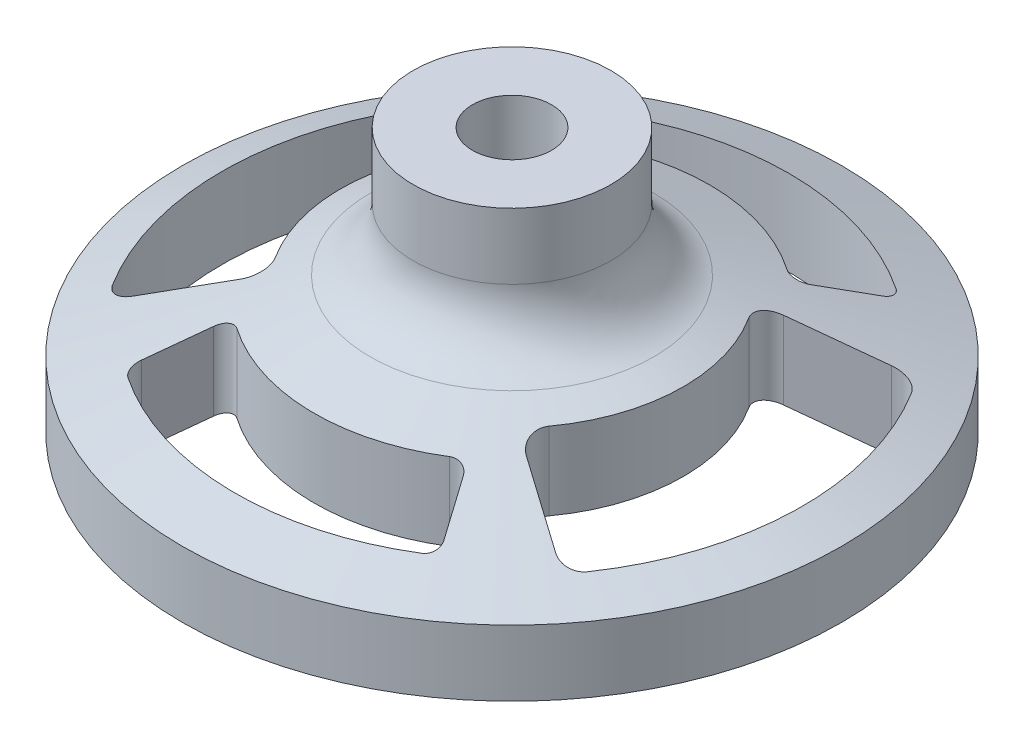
ISO-10303-21;
HEADER;
FILE_DESCRIPTION(('STEP AP214'),'2;1');
FILE_NAME('part.step','',(''),(''),'','','');
FILE_SCHEMA(('AUTOMOTIVE_DESIGN { 1 0 10303 214 1 1 1 1 }'));
ENDSEC;
DATA;
#1=APPLICATION_CONTEXT('core data for automotive mechanical design processes');
#2=APPLICATION_PROTOCOL_DEFINITION('international standard','automotive_design',2000,#1);
#3=PRODUCT_CONTEXT('',#1,'mechanical');
#4=PRODUCT('Part','Part','',(#3));
#5=PRODUCT_RELATED_PRODUCT_CATEGORY('part','',(#4));
#6=PRODUCT_DEFINITION_FORMATION('','',#4);
#7=PRODUCT_DEFINITION_CONTEXT('part definition',#1,'design');
#8=PRODUCT_DEFINITION('design','',#6,#7);
#9=PRODUCT_DEFINITION_SHAPE('','',#8);
#10=(LENGTH_UNIT() NAMED_UNIT(*) SI_UNIT(.MILLI.,.METRE.));
#11=(NAMED_UNIT(*) PLANE_ANGLE_UNIT() SI_UNIT($,.RADIAN.));
#12=(NAMED_UNIT(*) SI_UNIT($,.STERADIAN.) SOLID_ANGLE_UNIT());
#13=UNCERTAINTY_MEASURE_WITH_UNIT(LENGTH_MEASURE(1.E-05),#10,'distance_accuracy_value','');
#14=(GEOMETRIC_REPRESENTATION_CONTEXT(3) GLOBAL_UNCERTAINTY_ASSIGNED_CONTEXT((#13)) GLOBAL_UNIT_ASSIGNED_CONTEXT((#10,
#11,#12)) REPRESENTATION_CONTEXT('',''));
#15=CARTESIAN_POINT('',(0.,0.,0.));
#16=DIRECTION('',(0.,0.,1.));
#17=DIRECTION('',(1.,0.,0.));
#18=AXIS2_PLACEMENT_3D('',#15,#16,#17);
#19=CARTESIAN_POINT('',(0.,9.00000000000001,0.));
#20=DIRECTION('',(0.,-1.,0.));
#21=DIRECTION('',(0.,0.,-1.));
#22=AXIS2_PLACEMENT_3D('',#19,#20,#21);
#23=TOROIDAL_SURFACE('',#22,199.,1.00000000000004);
#24=CARTESIAN_POINT('',(-155.852714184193,8.84741494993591,-125.320579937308));
#25=CARTESIAN_POINT('',(-155.856435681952,8.87492026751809,-125.322728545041));
#26=CARTESIAN_POINT('',(-155.859149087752,8.90259403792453,-125.32429513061));
#27=CARTESIAN_POINT('',(-155.862546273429,8.95810564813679,-125.326256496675));
#28=CARTESIAN_POINT('',(-155.863230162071,8.98594347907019,-125.326651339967));
#29=CARTESIAN_POINT('',(-155.862219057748,9.06934692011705,-125.326067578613));
#30=CARTESIAN_POINT('',(-155.857474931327,9.12490389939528,-125.323328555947));
#31=CARTESIAN_POINT('',(-155.83997629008,9.23430418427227,-125.313225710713));
#32=CARTESIAN_POINT('',(-155.827218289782,9.28814673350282,-125.305859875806));
#33=CARTESIAN_POINT('',(-155.794079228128,9.39260403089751,-125.28672702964));
#34=CARTESIAN_POINT('',(-155.773699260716,9.44321924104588,-125.274960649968));
#35=CARTESIAN_POINT('',(-155.725850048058,9.5399603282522,-125.24733489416));
#36=CARTESIAN_POINT('',(-155.698359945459,9.58607243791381,-125.231463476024));
#37=CARTESIAN_POINT('',(-155.637122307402,9.67238469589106,-125.196107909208));
#38=CARTESIAN_POINT('',(-155.6033737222,9.71258385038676,-125.176623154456));
#39=CARTESIAN_POINT('',(-155.53023609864,9.78634311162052,-125.134397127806));
#40=CARTESIAN_POINT('',(-155.490795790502,9.81983543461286,-125.111626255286));
#41=CARTESIAN_POINT('',(-155.407652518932,9.87880160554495,-125.063623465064));
#42=CARTESIAN_POINT('',(-155.363949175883,9.90427473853,-125.038391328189));
#43=CARTESIAN_POINT('',(-155.270014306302,9.94816590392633,-124.98415800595));
#44=CARTESIAN_POINT('',(-155.219539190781,9.96589169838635,-124.955016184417));
#45=CARTESIAN_POINT('',(-155.11663243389,9.99074878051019,-124.895602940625));
#46=CARTESIAN_POINT('',(-155.06419947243,9.99787278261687,-124.865330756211));
#47=CARTESIAN_POINT('',(-154.961843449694,10.001218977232,-124.806235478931));
#48=CARTESIAN_POINT('',(-154.911932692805,9.9979923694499,-124.777419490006));
#49=CARTESIAN_POINT('',(-154.81338304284,9.98191682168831,-124.720521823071));
#50=CARTESIAN_POINT('',(-154.76474096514,9.96909499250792,-124.692438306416));
#51=CARTESIAN_POINT('',(-154.705103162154,9.94714685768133,-124.658006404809));
#52=CARTESIAN_POINT('',(-154.692848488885,9.94229060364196,-124.650931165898));
#53=CARTESIAN_POINT('',(-154.6345440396,9.91751195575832,-124.617269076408));
#54=CARTESIAN_POINT('',(-154.589746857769,9.89340855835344,-124.591405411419));
#55=CARTESIAN_POINT('',(-154.504199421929,9.83684145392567,-124.542014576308));
#56=CARTESIAN_POINT('',(-154.463459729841,9.80435667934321,-124.518493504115));
#57=CARTESIAN_POINT('',(-154.387315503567,9.73194107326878,-124.474531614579));
#58=CARTESIAN_POINT('',(-154.351907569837,9.69201502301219,-124.454088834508));
#59=CARTESIAN_POINT('',(-154.287476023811,9.60582647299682,-124.416889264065));
#60=CARTESIAN_POINT('',(-154.258449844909,9.5595665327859,-124.400130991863));
#61=CARTESIAN_POINT('',(-154.207844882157,9.46240147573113,-124.370914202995));
#62=CARTESIAN_POINT('',(-154.186209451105,9.41153565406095,-124.358422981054));
#63=CARTESIAN_POINT('',(-154.150751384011,9.30632288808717,-124.337951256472));
#64=CARTESIAN_POINT('',(-154.136921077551,9.25197942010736,-124.329966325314));
#65=CARTESIAN_POINT('',(-154.12149782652,9.16431411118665,-124.32106170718));
#66=CARTESIAN_POINT('',(-154.117209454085,9.13159206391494,-124.3185858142));
#67=CARTESIAN_POINT('',(-154.111495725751,9.06584622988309,-124.315286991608));
#68=CARTESIAN_POINT('',(-154.110067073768,9.03282283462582,-124.314462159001));
#69=CARTESIAN_POINT('',(-154.110074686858,8.96726849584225,-124.314466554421));
#70=CARTESIAN_POINT('',(-154.111468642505,8.93473753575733,-124.315271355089));
#71=CARTESIAN_POINT('',(-154.114258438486,8.9023696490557,-124.31688204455));
#72=B_SPLINE_CURVE_WITH_KNOTS('',3,(#24,#25,#26,#27,#28,#29,#30,#31,#32,#33,#34,#35,#36,#37,#38,
#39,#40,#41,#42,#43,#44,#45,#46,#47,#48,#49,#50,#51,#52,#53,#54,#55,#56,#57,#58,#59,#60,#61,#62,
#63,#64,#65,#66,#67,#68,#69,#70,#71),.UNSPECIFIED.,.F.,.F.,(4,2,2,2,2,2,2,2,2,2,2,2,2,2,2,2,2,2,
2,2,2,2,2,4),(0.,0.0834657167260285,0.166926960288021,0.333545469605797,0.500236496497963,
0.666903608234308,0.834065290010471,1.0012550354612,1.17005756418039,1.33887513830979,
1.52066035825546,1.70257044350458,1.87495729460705,2.04685890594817,2.0917390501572,
2.26202827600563,2.43274978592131,2.60336197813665,2.7739054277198,2.94311074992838,
3.11214949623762,3.21128741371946,3.31031099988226,3.40786126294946),.UNSPECIFIED.);
#73=CARTESIAN_POINT('',(-155.862975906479,9.00000000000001,-125.326504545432));
#74=VERTEX_POINT('',#73);
#75=CARTESIAN_POINT('',(-155.292923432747,9.93692225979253,-124.997384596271));
#76=VERTEX_POINT('',#75);
#77=EDGE_CURVE('E392',#74,#76,#72,.T.);
#78=ORIENTED_EDGE('',*,*,#77,.F.);
#79=CARTESIAN_POINT('',(0.,9.00000000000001,0.));
#80=DIRECTION('',(0.,-1.,0.));
#81=DIRECTION('',(0.,0.,-1.));
#82=AXIS2_PLACEMENT_3D('',#79,#80,#81);
#83=CIRCLE('',#82,200.);
#84=CARTESIAN_POINT('',(-113.367081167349,9.00000000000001,-164.766212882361));
#85=VERTEX_POINT('',#84);
#86=EDGE_CURVE('E1048',#74,#85,#83,.T.);
#87=ORIENTED_EDGE('',*,*,#86,.T.);
#88=CARTESIAN_POINT('',(-113.040558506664,9.93712225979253,-164.200659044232));
#89=CARTESIAN_POINT('',(-113.053785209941,9.92730125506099,-164.223568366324));
#90=CARTESIAN_POINT('',(-113.066798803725,9.91637071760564,-164.246108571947));
#91=CARTESIAN_POINT('',(-113.092320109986,9.89236100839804,-164.290312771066));
#92=CARTESIAN_POINT('',(-113.104827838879,9.87928190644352,-164.311976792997));
#93=CARTESIAN_POINT('',(-113.141438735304,9.8369671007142,-164.375388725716));
#94=CARTESIAN_POINT('',(-113.164668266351,9.80462512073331,-164.415623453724));
#95=CARTESIAN_POINT('',(-113.208079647,9.73259669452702,-164.490814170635));
#96=CARTESIAN_POINT('',(-113.228260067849,9.69290682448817,-164.525767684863));
#97=CARTESIAN_POINT('',(-113.264994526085,9.60730014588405,-164.589393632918));
#98=CARTESIAN_POINT('',(-113.281549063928,9.56138419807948,-164.618066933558));
#99=CARTESIAN_POINT('',(-113.310524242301,9.46472784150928,-164.668253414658));
#100=CARTESIAN_POINT('',(-113.322952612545,9.41399668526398,-164.689779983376));
#101=CARTESIAN_POINT('',(-113.343355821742,9.30907545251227,-164.725119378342));
#102=CARTESIAN_POINT('',(-113.351332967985,9.25488718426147,-164.738936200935));
#103=CARTESIAN_POINT('',(-113.36033644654,9.16686940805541,-164.754530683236));
#104=CARTESIAN_POINT('',(-113.362868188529,9.13362674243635,-164.758915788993));
#105=CARTESIAN_POINT('',(-113.36624126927,9.06686080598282,-164.764758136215));
#106=CARTESIAN_POINT('',(-113.367085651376,9.03333815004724,-164.766220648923));
#107=CARTESIAN_POINT('',(-113.367081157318,8.99980000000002,-164.766212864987));
#108=B_SPLINE_CURVE_WITH_KNOTS('',3,(#88,#89,#90,#91,#92,#93,#94,#95,#96,#97,#98,#99,#100,#101,
#102,#103,#104,#105,#106,#107),.UNSPECIFIED.,.F.,.F.,(4,2,2,2,2,2,2,2,2,4),(0.,
0.0846011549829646,0.169199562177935,0.338152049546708,0.507183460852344,0.676191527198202,
0.844881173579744,1.01348329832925,1.11420563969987,1.21474615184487),.UNSPECIFIED.);
#109=CARTESIAN_POINT('',(-113.040827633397,9.93692225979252,-164.201125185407));
#110=VERTEX_POINT('',#109);
#111=EDGE_CURVE('E1236',#110,#85,#108,.T.);
#112=ORIENTED_EDGE('',*,*,#111,.F.);
#113=CARTESIAN_POINT('',(0.,9.93692225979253,0.));
#114=DIRECTION('',(0.,-1.,0.));
#115=DIRECTION('',(0.,0.,-1.));
#116=AXIS2_PLACEMENT_3D('',#113,#114,#115);
#117=CIRCLE('',#116,199.349537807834);
#118=EDGE_CURVE('E1009',#76,#110,#117,.T.);
#119=ORIENTED_EDGE('',*,*,#118,.F.);
#120=EDGE_LOOP('',(#78,#87,#112,#119));
#121=FACE_BOUND('',#120,.T.);
#122=ADVANCED_FACE('F36',(#121),#23,.F.);
#123=CARTESIAN_POINT('',(0.,0.,0.));
#124=DIRECTION('',(0.,-1.,0.));
#125=DIRECTION('',(0.,0.,-1.));
#126=AXIS2_PLACEMENT_3D('',#123,#124,#125);
#127=CYLINDRICAL_SURFACE('',#126,200.);
#128=DIRECTION('',(0.,-1.,0.));
#129=VECTOR('',#128,1.);
#130=CARTESIAN_POINT('',(-155.862975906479,0.,-125.326504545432));
#131=LINE('',#130,#129);
#132=CARTESIAN_POINT('',(-155.862975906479,0.,-125.326504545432));
#133=VERTEX_POINT('',#132);
#134=EDGE_CURVE('E1432',#133,#74,#131,.F.);
#135=ORIENTED_EDGE('',*,*,#134,.F.);
#136=CARTESIAN_POINT('',(0.,0.,0.));
#137=DIRECTION('',(0.,-1.,0.));
#138=DIRECTION('',(0.,0.,-1.));
#139=AXIS2_PLACEMENT_3D('',#136,#137,#138);
#140=CIRCLE('',#139,200.);
#141=CARTESIAN_POINT('',(-113.367081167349,0.,-164.766212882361));
#142=VERTEX_POINT('',#141);
#143=EDGE_CURVE('E1044',#133,#142,#140,.T.);
#144=ORIENTED_EDGE('',*,*,#143,.T.);
#145=DIRECTION('',(0.,-1.,0.));
#146=VECTOR('',#145,1.);
#147=CARTESIAN_POINT('',(-113.367081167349,0.,-164.766212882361));
#148=LINE('',#147,#146);
#149=EDGE_CURVE('E1242',#85,#142,#148,.T.);
#150=ORIENTED_EDGE('',*,*,#149,.F.);
#151=ORIENTED_EDGE('',*,*,#86,.F.);
#152=EDGE_LOOP('',(#135,#144,#150,#151));
#153=FACE_BOUND('',#152,.T.);
#154=ADVANCED_FACE('F910',(#153),#127,.F.);
#155=CARTESIAN_POINT('',(155.852714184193,8.84741494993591,125.320579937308));
#156=CARTESIAN_POINT('',(155.856435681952,8.87492026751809,125.322728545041));
#157=CARTESIAN_POINT('',(155.859149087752,8.90259403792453,125.32429513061));
#158=CARTESIAN_POINT('',(155.862546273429,8.95810564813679,125.326256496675));
#159=CARTESIAN_POINT('',(155.863230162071,8.98594347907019,125.326651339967));
#160=CARTESIAN_POINT('',(155.862219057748,9.06934692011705,125.326067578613));
#161=CARTESIAN_POINT('',(155.857474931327,9.12490389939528,125.323328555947));
#162=CARTESIAN_POINT('',(155.83997629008,9.23430418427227,125.313225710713));
#163=CARTESIAN_POINT('',(155.827218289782,9.28814673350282,125.305859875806));
#164=CARTESIAN_POINT('',(155.794079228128,9.39260403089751,125.28672702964));
#165=CARTESIAN_POINT('',(155.773699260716,9.44321924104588,125.274960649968));
#166=CARTESIAN_POINT('',(155.725850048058,9.5399603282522,125.24733489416));
#167=CARTESIAN_POINT('',(155.698359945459,9.58607243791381,125.231463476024));
#168=CARTESIAN_POINT('',(155.637122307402,9.67238469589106,125.196107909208));
#169=CARTESIAN_POINT('',(155.6033737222,9.71258385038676,125.176623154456));
#170=CARTESIAN_POINT('',(155.53023609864,9.78634311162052,125.134397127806));
#171=CARTESIAN_POINT('',(155.490795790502,9.81983543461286,125.111626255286));
#172=CARTESIAN_POINT('',(155.407652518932,9.87880160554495,125.063623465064));
#173=CARTESIAN_POINT('',(155.363949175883,9.90427473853,125.038391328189));
#174=CARTESIAN_POINT('',(155.270014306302,9.94816590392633,124.98415800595));
#175=CARTESIAN_POINT('',(155.219539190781,9.96589169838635,124.955016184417));
#176=CARTESIAN_POINT('',(155.11663243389,9.99074878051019,124.895602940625));
#177=CARTESIAN_POINT('',(155.06419947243,9.99787278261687,124.865330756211));
#178=CARTESIAN_POINT('',(154.961843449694,10.001218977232,124.806235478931));
#179=CARTESIAN_POINT('',(154.911932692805,9.9979923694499,124.777419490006));
#180=CARTESIAN_POINT('',(154.81338304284,9.98191682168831,124.720521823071));
#181=CARTESIAN_POINT('',(154.76474096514,9.96909499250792,124.692438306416));
#182=CARTESIAN_POINT('',(154.705103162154,9.94714685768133,124.658006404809));
#183=CARTESIAN_POINT('',(154.692848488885,9.94229060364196,124.650931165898));
#184=CARTESIAN_POINT('',(154.6345440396,9.91751195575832,124.617269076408));
#185=CARTESIAN_POINT('',(154.589746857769,9.89340855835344,124.591405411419));
#186=CARTESIAN_POINT('',(154.504199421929,9.83684145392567,124.542014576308));
#187=CARTESIAN_POINT('',(154.463459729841,9.80435667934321,124.518493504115));
#188=CARTESIAN_POINT('',(154.387315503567,9.73194107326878,124.474531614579));
#189=CARTESIAN_POINT('',(154.351907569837,9.69201502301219,124.454088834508));
#190=CARTESIAN_POINT('',(154.287476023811,9.60582647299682,124.416889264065));
#191=CARTESIAN_POINT('',(154.258449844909,9.5595665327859,124.400130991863));
#192=CARTESIAN_POINT('',(154.207844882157,9.46240147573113,124.370914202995));
#193=CARTESIAN_POINT('',(154.186209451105,9.41153565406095,124.358422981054));
#194=CARTESIAN_POINT('',(154.150751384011,9.30632288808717,124.337951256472));
#195=CARTESIAN_POINT('',(154.136921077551,9.25197942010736,124.329966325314));
#196=CARTESIAN_POINT('',(154.12149782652,9.16431411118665,124.32106170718));
#197=CARTESIAN_POINT('',(154.117209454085,9.13159206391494,124.3185858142));
#198=CARTESIAN_POINT('',(154.111495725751,9.06584622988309,124.315286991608));
#199=CARTESIAN_POINT('',(154.110067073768,9.03282283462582,124.314462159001));
#200=CARTESIAN_POINT('',(154.110074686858,8.96726849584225,124.314466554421));
#201=CARTESIAN_POINT('',(154.111468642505,8.93473753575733,124.315271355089));
#202=CARTESIAN_POINT('',(154.114258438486,8.9023696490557,124.31688204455));
#203=B_SPLINE_CURVE_WITH_KNOTS('',3,(#155,#156,#157,#158,#159,#160,#161,#162,#163,#164,#165,
#166,#167,#168,#169,#170,#171,#172,#173,#174,#175,#176,#177,#178,#179,#180,#181,#182,#183,#184,
#185,#186,#187,#188,#189,#190,#191,#192,#193,#194,#195,#196,#197,#198,#199,#200,#201,#202),
.UNSPECIFIED.,.F.,.F.,(4,2,2,2,2,2,2,2,2,2,2,2,2,2,2,2,2,2,2,2,2,2,2,4),(0.,0.0834657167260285,
0.166926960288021,0.333545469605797,0.500236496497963,0.666903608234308,0.834065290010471,
1.0012550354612,1.17005756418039,1.33887513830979,1.52066035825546,1.70257044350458,
1.87495729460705,2.04685890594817,2.0917390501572,2.26202827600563,2.43274978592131,
2.60336197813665,2.7739054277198,2.94311074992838,3.11214949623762,3.21128741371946,
3.31031099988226,3.40786126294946),.UNSPECIFIED.);
#204=CARTESIAN_POINT('',(155.862975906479,9.00000000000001,125.326504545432));
#205=VERTEX_POINT('',#204);
#206=CARTESIAN_POINT('',(155.292923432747,9.93692225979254,124.997384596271));
#207=VERTEX_POINT('',#206);
#208=EDGE_CURVE('E1058',#205,#207,#203,.T.);
#209=ORIENTED_EDGE('',*,*,#208,.F.);
#210=CARTESIAN_POINT('',(113.367081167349,9.00000000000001,164.766212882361));
#211=VERTEX_POINT('',#210);
#212=EDGE_CURVE('E1043',#205,#211,#83,.T.);
#213=ORIENTED_EDGE('',*,*,#212,.T.);
#214=CARTESIAN_POINT('',(113.040558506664,9.93712225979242,164.200659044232));
#215=CARTESIAN_POINT('',(113.053785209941,9.92730125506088,164.223568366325));
#216=CARTESIAN_POINT('',(113.066798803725,9.91637071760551,164.246108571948));
#217=CARTESIAN_POINT('',(113.092320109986,9.89236100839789,164.290312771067));
#218=CARTESIAN_POINT('',(113.10482783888,9.87928190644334,164.311976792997));
#219=CARTESIAN_POINT('',(113.141438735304,9.83696710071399,164.375388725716));
#220=CARTESIAN_POINT('',(113.164668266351,9.8046251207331,164.415623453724));
#221=CARTESIAN_POINT('',(113.208079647,9.73259669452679,164.490814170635));
#222=CARTESIAN_POINT('',(113.228260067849,9.69290682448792,164.525767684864));
#223=CARTESIAN_POINT('',(113.264994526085,9.60730014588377,164.589393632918));
#224=CARTESIAN_POINT('',(113.281549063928,9.56138419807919,164.618066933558));
#225=CARTESIAN_POINT('',(113.310524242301,9.46472784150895,164.668253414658));
#226=CARTESIAN_POINT('',(113.322952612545,9.41399668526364,164.689779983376));
#227=CARTESIAN_POINT('',(113.343355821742,9.30907545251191,164.725119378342));
#228=CARTESIAN_POINT('',(113.351332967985,9.25488718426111,164.738936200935));
#229=CARTESIAN_POINT('',(113.36033644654,9.16686940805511,164.754530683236));
#230=CARTESIAN_POINT('',(113.362868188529,9.1336267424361,164.758915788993));
#231=CARTESIAN_POINT('',(113.36624126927,9.0668608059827,164.764758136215));
#232=CARTESIAN_POINT('',(113.367085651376,9.03333815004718,164.766220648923));
#233=CARTESIAN_POINT('',(113.367081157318,8.99980000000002,164.766212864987));
#234=B_SPLINE_CURVE_WITH_KNOTS('',3,(#214,#215,#216,#217,#218,#219,#220,#221,#222,#223,#224,
#225,#226,#227,#228,#229,#230,#231,#232,#233),.UNSPECIFIED.,.F.,.F.,(4,2,2,2,2,2,2,2,2,4),(0.,
0.0846011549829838,0.169199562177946,0.338152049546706,0.507183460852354,0.676191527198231,
0.844881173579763,1.01348329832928,1.11420563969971,1.21474615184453),.UNSPECIFIED.);
#235=CARTESIAN_POINT('',(113.040827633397,9.93692225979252,164.201125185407));
#236=VERTEX_POINT('',#235);
#237=EDGE_CURVE('E1057',#236,#211,#234,.T.);
#238=ORIENTED_EDGE('',*,*,#237,.F.);
#239=EDGE_CURVE('E1010',#207,#236,#117,.T.);
#240=ORIENTED_EDGE('',*,*,#239,.F.);
#241=EDGE_LOOP('',(#209,#213,#238,#240));
#242=FACE_BOUND('',#241,.T.);
#243=ADVANCED_FACE('F928',(#242),#23,.F.);
#244=DIRECTION('',(0.,-1.,0.));
#245=VECTOR('',#244,1.);
#246=CARTESIAN_POINT('',(155.862975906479,0.,125.326504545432));
#247=LINE('',#246,#245);
#248=CARTESIAN_POINT('',(155.862975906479,0.,125.326504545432));
#249=VERTEX_POINT('',#248);
#250=EDGE_CURVE('E1389',#249,#205,#247,.F.);
#251=ORIENTED_EDGE('',*,*,#250,.F.);
#252=CARTESIAN_POINT('',(113.367081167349,0.,164.766212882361));
#253=VERTEX_POINT('',#252);
#254=EDGE_CURVE('E1041',#249,#253,#140,.T.);
#255=ORIENTED_EDGE('',*,*,#254,.T.);
#256=DIRECTION('',(0.,-1.,0.));
#257=VECTOR('',#256,1.);
#258=CARTESIAN_POINT('',(113.367081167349,0.,164.766212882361));
#259=LINE('',#258,#257);
#260=EDGE_CURVE('E1063',#211,#253,#259,.T.);
#261=ORIENTED_EDGE('',*,*,#260,.F.);
#262=ORIENTED_EDGE('',*,*,#212,.F.);
#263=EDGE_LOOP('',(#251,#255,#261,#262));
#264=FACE_BOUND('',#263,.T.);
#265=ADVANCED_FACE('F930',(#264),#127,.F.);
#266=CARTESIAN_POINT('',(160.893257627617,9.93712225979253,-117.700399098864));
#267=CARTESIAN_POINT('',(160.916233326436,9.92729924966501,-117.713664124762));
#268=CARTESIAN_POINT('',(160.938840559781,9.91636555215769,-117.726716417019));
#269=CARTESIAN_POINT('',(160.983179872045,9.89234570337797,-117.75231573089));
#270=CARTESIAN_POINT('',(161.0049119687,9.87925959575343,-117.764862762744));
#271=CARTESIAN_POINT('',(161.068532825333,9.83691316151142,-117.801594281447));
#272=CARTESIAN_POINT('',(161.10890834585,9.80453807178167,-117.824905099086));
#273=CARTESIAN_POINT('',(161.184372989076,9.73240984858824,-117.868474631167));
#274=CARTESIAN_POINT('',(161.219459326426,9.69265285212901,-117.888731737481));
#275=CARTESIAN_POINT('',(161.283324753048,9.60687639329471,-117.925604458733));
#276=CARTESIAN_POINT('',(161.312104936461,9.56085801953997,-117.942220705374));
#277=CARTESIAN_POINT('',(161.362416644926,9.46405463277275,-117.9712681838));
#278=CARTESIAN_POINT('',(161.383975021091,9.41328819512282,-117.983714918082));
#279=CARTESIAN_POINT('',(161.419352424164,9.30828392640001,-118.004140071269));
#280=CARTESIAN_POINT('',(161.433175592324,9.25404797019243,-118.012120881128));
#281=CARTESIAN_POINT('',(161.448722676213,9.16612555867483,-118.021096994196));
#282=CARTESIAN_POINT('',(161.453080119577,9.1330303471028,-118.023612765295));
#283=CARTESIAN_POINT('',(161.458885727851,9.06656155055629,-118.026964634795));
#284=CARTESIAN_POINT('',(161.460339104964,9.03318857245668,-118.027803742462));
#285=CARTESIAN_POINT('',(161.460331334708,8.99980000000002,-118.027799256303));
#286=B_SPLINE_CURVE_WITH_KNOTS('',3,(#266,#267,#268,#269,#270,#271,#272,#273,#274,#275,#276,
#277,#278,#279,#280,#281,#282,#283,#284,#285),.UNSPECIFIED.,.F.,.F.,(4,2,2,2,2,2,2,2,2,4),(0.,
0.084818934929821,0.169636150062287,0.33904368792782,0.508540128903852,0.678007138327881,
0.846836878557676,1.01557614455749,1.11584821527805,1.21594015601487),.UNSPECIFIED.);
#287=CARTESIAN_POINT('',(160.893725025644,9.93692225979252,-117.70066895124));
#288=VERTEX_POINT('',#287);
#289=CARTESIAN_POINT('',(161.46033135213,9.00000000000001,-118.027799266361));
#290=VERTEX_POINT('',#289);
#291=EDGE_CURVE('E995',#288,#290,#286,.T.);
#292=ORIENTED_EDGE('',*,*,#291,.F.);
#293=CARTESIAN_POINT('',(118.665943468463,9.93692225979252,-160.183120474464));
#294=VERTEX_POINT('',#293);
#295=EDGE_CURVE('E998',#294,#288,#117,.T.);
#296=ORIENTED_EDGE('',*,*,#295,.F.);
#297=CARTESIAN_POINT('',(118.99329233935,8.99980000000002,-160.750105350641));
#298=CARTESIAN_POINT('',(118.993295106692,9.02780132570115,-160.750110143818));
#299=CARTESIAN_POINT('',(118.992705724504,9.0557894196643,-160.749089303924));
#300=CARTESIAN_POINT('',(118.990349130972,9.11156484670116,-160.745007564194));
#301=CARTESIAN_POINT('',(118.988581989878,9.13935219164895,-160.741946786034));
#302=CARTESIAN_POINT('',(118.981531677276,9.22206108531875,-160.729735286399));
#303=CARTESIAN_POINT('',(118.97449957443,9.27642769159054,-160.717555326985));
#304=CARTESIAN_POINT('',(118.955975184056,9.38201957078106,-160.685470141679));
#305=CARTESIAN_POINT('',(118.944481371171,9.43324376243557,-160.665562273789));
#306=CARTESIAN_POINT('',(118.917368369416,9.53112455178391,-160.618601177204));
#307=CARTESIAN_POINT('',(118.901749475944,9.57778147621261,-160.591548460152));
#308=CARTESIAN_POINT('',(118.86678658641,9.66535770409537,-160.530990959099));
#309=CARTESIAN_POINT('',(118.847431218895,9.70625881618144,-160.497466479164));
#310=CARTESIAN_POINT('',(118.805578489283,9.78102232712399,-160.42497542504));
#311=CARTESIAN_POINT('',(118.78308234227,9.81488743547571,-160.386010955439));
#312=CARTESIAN_POINT('',(118.744577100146,9.86336111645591,-160.319317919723));
#313=CARTESIAN_POINT('',(118.729322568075,9.88041449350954,-160.292896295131));
#314=CARTESIAN_POINT('',(118.698042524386,9.91124587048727,-160.238717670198));
#315=CARTESIAN_POINT('',(118.682018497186,9.92502989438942,-160.210963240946));
#316=CARTESIAN_POINT('',(118.665673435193,9.93712225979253,-160.182652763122));
#317=B_SPLINE_CURVE_WITH_KNOTS('',3,(#297,#298,#299,#300,#301,#302,#303,#304,#305,#306,#307,
#308,#309,#310,#311,#312,#313,#314,#315,#316),.UNSPECIFIED.,.F.,.F.,(4,2,2,2,2,2,2,2,2,4),(0.,
0.0839522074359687,0.167899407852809,0.335502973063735,0.503163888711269,0.670812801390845,
0.838980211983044,1.00708274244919,1.11176528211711,1.21625341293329),.UNSPECIFIED.);
#318=CARTESIAN_POINT('',(118.993292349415,9.00000000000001,-160.750105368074));
#319=VERTEX_POINT('',#318);
#320=EDGE_CURVE('E1268',#319,#294,#317,.T.);
#321=ORIENTED_EDGE('',*,*,#320,.F.);
#322=EDGE_CURVE('E1000',#319,#290,#83,.T.);
#323=ORIENTED_EDGE('',*,*,#322,.T.);
#324=EDGE_LOOP('',(#292,#296,#321,#323));
#325=FACE_BOUND('',#324,.T.);
#326=ADVANCED_FACE('F920',(#325),#23,.F.);
#327=DIRECTION('',(0.,-1.,0.));
#328=VECTOR('',#327,1.);
#329=CARTESIAN_POINT('',(161.46033135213,0.,-118.027799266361));
#330=LINE('',#329,#328);
#331=CARTESIAN_POINT('',(161.46033135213,0.,-118.027799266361));
#332=VERTEX_POINT('',#331);
#333=EDGE_CURVE('E1002',#290,#332,#330,.T.);
#334=ORIENTED_EDGE('',*,*,#333,.F.);
#335=ORIENTED_EDGE('',*,*,#322,.F.);
#336=DIRECTION('',(0.,-1.,0.));
#337=VECTOR('',#336,1.);
#338=CARTESIAN_POINT('',(118.993292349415,0.,-160.750105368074));
#339=LINE('',#338,#337);
#340=CARTESIAN_POINT('',(118.993292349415,0.,-160.750105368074));
#341=VERTEX_POINT('',#340);
#342=EDGE_CURVE('E1274',#341,#319,#339,.F.);
#343=ORIENTED_EDGE('',*,*,#342,.F.);
#344=EDGE_CURVE('E1045',#341,#332,#140,.T.);
#345=ORIENTED_EDGE('',*,*,#344,.T.);
#346=EDGE_LOOP('',(#334,#335,#343,#345));
#347=FACE_BOUND('',#346,.T.);
#348=ADVANCED_FACE('F911',(#347),#127,.F.);
#349=CARTESIAN_POINT('',(-160.893257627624,9.93712225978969,117.700399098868));
#350=CARTESIAN_POINT('',(-160.916233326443,9.92729924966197,117.713664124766));
#351=CARTESIAN_POINT('',(-160.938840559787,9.91636555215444,117.726716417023));
#352=CARTESIAN_POINT('',(-160.983179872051,9.8923457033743,117.752315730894));
#353=CARTESIAN_POINT('',(-161.004911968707,9.87925959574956,117.764862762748));
#354=CARTESIAN_POINT('',(-161.068532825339,9.83691316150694,117.801594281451));
#355=CARTESIAN_POINT('',(-161.108908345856,9.80453807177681,117.82490509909));
#356=CARTESIAN_POINT('',(-161.184372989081,9.7324098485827,117.86847463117));
#357=CARTESIAN_POINT('',(-161.219459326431,9.69265285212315,117.888731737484));
#358=CARTESIAN_POINT('',(-161.283324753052,9.60687639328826,117.925604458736));
#359=CARTESIAN_POINT('',(-161.312104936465,9.56085801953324,117.942220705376));
#360=CARTESIAN_POINT('',(-161.36241664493,9.46405463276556,117.971268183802));
#361=CARTESIAN_POINT('',(-161.383975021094,9.41328819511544,117.983714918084));
#362=CARTESIAN_POINT('',(-161.419352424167,9.30828392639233,118.004140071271));
#363=CARTESIAN_POINT('',(-161.433175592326,9.25404797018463,118.012120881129));
#364=CARTESIAN_POINT('',(-161.448722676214,9.16612555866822,118.021096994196));
#365=CARTESIAN_POINT('',(-161.453080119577,9.13303034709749,118.023612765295));
#366=CARTESIAN_POINT('',(-161.458885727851,9.06656155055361,118.026964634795));
#367=CARTESIAN_POINT('',(-161.460339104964,9.03318857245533,118.027803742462));
#368=CARTESIAN_POINT('',(-161.460331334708,8.99980000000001,118.027799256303));
#369=B_SPLINE_CURVE_WITH_KNOTS('',3,(#349,#350,#351,#352,#353,#354,#355,#356,#357,#358,#359,
#360,#361,#362,#363,#364,#365,#366,#367,#368),.UNSPECIFIED.,.F.,.F.,(4,2,2,2,2,2,2,2,2,4),(0.,
0.0848189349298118,0.169636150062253,0.339043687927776,0.50854012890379,0.678007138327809,
0.846836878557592,1.01557614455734,1.11584821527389,1.21594015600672),.UNSPECIFIED.);
#370=CARTESIAN_POINT('',(-160.893725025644,9.93692225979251,117.70066895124));
#371=VERTEX_POINT('',#370);
#372=CARTESIAN_POINT('',(-161.46033135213,9.00000000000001,118.027799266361));
#373=VERTEX_POINT('',#372);
#374=EDGE_CURVE('E360',#371,#373,#369,.T.);
#375=ORIENTED_EDGE('',*,*,#374,.F.);
#376=CARTESIAN_POINT('',(-118.665943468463,9.93692225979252,160.183120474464));
#377=VERTEX_POINT('',#376);
#378=EDGE_CURVE('E1012',#377,#371,#117,.T.);
#379=ORIENTED_EDGE('',*,*,#378,.F.);
#380=CARTESIAN_POINT('',(-118.99329233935,8.99980000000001,160.750105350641));
#381=CARTESIAN_POINT('',(-118.993295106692,9.02780132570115,160.750110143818));
#382=CARTESIAN_POINT('',(-118.992705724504,9.0557894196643,160.749089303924));
#383=CARTESIAN_POINT('',(-118.990349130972,9.11156484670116,160.745007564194));
#384=CARTESIAN_POINT('',(-118.988581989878,9.13935219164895,160.741946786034));
#385=CARTESIAN_POINT('',(-118.981531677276,9.22206108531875,160.729735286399));
#386=CARTESIAN_POINT('',(-118.97449957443,9.27642769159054,160.717555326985));
#387=CARTESIAN_POINT('',(-118.955975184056,9.38201957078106,160.685470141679));
#388=CARTESIAN_POINT('',(-118.944481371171,9.43324376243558,160.665562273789));
#389=CARTESIAN_POINT('',(-118.917368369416,9.53112455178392,160.618601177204));
#390=CARTESIAN_POINT('',(-118.901749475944,9.57778147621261,160.591548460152));
#391=CARTESIAN_POINT('',(-118.86678658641,9.66535770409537,160.530990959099));
#392=CARTESIAN_POINT('',(-118.847431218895,9.70625881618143,160.497466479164));
#393=CARTESIAN_POINT('',(-118.805578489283,9.78102232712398,160.42497542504));
#394=CARTESIAN_POINT('',(-118.78308234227,9.81488743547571,160.386010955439));
#395=CARTESIAN_POINT('',(-118.744577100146,9.86336111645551,160.319317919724));
#396=CARTESIAN_POINT('',(-118.729322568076,9.88041449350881,160.292896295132));
#397=CARTESIAN_POINT('',(-118.698042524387,9.91124587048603,160.2387176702));
#398=CARTESIAN_POINT('',(-118.682018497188,9.925029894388,160.210963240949));
#399=CARTESIAN_POINT('',(-118.665673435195,9.937122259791,160.182652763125));
#400=B_SPLINE_CURVE_WITH_KNOTS('',3,(#380,#381,#382,#383,#384,#385,#386,#387,#388,#389,#390,
#391,#392,#393,#394,#395,#396,#397,#398,#399),.UNSPECIFIED.,.F.,.F.,(4,2,2,2,2,2,2,2,2,4),(0.,
0.083952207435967,0.167899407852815,0.335502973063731,0.503163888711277,0.670812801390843,
0.83898021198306,1.00708274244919,1.11176528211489,1.21625341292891),.UNSPECIFIED.);
#401=CARTESIAN_POINT('',(-118.993292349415,9.00000000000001,160.750105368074));
#402=VERTEX_POINT('',#401);
#403=EDGE_CURVE('E1146',#402,#377,#400,.T.);
#404=ORIENTED_EDGE('',*,*,#403,.F.);
#405=EDGE_CURVE('E1046',#402,#373,#83,.T.);
#406=ORIENTED_EDGE('',*,*,#405,.T.);
#407=EDGE_LOOP('',(#375,#379,#404,#406));
#408=FACE_BOUND('',#407,.T.);
#409=ADVANCED_FACE('F38',(#408),#23,.F.);
#410=DIRECTION('',(0.,-1.,0.));
#411=VECTOR('',#410,1.);
#412=CARTESIAN_POINT('',(-161.46033135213,0.,118.027799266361));
#413=LINE('',#412,#411);
#414=CARTESIAN_POINT('',(-161.46033135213,0.,118.027799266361));
#415=VERTEX_POINT('',#414);
#416=EDGE_CURVE('E335',#373,#415,#413,.T.);
#417=ORIENTED_EDGE('',*,*,#416,.F.);
#418=ORIENTED_EDGE('',*,*,#405,.F.);
#419=DIRECTION('',(0.,-1.,0.));
#420=VECTOR('',#419,1.);
#421=CARTESIAN_POINT('',(-118.993292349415,0.,160.750105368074));
#422=LINE('',#421,#420);
#423=CARTESIAN_POINT('',(-118.993292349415,0.,160.750105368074));
#424=VERTEX_POINT('',#423);
#425=EDGE_CURVE('E1153',#424,#402,#422,.F.);
#426=ORIENTED_EDGE('',*,*,#425,.F.);
#427=EDGE_CURVE('E1042',#424,#415,#140,.T.);
#428=ORIENTED_EDGE('',*,*,#427,.T.);
#429=EDGE_LOOP('',(#417,#418,#426,#428));
#430=FACE_BOUND('',#429,.T.);
#431=ADVANCED_FACE('F902',(#430),#127,.F.);
#432=CARTESIAN_POINT('',(250.,0.,0.));
#433=DIRECTION('',(0.,-1.,0.));
#434=DIRECTION('',(0.,0.,-1.));
#435=AXIS2_PLACEMENT_3D('',#432,#433,#434);
#436=PLANE('',#435);
#437=DIRECTION('',(-0.866025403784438,0.,-0.500000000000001));
#438=VECTOR('',#437,1.);
#439=CARTESIAN_POINT('',(-109.542182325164,0.,-98.5831819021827));
#440=LINE('',#439,#438);
#441=CARTESIAN_POINT('',(-161.717904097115,0.,-128.706848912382));
#442=VERTEX_POINT('',#441);
#443=EDGE_CURVE('E339',#133,#442,#440,.T.);
#444=ORIENTED_EDGE('',*,*,#443,.T.);
#445=CARTESIAN_POINT('',(-169.217904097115,0.,-115.716467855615));
#446=DIRECTION('',(0.,1.,0.));
#447=DIRECTION('',(0.,0.,1.));
#448=AXIS2_PLACEMENT_3D('',#445,#446,#447);
#449=CIRCLE('',#448,15.);
#450=CARTESIAN_POINT('',(-181.599701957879,0.,-124.183526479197));
#451=VERTEX_POINT('',#450);
#452=EDGE_CURVE('E352',#442,#451,#449,.T.);
#453=ORIENTED_EDGE('',*,*,#452,.T.);
#454=CARTESIAN_POINT('',(0.,0.,0.));
#455=DIRECTION('',(0.,1.,0.));
#456=DIRECTION('',(0.,0.,-1.));
#457=AXIS2_PLACEMENT_3D('',#454,#455,#456);
#458=CIRCLE('',#457,220.);
#459=CARTESIAN_POINT('',(-186.950530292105,0.,115.971976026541));
#460=VERTEX_POINT('',#459);
#461=EDGE_CURVE('E329',#451,#460,#458,.T.);
#462=ORIENTED_EDGE('',*,*,#461,.T.);
#463=CARTESIAN_POINT('',(-174.203903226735,0.,108.064795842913));
#464=DIRECTION('',(0.,1.,0.));
#465=DIRECTION('',(0.,0.,-1.));
#466=AXIS2_PLACEMENT_3D('',#463,#464,#465);
#467=CIRCLE('',#466,15.);
#468=CARTESIAN_POINT('',(-166.703903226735,0.,121.05517689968));
#469=VERTEX_POINT('',#468);
#470=EDGE_CURVE('E324',#460,#469,#467,.T.);
#471=ORIENTED_EDGE('',*,*,#470,.T.);
#472=DIRECTION('',(0.866025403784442,0.,-0.499999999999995));
#473=VECTOR('',#472,1.);
#474=CARTESIAN_POINT('',(-166.703903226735,0.,121.05517689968));
#475=LINE('',#474,#473);
#476=EDGE_CURVE('E332',#469,#415,#475,.T.);
#477=ORIENTED_EDGE('',*,*,#476,.T.);
#478=ORIENTED_EDGE('',*,*,#427,.F.);
#479=DIRECTION('',(-0.499999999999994,0.,0.866025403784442));
#480=VECTOR('',#479,1.);
#481=CARTESIAN_POINT('',(-119.437073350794,0.,161.518756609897));
#482=LINE('',#481,#480);
#483=CARTESIAN_POINT('',(-119.437073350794,0.,161.518756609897));
#484=VERTEX_POINT('',#483);
#485=EDGE_CURVE('E1291',#424,#484,#482,.T.);
#486=ORIENTED_EDGE('',*,*,#485,.T.);
#487=CARTESIAN_POINT('',(-110.77681931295,0.,166.518756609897));
#488=DIRECTION('',(0.,1.,0.));
#489=DIRECTION('',(0.,0.,-1.));
#490=AXIS2_PLACEMENT_3D('',#487,#488,#489);
#491=CIRCLE('',#490,10.);
#492=CARTESIAN_POINT('',(-116.315660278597,0.,174.844694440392));
#493=VERTEX_POINT('',#492);
#494=EDGE_CURVE('E1171',#484,#493,#491,.T.);
#495=ORIENTED_EDGE('',*,*,#494,.T.);
#496=CARTESIAN_POINT('',(0.,0.,0.));
#497=DIRECTION('',(0.,1.,0.));
#498=DIRECTION('',(0.,0.,-1.));
#499=AXIS2_PLACEMENT_3D('',#496,#497,#498);
#500=CIRCLE('',#499,210.);
#501=CARTESIAN_POINT('',(110.226057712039,0.,178.746234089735));
#502=VERTEX_POINT('',#501);
#503=EDGE_CURVE('E1283',#493,#502,#500,.T.);
#504=ORIENTED_EDGE('',*,*,#503,.T.);
#505=CARTESIAN_POINT('',(104.97719782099,0.,170.23450865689));
#506=DIRECTION('',(0.,1.,0.));
#507=DIRECTION('',(0.,0.,1.));
#508=AXIS2_PLACEMENT_3D('',#505,#506,#507);
#509=CIRCLE('',#508,10.);
#510=CARTESIAN_POINT('',(113.637451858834,0.,165.23450865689));
#511=VERTEX_POINT('',#510);
#512=EDGE_CURVE('E1286',#502,#511,#509,.T.);
#513=ORIENTED_EDGE('',*,*,#512,.T.);
#514=DIRECTION('',(-0.499999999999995,0.,-0.866025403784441));
#515=VECTOR('',#514,1.);
#516=CARTESIAN_POINT('',(113.637451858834,0.,165.23450865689));
#517=LINE('',#516,#515);
#518=EDGE_CURVE('E1289',#511,#253,#517,.T.);
#519=ORIENTED_EDGE('',*,*,#518,.T.);
#520=ORIENTED_EDGE('',*,*,#254,.F.);
#521=DIRECTION('',(0.866025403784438,0.,0.500000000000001));
#522=VECTOR('',#521,1.);
#523=CARTESIAN_POINT('',(109.542182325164,0.,98.5831819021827));
#524=LINE('',#523,#522);
#525=CARTESIAN_POINT('',(161.717904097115,0.,128.706848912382));
#526=VERTEX_POINT('',#525);
#527=EDGE_CURVE('E1377',#249,#526,#524,.T.);
#528=ORIENTED_EDGE('',*,*,#527,.T.);
#529=CARTESIAN_POINT('',(169.217904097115,0.,115.716467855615));
#530=DIRECTION('',(0.,1.,0.));
#531=DIRECTION('',(0.,0.,-1.));
#532=AXIS2_PLACEMENT_3D('',#529,#530,#531);
#533=CIRCLE('',#532,15.);
#534=CARTESIAN_POINT('',(181.599701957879,0.,124.183526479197));
#535=VERTEX_POINT('',#534);
#536=EDGE_CURVE('E1372',#526,#535,#533,.T.);
#537=ORIENTED_EDGE('',*,*,#536,.T.);
#538=CARTESIAN_POINT('',(0.,0.,0.));
#539=DIRECTION('',(0.,1.,0.));
#540=DIRECTION('',(0.,0.,1.));
#541=AXIS2_PLACEMENT_3D('',#538,#539,#540);
#542=CIRCLE('',#541,220.);
#543=CARTESIAN_POINT('',(186.950530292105,0.,-115.971976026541));
#544=VERTEX_POINT('',#543);
#545=EDGE_CURVE('E1367',#535,#544,#542,.T.);
#546=ORIENTED_EDGE('',*,*,#545,.T.);
#547=CARTESIAN_POINT('',(174.203903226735,0.,-108.064795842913));
#548=DIRECTION('',(0.,1.,0.));
#549=DIRECTION('',(0.,0.,1.));
#550=AXIS2_PLACEMENT_3D('',#547,#548,#549);
#551=CIRCLE('',#550,15.);
#552=CARTESIAN_POINT('',(166.703903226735,0.,-121.05517689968));
#553=VERTEX_POINT('',#552);
#554=EDGE_CURVE('E1434',#544,#553,#551,.T.);
#555=ORIENTED_EDGE('',*,*,#554,.T.);
#556=DIRECTION('',(-0.866025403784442,0.,0.499999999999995));
#557=VECTOR('',#556,1.);
#558=CARTESIAN_POINT('',(166.703903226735,0.,-121.05517689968));
#559=LINE('',#558,#557);
#560=EDGE_CURVE('E1427',#553,#332,#559,.T.);
#561=ORIENTED_EDGE('',*,*,#560,.T.);
#562=ORIENTED_EDGE('',*,*,#344,.F.);
#563=DIRECTION('',(0.499999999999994,0.,-0.866025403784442));
#564=VECTOR('',#563,1.);
#565=CARTESIAN_POINT('',(119.437073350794,0.,-161.518756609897));
#566=LINE('',#565,#564);
#567=CARTESIAN_POINT('',(119.437073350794,0.,-161.518756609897));
#568=VERTEX_POINT('',#567);
#569=EDGE_CURVE('E1235',#341,#568,#566,.T.);
#570=ORIENTED_EDGE('',*,*,#569,.T.);
#571=CARTESIAN_POINT('',(110.77681931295,0.,-166.518756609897));
#572=DIRECTION('',(0.,1.,0.));
#573=DIRECTION('',(0.,0.,1.));
#574=AXIS2_PLACEMENT_3D('',#571,#572,#573);
#575=CIRCLE('',#574,10.);
#576=CARTESIAN_POINT('',(116.315660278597,0.,-174.844694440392));
#577=VERTEX_POINT('',#576);
#578=EDGE_CURVE('E1406',#568,#577,#575,.T.);
#579=ORIENTED_EDGE('',*,*,#578,.T.);
#580=CARTESIAN_POINT('',(0.,0.,0.));
#581=DIRECTION('',(0.,1.,0.));
#582=DIRECTION('',(0.,0.,1.));
#583=AXIS2_PLACEMENT_3D('',#580,#581,#582);
#584=CIRCLE('',#583,210.);
#585=CARTESIAN_POINT('',(-110.226057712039,0.,-178.746234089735));
#586=VERTEX_POINT('',#585);
#587=EDGE_CURVE('E1409',#577,#586,#584,.T.);
#588=ORIENTED_EDGE('',*,*,#587,.T.);
#589=CARTESIAN_POINT('',(-104.97719782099,0.,-170.23450865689));
#590=DIRECTION('',(0.,1.,0.));
#591=DIRECTION('',(0.,0.,-1.));
#592=AXIS2_PLACEMENT_3D('',#589,#590,#591);
#593=CIRCLE('',#592,10.);
#594=CARTESIAN_POINT('',(-113.637451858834,0.,-165.23450865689));
#595=VERTEX_POINT('',#594);
#596=EDGE_CURVE('E1412',#586,#595,#593,.T.);
#597=ORIENTED_EDGE('',*,*,#596,.T.);
#598=DIRECTION('',(0.499999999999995,0.,0.866025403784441));
#599=VECTOR('',#598,1.);
#600=CARTESIAN_POINT('',(-113.637451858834,0.,-165.23450865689));
#601=LINE('',#600,#599);
#602=EDGE_CURVE('E1225',#595,#142,#601,.T.);
#603=ORIENTED_EDGE('',*,*,#602,.T.);
#604=ORIENTED_EDGE('',*,*,#143,.F.);
#605=EDGE_LOOP('',(#444,#453,#462,#471,#477,#478,#486,#495,#504,#513,#519,#520,#528,#537,#546,
#555,#561,#562,#570,#579,#588,#597,#603,#604));
#606=FACE_BOUND('',#605,.T.);
#607=CARTESIAN_POINT('',(0.,0.,0.));
#608=DIRECTION('',(0.,-1.,0.));
#609=DIRECTION('',(0.,0.,-1.));
#610=AXIS2_PLACEMENT_3D('',#607,#608,#609);
#611=CIRCLE('',#610,250.);
#612=CARTESIAN_POINT('',(0.,0.,-250.));
#613=VERTEX_POINT('',#612);
#614=EDGE_CURVE('E1038',#613,#613,#611,.T.);
#615=ORIENTED_EDGE('',*,*,#614,.T.);
#616=EDGE_LOOP('',(#615));
#617=FACE_BOUND('',#616,.T.);
#618=ADVANCED_FACE('F342',(#606,#617),#436,.T.);
#619=CARTESIAN_POINT('',(0.,0.,0.));
#620=DIRECTION('',(0.,-1.,0.));
#621=DIRECTION('',(0.,0.,-1.));
#622=AXIS2_PLACEMENT_3D('',#619,#620,#621);
#623=CYLINDRICAL_SURFACE('',#622,250.);
#624=CARTESIAN_POINT('',(0.,50.,0.));
#625=DIRECTION('',(0.,-1.,0.));
#626=DIRECTION('',(0.,0.,-1.));
#627=AXIS2_PLACEMENT_3D('',#624,#625,#626);
#628=CIRCLE('',#627,250.);
#629=CARTESIAN_POINT('',(0.,50.,-250.));
#630=VERTEX_POINT('',#629);
#631=EDGE_CURVE('E1035',#630,#630,#628,.T.);
#632=ORIENTED_EDGE('',*,*,#631,.T.);
#633=EDGE_LOOP('',(#632));
#634=FACE_BOUND('',#633,.T.);
#635=ORIENTED_EDGE('',*,*,#614,.F.);
#636=EDGE_LOOP('',(#635));
#637=FACE_BOUND('',#636,.T.);
#638=ADVANCED_FACE('F883',(#634,#637),#623,.T.);
#639=CARTESIAN_POINT('',(0.,50.,0.));
#640=DIRECTION('',(0.,-1.,0.));
#641=DIRECTION('',(0.,0.,-1.));
#642=AXIS2_PLACEMENT_3D('',#639,#640,#641);
#643=CONICAL_SURFACE('',#642,250.,1.2137185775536);
#644=CARTESIAN_POINT('',(-186.950669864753,61.1921070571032,115.971751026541));
#645=CARTESIAN_POINT('',(-186.843997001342,61.1921057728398,116.143718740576));
#646=CARTESIAN_POINT('',(-186.733856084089,61.1935284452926,116.313505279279));
#647=CARTESIAN_POINT('',(-186.506824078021,61.1992169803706,116.648447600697));
#648=CARTESIAN_POINT('',(-186.389933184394,61.2034827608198,116.813603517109));
#649=CARTESIAN_POINT('',(-186.029493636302,61.2205336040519,117.301617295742));
#650=CARTESIAN_POINT('',(-185.776099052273,61.2375721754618,117.617148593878));
#651=CARTESIAN_POINT('',(-185.245714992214,61.282798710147,118.225551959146));
#652=CARTESIAN_POINT('',(-184.968778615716,61.3109620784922,118.518472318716));
#653=CARTESIAN_POINT('',(-184.3929228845,61.3782073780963,119.080499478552));
#654=CARTESIAN_POINT('',(-184.094003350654,61.4172893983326,119.349606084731));
#655=CARTESIAN_POINT('',(-183.476512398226,61.5060518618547,119.862242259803));
#656=CARTESIAN_POINT('',(-183.157942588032,61.555731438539,120.105773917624));
#657=CARTESIAN_POINT('',(-182.503530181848,61.6653010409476,120.565842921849));
#658=CARTESIAN_POINT('',(-182.167687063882,61.7251913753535,120.782379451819));
#659=CARTESIAN_POINT('',(-181.481172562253,61.8547348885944,121.187303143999));
#660=CARTESIAN_POINT('',(-181.130498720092,61.9243896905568,121.375685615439));
#661=CARTESIAN_POINT('',(-180.41690653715,62.0729412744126,121.723350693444));
#662=CARTESIAN_POINT('',(-180.053988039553,62.1518381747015,121.882632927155));
#663=CARTESIAN_POINT('',(-179.310225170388,62.3201752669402,122.174673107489));
#664=CARTESIAN_POINT('',(-178.9291614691,62.4098115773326,122.306759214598));
#665=CARTESIAN_POINT('',(-178.159572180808,62.5975228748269,122.539404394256));
#666=CARTESIAN_POINT('',(-177.771046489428,62.6955979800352,122.639963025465));
#667=CARTESIAN_POINT('',(-176.989083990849,62.8995403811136,122.809382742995));
#668=CARTESIAN_POINT('',(-176.595646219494,63.0054092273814,122.878237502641));
#669=CARTESIAN_POINT('',(-175.806473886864,63.2242369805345,122.98425613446));
#670=CARTESIAN_POINT('',(-175.4107392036,63.3371962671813,123.021418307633));
#671=CARTESIAN_POINT('',(-174.598579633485,63.5756253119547,123.065402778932));
#672=CARTESIAN_POINT('',(-174.182163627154,63.7014406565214,123.070522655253));
#673=CARTESIAN_POINT('',(-173.352258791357,63.9593218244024,123.046353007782));
#674=CARTESIAN_POINT('',(-172.938770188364,64.0913881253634,123.017060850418));
#675=CARTESIAN_POINT('',(-172.117344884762,64.3609330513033,122.9247123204));
#676=CARTESIAN_POINT('',(-171.709408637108,64.4984121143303,122.861653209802));
#677=CARTESIAN_POINT('',(-170.901657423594,64.7779175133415,122.702574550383));
#678=CARTESIAN_POINT('',(-170.5018412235,64.9199431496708,122.606560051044));
#679=CARTESIAN_POINT('',(-169.808812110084,65.1726464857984,122.409811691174));
#680=CARTESIAN_POINT('',(-169.513346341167,65.2825367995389,122.315919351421));
#681=CARTESIAN_POINT('',(-168.929376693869,65.5040743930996,122.110264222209));
#682=CARTESIAN_POINT('',(-168.640872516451,65.6157215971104,121.998502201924));
#683=CARTESIAN_POINT('',(-168.072333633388,65.8401847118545,121.757821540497));
#684=CARTESIAN_POINT('',(-167.792283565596,65.9529979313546,121.628936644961));
#685=CARTESIAN_POINT('',(-167.240940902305,66.1796501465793,121.354342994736));
#686=CARTESIAN_POINT('',(-166.969649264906,66.2934892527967,121.208632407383));
#687=CARTESIAN_POINT('',(-166.703203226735,66.4076510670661,121.054772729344));
#688=B_SPLINE_CURVE_WITH_KNOTS('',3,(#644,#645,#646,#647,#648,#649,#650,#651,#652,#653,#654,
#655,#656,#657,#658,#659,#660,#661,#662,#663,#664,#665,#666,#667,#668,#669,#670,#671,#672,#673,
#674,#675,#676,#677,#678,#679,#680,#681,#682,#683,#684,#685,#686,#687),.UNSPECIFIED.,.F.,.F.,(4,
2,2,2,2,2,2,2,2,2,2,2,2,2,2,2,2,2,2,2,2,4),(0.,0.607000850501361,1.21398415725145,
2.42750242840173,3.63835271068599,4.84921286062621,6.05997403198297,7.27077181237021,
8.48177110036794,9.69278590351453,10.9308473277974,12.1689260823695,13.4072517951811,
14.6456438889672,15.9493101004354,17.2530760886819,18.5569478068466,19.8606198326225,
20.8468618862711,21.833061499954,22.8173455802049,23.8017369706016),.UNSPECIFIED.);
#689=CARTESIAN_POINT('',(-186.950530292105,61.1921070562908,115.971976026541));
#690=VERTEX_POINT('',#689);
#691=CARTESIAN_POINT('',(-166.703903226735,66.4073511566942,121.05517689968));
#692=VERTEX_POINT('',#691);
#693=EDGE_CURVE('E11',#690,#692,#688,.T.);
#694=ORIENTED_EDGE('',*,*,#693,.F.);
#695=CARTESIAN_POINT('',(0.,61.1921070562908,0.));
#696=DIRECTION('',(0.,-1.,0.));
#697=DIRECTION('',(0.,0.,-1.));
#698=AXIS2_PLACEMENT_3D('',#695,#696,#697);
#699=CIRCLE('',#698,220.);
#700=CARTESIAN_POINT('',(-181.599701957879,61.1921070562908,-124.183526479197));
#701=VERTEX_POINT('',#700);
#702=EDGE_CURVE('E51',#701,#690,#699,.F.);
#703=ORIENTED_EDGE('',*,*,#702,.F.);
#704=CARTESIAN_POINT('',(-161.717204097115,66.1603370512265,-128.706444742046));
#705=CARTESIAN_POINT('',(-162.096184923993,65.9988608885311,-128.925306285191));
#706=CARTESIAN_POINT('',(-162.48505884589,65.8383175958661,-129.127704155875));
#707=CARTESIAN_POINT('',(-163.280053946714,65.5201075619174,-129.498125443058));
#708=CARTESIAN_POINT('',(-163.686177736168,65.362441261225,-129.666143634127));
#709=CARTESIAN_POINT('',(-164.513684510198,65.0507942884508,-129.966533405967));
#710=CARTESIAN_POINT('',(-164.9350910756,64.8968199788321,-130.098846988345));
#711=CARTESIAN_POINT('',(-165.575839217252,64.6696768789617,-130.269276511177));
#712=CARTESIAN_POINT('',(-165.79086452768,64.5945979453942,-130.321413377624));
#713=CARTESIAN_POINT('',(-166.22353073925,64.4458042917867,-130.416222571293));
#714=CARTESIAN_POINT('',(-166.441172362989,64.3720899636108,-130.458892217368));
#715=CARTESIAN_POINT('',(-167.097971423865,64.1530203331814,-130.572559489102));
#716=CARTESIAN_POINT('',(-167.540478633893,64.0099242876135,-130.629075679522));
#717=CARTESIAN_POINT('',(-168.430999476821,63.730875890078,-130.70247333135));
#718=CARTESIAN_POINT('',(-168.879012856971,63.5949232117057,-130.719356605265));
#719=CARTESIAN_POINT('',(-169.552345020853,63.3972051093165,-130.714418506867));
#720=CARTESIAN_POINT('',(-169.776950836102,63.3323498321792,-130.70773414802));
#721=CARTESIAN_POINT('',(-170.226187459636,63.2048245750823,-130.684231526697));
#722=CARTESIAN_POINT('',(-170.450818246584,63.1421540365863,-130.667415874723));
#723=CARTESIAN_POINT('',(-171.124187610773,62.9575804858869,-130.601675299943));
#724=CARTESIAN_POINT('',(-171.572478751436,62.8390933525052,-130.537456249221));
#725=CARTESIAN_POINT('',(-172.446091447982,62.6168267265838,-130.371454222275));
#726=CARTESIAN_POINT('',(-172.871617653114,62.5126497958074,-130.271266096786));
#727=CARTESIAN_POINT('',(-173.714489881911,62.3145250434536,-130.033327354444));
#728=CARTESIAN_POINT('',(-174.13183597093,62.2205771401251,-129.895577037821));
#729=CARTESIAN_POINT('',(-174.955041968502,62.0436758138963,-129.582941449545));
#730=CARTESIAN_POINT('',(-175.360897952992,61.9607261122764,-129.408043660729));
#731=CARTESIAN_POINT('',(-175.958098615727,61.8451679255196,-129.118660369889));
#732=CARTESIAN_POINT('',(-176.155238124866,61.8081257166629,-129.017691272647));
#733=CARTESIAN_POINT('',(-176.545330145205,61.7370581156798,-128.806845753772));
#734=CARTESIAN_POINT('',(-176.738281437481,61.70303359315,-128.696966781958));
#735=CARTESIAN_POINT('',(-177.287728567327,61.6094391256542,-128.367667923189));
#736=CARTESIAN_POINT('',(-177.638317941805,61.5538166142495,-128.137134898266));
#737=CARTESIAN_POINT('',(-178.319977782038,61.4540848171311,-127.646620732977));
#738=CARTESIAN_POINT('',(-178.65104948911,61.4099747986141,-127.386641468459));
#739=CARTESIAN_POINT('',(-179.130639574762,61.3527663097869,-126.976214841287));
#740=CARTESIAN_POINT('',(-179.287565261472,61.3351985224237,-126.836099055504));
#741=CARTESIAN_POINT('',(-179.595508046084,61.3030670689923,-126.549270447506));
#742=CARTESIAN_POINT('',(-179.746526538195,61.2885026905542,-126.402559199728));
#743=CARTESIAN_POINT('',(-180.19017240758,61.24937457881,-125.952991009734));
#744=CARTESIAN_POINT('',(-180.473612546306,61.2293493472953,-125.640509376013));
#745=CARTESIAN_POINT('',(-180.895083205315,61.207689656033,-125.134520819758));
#746=CARTESIAN_POINT('',(-181.04243661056,61.2018418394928,-124.948836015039));
#747=CARTESIAN_POINT('',(-181.328004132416,61.194052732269,-124.570928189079));
#748=CARTESIAN_POINT('',(-181.466231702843,61.1921055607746,-124.378715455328));
#749=CARTESIAN_POINT('',(-181.59985581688,61.1921070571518,-124.183301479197));
#750=B_SPLINE_CURVE_WITH_KNOTS('',3,(#704,#705,#706,#707,#708,#709,#710,#711,#712,#713,#714,
#715,#716,#717,#718,#719,#720,#721,#722,#723,#724,#725,#726,#727,#728,#729,#730,#731,#732,#733,
#734,#735,#736,#737,#738,#739,#740,#741,#742,#743,#744,#745,#746,#747,#748,#749),.UNSPECIFIED.,
.F.,.F.,(4,2,2,2,2,2,2,2,2,2,2,2,2,2,2,2,2,2,2,2,2,2,4),(0.,1.39901166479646,2.79823581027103,
4.19971935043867,4.90047952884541,5.60143791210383,7.00507000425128,8.40863790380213,
9.11006745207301,9.81131634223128,11.2135787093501,12.5600940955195,13.9065987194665,
15.2535577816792,15.927059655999,16.6007549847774,17.8688450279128,19.13685433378,
19.7699943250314,20.4029839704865,21.6680847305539,22.3791914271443,23.0892252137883),.UNSPECIFIED.);
#751=CARTESIAN_POINT('',(-161.717904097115,66.1600388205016,-128.706848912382));
#752=VERTEX_POINT('',#751);
#753=EDGE_CURVE('E1451',#752,#701,#750,.T.);
#754=ORIENTED_EDGE('',*,*,#753,.F.);
#755=CARTESIAN_POINT('',(-109.541482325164,88.2882190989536,-98.5827777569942));
#756=CARTESIAN_POINT('',(-111.717177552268,87.3713892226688,-99.8389159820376));
#757=CARTESIAN_POINT('',(-113.892588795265,86.4536613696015,-101.09489024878));
#758=CARTESIAN_POINT('',(-118.242911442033,84.6166281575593,-103.606550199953));
#759=CARTESIAN_POINT('',(-120.417822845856,83.6973227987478,-104.862235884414));
#760=CARTESIAN_POINT('',(-126.941906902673,80.9373692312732,-108.628917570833));
#761=CARTESIAN_POINT('',(-131.290432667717,79.0946821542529,-111.139540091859));
#762=CARTESIAN_POINT('',(-139.986158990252,75.4051503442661,-116.160020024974));
#763=CARTESIAN_POINT('',(-144.333359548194,73.5583056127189,-118.669877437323));
#764=CARTESIAN_POINT('',(-153.026706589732,69.8612994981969,-123.688983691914));
#765=CARTESIAN_POINT('',(-157.372853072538,68.0111381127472,-126.198232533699));
#766=CARTESIAN_POINT('',(-161.718604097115,66.1597405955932,-128.70725305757));
#767=B_SPLINE_CURVE_WITH_KNOTS('',3,(#755,#756,#757,#758,#759,#760,#761,#762,#763,#764,#765,
#766),.UNSPECIFIED.,.F.,.F.,(4,2,2,2,2,4),(0.,8.02302824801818,16.0460556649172,
32.0920984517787,48.1381357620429,64.1841850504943),.UNSPECIFIED.);
#768=CARTESIAN_POINT('',(-109.542182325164,88.2879241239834,-98.5831819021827));
#769=VERTEX_POINT('',#768);
#770=EDGE_CURVE('E1433',#769,#752,#767,.T.);
#771=ORIENTED_EDGE('',*,*,#770,.F.);
#772=CARTESIAN_POINT('',(-104.934534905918,94.7684282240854,-76.7381481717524));
#773=CARTESIAN_POINT('',(-104.816663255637,94.7684303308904,-76.8993219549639));
#774=CARTESIAN_POINT('',(-104.702026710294,94.7667718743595,-77.0628299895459));
#775=CARTESIAN_POINT('',(-104.479402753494,94.76014385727,-77.3942386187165));
#776=CARTESIAN_POINT('',(-104.371415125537,94.7551744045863,-77.5621390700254));
#777=CARTESIAN_POINT('',(-104.057774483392,94.7353202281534,-78.0718821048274));
#778=CARTESIAN_POINT('',(-103.862340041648,94.7154896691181,-78.419908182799));
#779=CARTESIAN_POINT('',(-103.500711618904,94.6629737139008,-79.1285591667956));
#780=CARTESIAN_POINT('',(-103.334434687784,94.6303256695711,-79.4891447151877));
#781=CARTESIAN_POINT('',(-103.031365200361,94.5525858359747,-80.2212154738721));
#782=CARTESIAN_POINT('',(-102.894573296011,94.507493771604,-80.5927009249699));
#783=CARTESIAN_POINT('',(-102.651198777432,94.4054403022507,-81.3436449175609));
#784=CARTESIAN_POINT('',(-102.544602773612,94.3484841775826,-81.7230998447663));
#785=CARTESIAN_POINT('',(-102.361879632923,94.2233515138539,-82.4874615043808));
#786=CARTESIAN_POINT('',(-102.285753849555,94.1551744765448,-82.8723684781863));
#787=CARTESIAN_POINT('',(-102.164021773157,94.0083253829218,-83.6451358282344));
#788=CARTESIAN_POINT('',(-102.118426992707,93.9296493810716,-84.0329972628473));
#789=CARTESIAN_POINT('',(-102.057618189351,93.7626363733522,-84.8090117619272));
#790=CARTESIAN_POINT('',(-102.042404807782,93.674299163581,-85.1971648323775));
#791=CARTESIAN_POINT('',(-102.04195726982,93.4856866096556,-85.9844355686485));
#792=CARTESIAN_POINT('',(-102.057751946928,93.3851090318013,-86.3834813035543));
#793=CARTESIAN_POINT('',(-102.120748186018,93.1755081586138,-87.1768345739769));
#794=CARTESIAN_POINT('',(-102.167950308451,93.0664847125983,-87.5711420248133));
#795=CARTESIAN_POINT('',(-102.292965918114,92.840947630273,-88.3527403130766));
#796=CARTESIAN_POINT('',(-102.370783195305,92.724433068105,-88.7400302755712));
#797=CARTESIAN_POINT('',(-102.55609672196,92.4848793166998,-89.505393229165));
#798=CARTESIAN_POINT('',(-102.663595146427,92.3618396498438,-89.8834655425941));
#799=CARTESIAN_POINT('',(-102.915936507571,92.101189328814,-90.6549580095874));
#800=CARTESIAN_POINT('',(-103.062897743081,91.9631655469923,-91.0475467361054));
#801=CARTESIAN_POINT('',(-103.388316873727,91.6818305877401,-91.8174821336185));
#802=CARTESIAN_POINT('',(-103.566776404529,91.5385191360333,-92.1948280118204));
#803=CARTESIAN_POINT('',(-103.953852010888,91.2475917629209,-92.9323631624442));
#804=CARTESIAN_POINT('',(-104.162489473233,91.0999728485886,-93.2925400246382));
#805=CARTESIAN_POINT('',(-104.60827311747,90.8015715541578,-93.993420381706));
#806=CARTESIAN_POINT('',(-104.845420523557,90.6507890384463,-94.3341230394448));
#807=CARTESIAN_POINT('',(-105.362079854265,90.3376878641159,-95.0145182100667));
#808=CARTESIAN_POINT('',(-105.643303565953,90.1752318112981,-95.3528491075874));
#809=CARTESIAN_POINT('',(-106.233895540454,89.8491267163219,-96.0030723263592));
#810=CARTESIAN_POINT('',(-106.543252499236,89.6854781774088,-96.3149751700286));
#811=CARTESIAN_POINT('',(-107.187533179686,89.3583213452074,-96.90995099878));
#812=CARTESIAN_POINT('',(-107.522414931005,89.1948132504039,-97.1930695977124));
#813=CARTESIAN_POINT('',(-108.215821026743,88.8688283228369,-97.7289927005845));
#814=CARTESIAN_POINT('',(-108.57433054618,88.7063509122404,-97.9818159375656));
#815=CARTESIAN_POINT('',(-109.041884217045,88.5018766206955,-98.2817304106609));
#816=CARTESIAN_POINT('',(-109.141107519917,88.4588886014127,-98.3437507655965));
#817=CARTESIAN_POINT('',(-109.340941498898,88.3731143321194,-98.4654288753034));
#818=CARTESIAN_POINT('',(-109.441550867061,88.330327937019,-98.5250886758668));
#819=CARTESIAN_POINT('',(-109.542882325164,88.2876291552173,-98.5835860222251));
#820=B_SPLINE_CURVE_WITH_KNOTS('',3,(#772,#773,#774,#775,#776,#777,#778,#779,#780,#781,#782,
#783,#784,#785,#786,#787,#788,#789,#790,#791,#792,#793,#794,#795,#796,#797,#798,#799,#800,#801,
#802,#803,#804,#805,#806,#807,#808,#809,#810,#811,#812,#813,#814,#815,#816,#817,#818,#819),
.UNSPECIFIED.,.F.,.F.,(4,2,2,2,2,2,2,2,2,2,2,2,2,2,2,2,2,2,2,2,2,2,2,4),(0.,0.5989319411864,
1.19784436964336,2.39514400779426,3.58898015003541,4.78284268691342,5.97617500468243,
7.16956032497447,8.36339539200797,9.55725566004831,10.7913973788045,12.0255611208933,
13.2598776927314,14.4942847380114,15.816824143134,17.1394322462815,18.4629823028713,
19.786589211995,21.1919324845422,22.5967135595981,23.9992326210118,25.4008799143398,
25.7748368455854,26.1484622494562),.UNSPECIFIED.);
#821=CARTESIAN_POINT('',(-104.934370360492,94.7684282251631,-76.7383731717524));
#822=VERTEX_POINT('',#821);
#823=EDGE_CURVE('E385',#822,#769,#820,.T.);
#824=ORIENTED_EDGE('',*,*,#823,.F.);
#825=CARTESIAN_POINT('',(0.,94.7684282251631,0.));
#826=DIRECTION('',(0.,-1.,0.));
#827=DIRECTION('',(0.,0.,-1.));
#828=AXIS2_PLACEMENT_3D('',#825,#826,#827);
#829=CIRCLE('',#828,130.);
#830=CARTESIAN_POINT('',(-109.563624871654,94.7684282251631,69.9700800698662));
#831=VERTEX_POINT('',#830);
#832=EDGE_CURVE('E383',#831,#822,#829,.T.);
#833=ORIENTED_EDGE('',*,*,#832,.F.);
#834=CARTESIAN_POINT('',(-114.706281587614,88.6350162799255,91.0343360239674));
#835=CARTESIAN_POINT('',(-114.318144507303,88.8003895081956,90.8103069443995));
#836=CARTESIAN_POINT('',(-113.940397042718,88.966725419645,90.5690188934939));
#837=CARTESIAN_POINT('',(-113.208188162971,89.3001593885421,90.0538404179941));
#838=CARTESIAN_POINT('',(-112.85372665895,89.4672574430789,89.7799501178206));
#839=CARTESIAN_POINT('',(-112.170350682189,89.8011724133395,89.2012753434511));
#840=CARTESIAN_POINT('',(-111.841454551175,89.96798904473,88.8964690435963));
#841=CARTESIAN_POINT('',(-111.211864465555,90.300011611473,88.2582023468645));
#842=CARTESIAN_POINT('',(-110.911170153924,90.4652175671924,87.9247423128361));
#843=CARTESIAN_POINT('',(-110.340050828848,90.7928945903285,87.2311054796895));
#844=CARTESIAN_POINT('',(-110.069648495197,90.9553635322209,86.8709089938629));
#845=CARTESIAN_POINT('',(-109.561570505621,91.2761390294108,86.1263779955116));
#846=CARTESIAN_POINT('',(-109.323894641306,91.4344456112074,85.7420436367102));
#847=CARTESIAN_POINT('',(-108.883458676,91.7454853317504,84.9519177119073));
#848=CARTESIAN_POINT('',(-108.680685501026,91.8982205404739,84.5461342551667));
#849=CARTESIAN_POINT('',(-108.311955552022,92.1967704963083,83.7157218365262));
#850=CARTESIAN_POINT('',(-108.145997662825,92.3425854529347,83.2910934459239));
#851=CARTESIAN_POINT('',(-107.856131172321,92.6225967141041,82.435867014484));
#852=CARTESIAN_POINT('',(-107.731347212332,92.7569825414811,82.0056279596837));
#853=CARTESIAN_POINT('',(-107.5203330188,93.0163535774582,81.1330377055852));
#854=CARTESIAN_POINT('',(-107.434100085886,93.1413394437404,80.690687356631));
#855=CARTESIAN_POINT('',(-107.301592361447,93.3805001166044,79.7971457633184));
#856=CARTESIAN_POINT('',(-107.255317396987,93.494674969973,79.345954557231));
#857=CARTESIAN_POINT('',(-107.203891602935,93.7107928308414,78.4383333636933));
#858=CARTESIAN_POINT('',(-107.198737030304,93.8127369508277,77.981903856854));
#859=CARTESIAN_POINT('',(-107.229340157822,93.9968141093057,77.0975058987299));
#860=CARTESIAN_POINT('',(-107.262450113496,94.0798058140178,76.6696237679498));
#861=CARTESIAN_POINT('',(-107.365670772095,94.2328503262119,75.8160348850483));
#862=CARTESIAN_POINT('',(-107.435777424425,94.3029045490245,75.3903278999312));
#863=CARTESIAN_POINT('',(-107.612880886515,94.4290543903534,74.5450822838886));
#864=CARTESIAN_POINT('',(-107.719832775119,94.4851668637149,74.1255367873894));
#865=CARTESIAN_POINT('',(-107.970147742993,94.5827195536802,73.2959047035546));
#866=CARTESIAN_POINT('',(-108.113496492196,94.6241655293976,72.8858144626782));
#867=CARTESIAN_POINT('',(-108.449155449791,94.6945926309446,72.0450474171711));
#868=CARTESIAN_POINT('',(-108.644534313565,94.7222594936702,71.6154727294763));
#869=CARTESIAN_POINT('',(-108.967369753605,94.7499481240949,70.9862594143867));
#870=CARTESIAN_POINT('',(-109.079897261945,94.7568757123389,70.7791177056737));
#871=CARTESIAN_POINT('',(-109.314634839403,94.7661171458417,70.370283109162));
#872=CARTESIAN_POINT('',(-109.436845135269,94.7684308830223,70.1685903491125));
#873=CARTESIAN_POINT('',(-109.563768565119,94.7684282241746,69.9698550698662));
#874=B_SPLINE_CURVE_WITH_KNOTS('',3,(#834,#835,#836,#837,#838,#839,#840,#841,#842,#843,#844,
#845,#846,#847,#848,#849,#850,#851,#852,#853,#854,#855,#856,#857,#858,#859,#860,#861,#862,#863,
#864,#865,#866,#867,#868,#869,#870,#871,#872,#873),.UNSPECIFIED.,.F.,.F.,(4,2,2,2,2,2,2,2,2,2,2,
2,2,2,2,2,2,2,2,4),(0.,1.43262831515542,2.8652511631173,4.29889252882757,5.73251574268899,
7.16720524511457,8.60188561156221,10.0360273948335,11.4701257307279,12.8714056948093,
14.2725875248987,15.6737632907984,17.0748115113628,18.3844356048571,19.6939163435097,
21.0018062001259,22.309181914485,23.7246748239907,24.4319162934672,25.1391743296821),.UNSPECIFIED.);
#875=CARTESIAN_POINT('',(-114.705581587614,88.6353145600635,91.033931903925));
#876=VERTEX_POINT('',#875);
#877=EDGE_CURVE('E571',#876,#831,#874,.T.);
#878=ORIENTED_EDGE('',*,*,#877,.F.);
#879=CARTESIAN_POINT('',(-166.704603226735,66.4070512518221,121.055581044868));
#880=CARTESIAN_POINT('',(-162.37246065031,68.2630714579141,118.554417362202));
#881=CARTESIAN_POINT('',(-158.040121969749,70.1184817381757,116.053140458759));
#882=CARTESIAN_POINT('',(-149.374919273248,73.8276630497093,111.050283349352));
#883=CARTESIAN_POINT('',(-145.042055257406,75.6814340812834,108.548703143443));
#884=CARTESIAN_POINT('',(-136.375666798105,79.3869183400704,103.545161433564));
#885=CARTESIAN_POINT('',(-132.042142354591,81.2386315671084,101.043199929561));
#886=CARTESIAN_POINT('',(-125.541207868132,84.0141797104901,97.2898836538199));
#887=CARTESIAN_POINT('',(-123.374121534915,84.9390255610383,96.0387157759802));
#888=CARTESIAN_POINT('',(-119.039698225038,86.7879339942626,93.5362353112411));
#889=CARTESIAN_POINT('',(-116.872361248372,87.7119965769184,92.2849227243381));
#890=CARTESIAN_POINT('',(-114.704881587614,88.6356128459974,91.0335277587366));
#891=B_SPLINE_CURVE_WITH_KNOTS('',3,(#879,#880,#881,#882,#883,#884,#885,#886,#887,#888,#889,
#890),.UNSPECIFIED.,.F.,.F.,(4,2,2,2,2,4),(0.,16.0066491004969,32.0132952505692,
48.0199427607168,56.0232679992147,64.0265934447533),.UNSPECIFIED.);
#892=EDGE_CURVE('E577',#692,#876,#891,.T.);
#893=ORIENTED_EDGE('',*,*,#892,.F.);
#894=EDGE_LOOP('',(#694,#703,#754,#771,#824,#833,#878,#893));
#895=FACE_BOUND('',#894,.T.);
#896=CARTESIAN_POINT('',(186.950669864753,61.1921070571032,-115.971751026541));
#897=CARTESIAN_POINT('',(186.843997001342,61.1921057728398,-116.143718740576));
#898=CARTESIAN_POINT('',(186.733856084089,61.1935284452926,-116.313505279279));
#899=CARTESIAN_POINT('',(186.506824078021,61.1992169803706,-116.648447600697));
#900=CARTESIAN_POINT('',(186.389933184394,61.2034827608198,-116.813603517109));
#901=CARTESIAN_POINT('',(186.029493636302,61.2205336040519,-117.301617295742));
#902=CARTESIAN_POINT('',(185.776099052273,61.2375721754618,-117.617148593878));
#903=CARTESIAN_POINT('',(185.245714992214,61.282798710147,-118.225551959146));
#904=CARTESIAN_POINT('',(184.968778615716,61.3109620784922,-118.518472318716));
#905=CARTESIAN_POINT('',(184.3929228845,61.3782073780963,-119.080499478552));
#906=CARTESIAN_POINT('',(184.094003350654,61.4172893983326,-119.349606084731));
#907=CARTESIAN_POINT('',(183.476512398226,61.5060518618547,-119.862242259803));
#908=CARTESIAN_POINT('',(183.157942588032,61.555731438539,-120.105773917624));
#909=CARTESIAN_POINT('',(182.503530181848,61.6653010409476,-120.565842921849));
#910=CARTESIAN_POINT('',(182.167687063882,61.7251913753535,-120.782379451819));
#911=CARTESIAN_POINT('',(181.481172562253,61.8547348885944,-121.187303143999));
#912=CARTESIAN_POINT('',(181.130498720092,61.9243896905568,-121.375685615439));
#913=CARTESIAN_POINT('',(180.41690653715,62.0729412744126,-121.723350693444));
#914=CARTESIAN_POINT('',(180.053988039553,62.1518381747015,-121.882632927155));
#915=CARTESIAN_POINT('',(179.310225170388,62.3201752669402,-122.174673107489));
#916=CARTESIAN_POINT('',(178.9291614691,62.4098115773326,-122.306759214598));
#917=CARTESIAN_POINT('',(178.159572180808,62.5975228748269,-122.539404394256));
#918=CARTESIAN_POINT('',(177.771046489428,62.6955979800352,-122.639963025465));
#919=CARTESIAN_POINT('',(176.989083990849,62.8995403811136,-122.809382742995));
#920=CARTESIAN_POINT('',(176.595646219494,63.0054092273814,-122.878237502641));
#921=CARTESIAN_POINT('',(175.806473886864,63.2242369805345,-122.98425613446));
#922=CARTESIAN_POINT('',(175.4107392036,63.3371962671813,-123.021418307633));
#923=CARTESIAN_POINT('',(174.598579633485,63.5756253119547,-123.065402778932));
#924=CARTESIAN_POINT('',(174.182163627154,63.7014406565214,-123.070522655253));
#925=CARTESIAN_POINT('',(173.352258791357,63.9593218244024,-123.046353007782));
#926=CARTESIAN_POINT('',(172.938770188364,64.0913881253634,-123.017060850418));
#927=CARTESIAN_POINT('',(172.117344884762,64.3609330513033,-122.9247123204));
#928=CARTESIAN_POINT('',(171.709408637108,64.4984121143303,-122.861653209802));
#929=CARTESIAN_POINT('',(170.901657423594,64.7779175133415,-122.702574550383));
#930=CARTESIAN_POINT('',(170.5018412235,64.9199431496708,-122.606560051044));
#931=CARTESIAN_POINT('',(169.808812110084,65.1726464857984,-122.409811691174));
#932=CARTESIAN_POINT('',(169.513346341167,65.2825367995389,-122.315919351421));
#933=CARTESIAN_POINT('',(168.929376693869,65.5040743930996,-122.110264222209));
#934=CARTESIAN_POINT('',(168.640872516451,65.6157215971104,-121.998502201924));
#935=CARTESIAN_POINT('',(168.072333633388,65.8401847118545,-121.757821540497));
#936=CARTESIAN_POINT('',(167.792283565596,65.9529979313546,-121.628936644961));
#937=CARTESIAN_POINT('',(167.240940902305,66.1796501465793,-121.354342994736));
#938=CARTESIAN_POINT('',(166.969649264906,66.2934892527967,-121.208632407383));
#939=CARTESIAN_POINT('',(166.703203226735,66.4076510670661,-121.054772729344));
#940=B_SPLINE_CURVE_WITH_KNOTS('',3,(#896,#897,#898,#899,#900,#901,#902,#903,#904,#905,#906,
#907,#908,#909,#910,#911,#912,#913,#914,#915,#916,#917,#918,#919,#920,#921,#922,#923,#924,#925,
#926,#927,#928,#929,#930,#931,#932,#933,#934,#935,#936,#937,#938,#939),.UNSPECIFIED.,.F.,.F.,(4,
2,2,2,2,2,2,2,2,2,2,2,2,2,2,2,2,2,2,2,2,4),(0.,0.607000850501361,1.21398415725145,
2.42750242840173,3.63835271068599,4.84921286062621,6.05997403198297,7.27077181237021,
8.48177110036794,9.69278590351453,10.9308473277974,12.1689260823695,13.4072517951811,
14.6456438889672,15.9493101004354,17.2530760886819,18.5569478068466,19.8606198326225,
20.8468618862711,21.833061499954,22.8173455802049,23.8017369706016),.UNSPECIFIED.);
#941=CARTESIAN_POINT('',(186.950530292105,61.1921070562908,-115.971976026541));
#942=VERTEX_POINT('',#941);
#943=CARTESIAN_POINT('',(166.703903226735,66.4073511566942,-121.05517689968));
#944=VERTEX_POINT('',#943);
#945=EDGE_CURVE('E1306',#942,#944,#940,.T.);
#946=ORIENTED_EDGE('',*,*,#945,.F.);
#947=CARTESIAN_POINT('',(0.,61.1921070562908,0.));
#948=DIRECTION('',(0.,-1.,0.));
#949=DIRECTION('',(0.,0.,-1.));
#950=AXIS2_PLACEMENT_3D('',#947,#948,#949);
#951=CIRCLE('',#950,220.);
#952=CARTESIAN_POINT('',(181.599701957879,61.1921070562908,124.183526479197));
#953=VERTEX_POINT('',#952);
#954=EDGE_CURVE('E1197',#953,#942,#951,.F.);
#955=ORIENTED_EDGE('',*,*,#954,.F.);
#956=CARTESIAN_POINT('',(161.717204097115,66.1603370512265,128.706444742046));
#957=CARTESIAN_POINT('',(162.096184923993,65.9988608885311,128.925306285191));
#958=CARTESIAN_POINT('',(162.48505884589,65.8383175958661,129.127704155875));
#959=CARTESIAN_POINT('',(163.280053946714,65.5201075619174,129.498125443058));
#960=CARTESIAN_POINT('',(163.686177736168,65.362441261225,129.666143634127));
#961=CARTESIAN_POINT('',(164.513684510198,65.0507942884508,129.966533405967));
#962=CARTESIAN_POINT('',(164.9350910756,64.8968199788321,130.098846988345));
#963=CARTESIAN_POINT('',(165.575839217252,64.6696768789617,130.269276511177));
#964=CARTESIAN_POINT('',(165.79086452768,64.5945979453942,130.321413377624));
#965=CARTESIAN_POINT('',(166.22353073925,64.4458042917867,130.416222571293));
#966=CARTESIAN_POINT('',(166.441172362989,64.3720899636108,130.458892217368));
#967=CARTESIAN_POINT('',(167.097971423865,64.1530203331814,130.572559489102));
#968=CARTESIAN_POINT('',(167.540478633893,64.0099242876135,130.629075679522));
#969=CARTESIAN_POINT('',(168.430999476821,63.730875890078,130.70247333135));
#970=CARTESIAN_POINT('',(168.879012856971,63.5949232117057,130.719356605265));
#971=CARTESIAN_POINT('',(169.552345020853,63.3972051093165,130.714418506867));
#972=CARTESIAN_POINT('',(169.776950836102,63.3323498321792,130.70773414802));
#973=CARTESIAN_POINT('',(170.226187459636,63.2048245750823,130.684231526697));
#974=CARTESIAN_POINT('',(170.450818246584,63.1421540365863,130.667415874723));
#975=CARTESIAN_POINT('',(171.124187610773,62.9575804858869,130.601675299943));
#976=CARTESIAN_POINT('',(171.572478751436,62.8390933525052,130.537456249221));
#977=CARTESIAN_POINT('',(172.446091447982,62.6168267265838,130.371454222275));
#978=CARTESIAN_POINT('',(172.871617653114,62.5126497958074,130.271266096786));
#979=CARTESIAN_POINT('',(173.714489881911,62.3145250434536,130.033327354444));
#980=CARTESIAN_POINT('',(174.13183597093,62.2205771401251,129.895577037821));
#981=CARTESIAN_POINT('',(174.955041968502,62.0436758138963,129.582941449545));
#982=CARTESIAN_POINT('',(175.360897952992,61.9607261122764,129.408043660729));
#983=CARTESIAN_POINT('',(175.958098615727,61.8451679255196,129.118660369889));
#984=CARTESIAN_POINT('',(176.155238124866,61.8081257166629,129.017691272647));
#985=CARTESIAN_POINT('',(176.545330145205,61.7370581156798,128.806845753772));
#986=CARTESIAN_POINT('',(176.738281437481,61.70303359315,128.696966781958));
#987=CARTESIAN_POINT('',(177.287728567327,61.6094391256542,128.367667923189));
#988=CARTESIAN_POINT('',(177.638317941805,61.5538166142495,128.137134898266));
#989=CARTESIAN_POINT('',(178.319977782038,61.4540848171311,127.646620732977));
#990=CARTESIAN_POINT('',(178.65104948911,61.4099747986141,127.386641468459));
#991=CARTESIAN_POINT('',(179.130639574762,61.3527663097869,126.976214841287));
#992=CARTESIAN_POINT('',(179.287565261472,61.3351985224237,126.836099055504));
#993=CARTESIAN_POINT('',(179.595508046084,61.3030670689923,126.549270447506));
#994=CARTESIAN_POINT('',(179.746526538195,61.2885026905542,126.402559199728));
#995=CARTESIAN_POINT('',(180.19017240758,61.24937457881,125.952991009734));
#996=CARTESIAN_POINT('',(180.473612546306,61.2293493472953,125.640509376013));
#997=CARTESIAN_POINT('',(180.895083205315,61.207689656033,125.134520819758));
#998=CARTESIAN_POINT('',(181.04243661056,61.2018418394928,124.948836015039));
#999=CARTESIAN_POINT('',(181.328004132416,61.194052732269,124.570928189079));
#1000=CARTESIAN_POINT('',(181.466231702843,61.1921055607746,124.378715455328));
#1001=CARTESIAN_POINT('',(181.59985581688,61.1921070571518,124.183301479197));
#1002=B_SPLINE_CURVE_WITH_KNOTS('',3,(#956,#957,#958,#959,#960,#961,#962,#963,#964,#965,#966,
#967,#968,#969,#970,#971,#972,#973,#974,#975,#976,#977,#978,#979,#980,#981,#982,#983,#984,#985,
#986,#987,#988,#989,#990,#991,#992,#993,#994,#995,#996,#997,#998,#999,#1000,#1001),
.UNSPECIFIED.,.F.,.F.,(4,2,2,2,2,2,2,2,2,2,2,2,2,2,2,2,2,2,2,2,2,2,4),(0.,1.39901166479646,
2.79823581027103,4.19971935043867,4.90047952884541,5.60143791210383,7.00507000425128,
8.40863790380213,9.11006745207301,9.81131634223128,11.2135787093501,12.5600940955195,
13.9065987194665,15.2535577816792,15.927059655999,16.6007549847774,17.8688450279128,
19.13685433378,19.7699943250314,20.4029839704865,21.6680847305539,22.3791914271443,
23.0892252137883),.UNSPECIFIED.);
#1003=CARTESIAN_POINT('',(161.717904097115,66.1600388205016,128.706848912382));
#1004=VERTEX_POINT('',#1003);
#1005=EDGE_CURVE('E1196',#1004,#953,#1002,.T.);
#1006=ORIENTED_EDGE('',*,*,#1005,.F.);
#1007=CARTESIAN_POINT('',(109.541482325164,88.2882190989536,98.5827777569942));
#1008=CARTESIAN_POINT('',(111.717177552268,87.3713892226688,99.8389159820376));
#1009=CARTESIAN_POINT('',(113.892588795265,86.4536613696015,101.09489024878));
#1010=CARTESIAN_POINT('',(118.242911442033,84.6166281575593,103.606550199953));
#1011=CARTESIAN_POINT('',(120.417822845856,83.6973227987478,104.862235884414));
#1012=CARTESIAN_POINT('',(126.941906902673,80.9373692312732,108.628917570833));
#1013=CARTESIAN_POINT('',(131.290432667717,79.0946821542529,111.139540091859));
#1014=CARTESIAN_POINT('',(139.986158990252,75.4051503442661,116.160020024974));
#1015=CARTESIAN_POINT('',(144.333359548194,73.5583056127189,118.669877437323));
#1016=CARTESIAN_POINT('',(153.026706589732,69.8612994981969,123.688983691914));
#1017=CARTESIAN_POINT('',(157.372853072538,68.0111381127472,126.198232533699));
#1018=CARTESIAN_POINT('',(161.718604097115,66.1597405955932,128.70725305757));
#1019=B_SPLINE_CURVE_WITH_KNOTS('',3,(#1007,#1008,#1009,#1010,#1011,#1012,#1013,#1014,#1015,
#1016,#1017,#1018),.UNSPECIFIED.,.F.,.F.,(4,2,2,2,2,4),(0.,8.02302824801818,16.0460556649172,
32.0920984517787,48.1381357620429,64.1841850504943),.UNSPECIFIED.);
#1020=CARTESIAN_POINT('',(109.542182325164,88.2879241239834,98.5831819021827));
#1021=VERTEX_POINT('',#1020);
#1022=EDGE_CURVE('E1388',#1021,#1004,#1019,.T.);
#1023=ORIENTED_EDGE('',*,*,#1022,.F.);
#1024=CARTESIAN_POINT('',(104.934534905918,94.7684282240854,76.7381481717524));
#1025=CARTESIAN_POINT('',(104.816663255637,94.7684303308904,76.8993219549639));
#1026=CARTESIAN_POINT('',(104.702026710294,94.7667718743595,77.0628299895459));
#1027=CARTESIAN_POINT('',(104.479402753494,94.76014385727,77.3942386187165));
#1028=CARTESIAN_POINT('',(104.371415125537,94.7551744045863,77.5621390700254));
#1029=CARTESIAN_POINT('',(104.057774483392,94.7353202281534,78.0718821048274));
#1030=CARTESIAN_POINT('',(103.862340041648,94.7154896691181,78.419908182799));
#1031=CARTESIAN_POINT('',(103.500711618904,94.6629737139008,79.1285591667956));
#1032=CARTESIAN_POINT('',(103.334434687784,94.6303256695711,79.4891447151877));
#1033=CARTESIAN_POINT('',(103.031365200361,94.5525858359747,80.2212154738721));
#1034=CARTESIAN_POINT('',(102.894573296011,94.507493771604,80.5927009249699));
#1035=CARTESIAN_POINT('',(102.651198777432,94.4054403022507,81.3436449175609));
#1036=CARTESIAN_POINT('',(102.544602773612,94.3484841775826,81.7230998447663));
#1037=CARTESIAN_POINT('',(102.361879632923,94.2233515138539,82.4874615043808));
#1038=CARTESIAN_POINT('',(102.285753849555,94.1551744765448,82.8723684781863));
#1039=CARTESIAN_POINT('',(102.164021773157,94.0083253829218,83.6451358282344));
#1040=CARTESIAN_POINT('',(102.118426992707,93.9296493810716,84.0329972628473));
#1041=CARTESIAN_POINT('',(102.057618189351,93.7626363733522,84.8090117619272));
#1042=CARTESIAN_POINT('',(102.042404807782,93.674299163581,85.1971648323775));
#1043=CARTESIAN_POINT('',(102.04195726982,93.4856866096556,85.9844355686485));
#1044=CARTESIAN_POINT('',(102.057751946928,93.3851090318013,86.3834813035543));
#1045=CARTESIAN_POINT('',(102.120748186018,93.1755081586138,87.1768345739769));
#1046=CARTESIAN_POINT('',(102.167950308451,93.0664847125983,87.5711420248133));
#1047=CARTESIAN_POINT('',(102.292965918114,92.840947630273,88.3527403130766));
#1048=CARTESIAN_POINT('',(102.370783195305,92.724433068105,88.7400302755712));
#1049=CARTESIAN_POINT('',(102.55609672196,92.4848793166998,89.505393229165));
#1050=CARTESIAN_POINT('',(102.663595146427,92.3618396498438,89.8834655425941));
#1051=CARTESIAN_POINT('',(102.915936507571,92.101189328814,90.6549580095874));
#1052=CARTESIAN_POINT('',(103.062897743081,91.9631655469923,91.0475467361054));
#1053=CARTESIAN_POINT('',(103.388316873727,91.6818305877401,91.8174821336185));
#1054=CARTESIAN_POINT('',(103.566776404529,91.5385191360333,92.1948280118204));
#1055=CARTESIAN_POINT('',(103.953852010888,91.2475917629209,92.9323631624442));
#1056=CARTESIAN_POINT('',(104.162489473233,91.0999728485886,93.2925400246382));
#1057=CARTESIAN_POINT('',(104.60827311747,90.8015715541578,93.993420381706));
#1058=CARTESIAN_POINT('',(104.845420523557,90.6507890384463,94.3341230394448));
#1059=CARTESIAN_POINT('',(105.362079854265,90.3376878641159,95.0145182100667));
#1060=CARTESIAN_POINT('',(105.643303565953,90.1752318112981,95.3528491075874));
#1061=CARTESIAN_POINT('',(106.233895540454,89.8491267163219,96.0030723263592));
#1062=CARTESIAN_POINT('',(106.543252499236,89.6854781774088,96.3149751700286));
#1063=CARTESIAN_POINT('',(107.187533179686,89.3583213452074,96.90995099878));
#1064=CARTESIAN_POINT('',(107.522414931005,89.1948132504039,97.1930695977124));
#1065=CARTESIAN_POINT('',(108.215821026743,88.8688283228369,97.7289927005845));
#1066=CARTESIAN_POINT('',(108.57433054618,88.7063509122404,97.9818159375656));
#1067=CARTESIAN_POINT('',(109.041884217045,88.5018766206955,98.2817304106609));
#1068=CARTESIAN_POINT('',(109.141107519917,88.4588886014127,98.3437507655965));
#1069=CARTESIAN_POINT('',(109.340941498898,88.3731143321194,98.4654288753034));
#1070=CARTESIAN_POINT('',(109.441550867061,88.330327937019,98.5250886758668));
#1071=CARTESIAN_POINT('',(109.542882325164,88.2876291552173,98.5835860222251));
#1072=B_SPLINE_CURVE_WITH_KNOTS('',3,(#1024,#1025,#1026,#1027,#1028,#1029,#1030,#1031,#1032,
#1033,#1034,#1035,#1036,#1037,#1038,#1039,#1040,#1041,#1042,#1043,#1044,#1045,#1046,#1047,#1048,
#1049,#1050,#1051,#1052,#1053,#1054,#1055,#1056,#1057,#1058,#1059,#1060,#1061,#1062,#1063,#1064,
#1065,#1066,#1067,#1068,#1069,#1070,#1071),.UNSPECIFIED.,.F.,.F.,(4,2,2,2,2,2,2,2,2,2,2,2,2,2,2,
2,2,2,2,2,2,2,2,4),(0.,0.5989319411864,1.19784436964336,2.39514400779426,3.58898015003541,
4.78284268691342,5.97617500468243,7.16956032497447,8.36339539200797,9.55725566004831,
10.7913973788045,12.0255611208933,13.2598776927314,14.4942847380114,15.816824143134,
17.1394322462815,18.4629823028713,19.786589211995,21.1919324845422,22.5967135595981,
23.9992326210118,25.4008799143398,25.7748368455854,26.1484622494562),.UNSPECIFIED.);
#1073=CARTESIAN_POINT('',(104.934370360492,94.7684282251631,76.7383731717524));
#1074=VERTEX_POINT('',#1073);
#1075=EDGE_CURVE('E1344',#1074,#1021,#1072,.T.);
#1076=ORIENTED_EDGE('',*,*,#1075,.F.);
#1077=CARTESIAN_POINT('',(0.,94.7684282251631,0.));
#1078=DIRECTION('',(0.,-1.,0.));
#1079=DIRECTION('',(0.,0.,-1.));
#1080=AXIS2_PLACEMENT_3D('',#1077,#1078,#1079);
#1081=CIRCLE('',#1080,130.);
#1082=CARTESIAN_POINT('',(109.563624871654,94.7684282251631,-69.9700800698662));
#1083=VERTEX_POINT('',#1082);
#1084=EDGE_CURVE('E1342',#1083,#1074,#1081,.T.);
#1085=ORIENTED_EDGE('',*,*,#1084,.F.);
#1086=CARTESIAN_POINT('',(114.706281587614,88.6350162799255,-91.0343360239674));
#1087=CARTESIAN_POINT('',(114.318144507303,88.8003895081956,-90.8103069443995));
#1088=CARTESIAN_POINT('',(113.940397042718,88.966725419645,-90.5690188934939));
#1089=CARTESIAN_POINT('',(113.208188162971,89.3001593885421,-90.0538404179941));
#1090=CARTESIAN_POINT('',(112.85372665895,89.4672574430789,-89.7799501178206));
#1091=CARTESIAN_POINT('',(112.170350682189,89.8011724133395,-89.2012753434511));
#1092=CARTESIAN_POINT('',(111.841454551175,89.96798904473,-88.8964690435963));
#1093=CARTESIAN_POINT('',(111.211864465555,90.300011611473,-88.2582023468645));
#1094=CARTESIAN_POINT('',(110.911170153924,90.4652175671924,-87.9247423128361));
#1095=CARTESIAN_POINT('',(110.340050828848,90.7928945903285,-87.2311054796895));
#1096=CARTESIAN_POINT('',(110.069648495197,90.9553635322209,-86.8709089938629));
#1097=CARTESIAN_POINT('',(109.561570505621,91.2761390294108,-86.1263779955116));
#1098=CARTESIAN_POINT('',(109.323894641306,91.4344456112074,-85.7420436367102));
#1099=CARTESIAN_POINT('',(108.883458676,91.7454853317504,-84.9519177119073));
#1100=CARTESIAN_POINT('',(108.680685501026,91.8982205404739,-84.5461342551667));
#1101=CARTESIAN_POINT('',(108.311955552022,92.1967704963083,-83.7157218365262));
#1102=CARTESIAN_POINT('',(108.145997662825,92.3425854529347,-83.2910934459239));
#1103=CARTESIAN_POINT('',(107.856131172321,92.6225967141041,-82.435867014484));
#1104=CARTESIAN_POINT('',(107.731347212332,92.7569825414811,-82.0056279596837));
#1105=CARTESIAN_POINT('',(107.5203330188,93.0163535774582,-81.1330377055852));
#1106=CARTESIAN_POINT('',(107.434100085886,93.1413394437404,-80.690687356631));
#1107=CARTESIAN_POINT('',(107.301592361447,93.3805001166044,-79.7971457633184));
#1108=CARTESIAN_POINT('',(107.255317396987,93.494674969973,-79.345954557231));
#1109=CARTESIAN_POINT('',(107.203891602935,93.7107928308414,-78.4383333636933));
#1110=CARTESIAN_POINT('',(107.198737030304,93.8127369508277,-77.981903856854));
#1111=CARTESIAN_POINT('',(107.229340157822,93.9968141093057,-77.0975058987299));
#1112=CARTESIAN_POINT('',(107.262450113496,94.0798058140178,-76.6696237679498));
#1113=CARTESIAN_POINT('',(107.365670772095,94.2328503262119,-75.8160348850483));
#1114=CARTESIAN_POINT('',(107.435777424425,94.3029045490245,-75.3903278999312));
#1115=CARTESIAN_POINT('',(107.612880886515,94.4290543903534,-74.5450822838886));
#1116=CARTESIAN_POINT('',(107.719832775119,94.4851668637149,-74.1255367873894));
#1117=CARTESIAN_POINT('',(107.970147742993,94.5827195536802,-73.2959047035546));
#1118=CARTESIAN_POINT('',(108.113496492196,94.6241655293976,-72.8858144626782));
#1119=CARTESIAN_POINT('',(108.449155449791,94.6945926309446,-72.0450474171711));
#1120=CARTESIAN_POINT('',(108.644534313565,94.7222594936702,-71.6154727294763));
#1121=CARTESIAN_POINT('',(108.967369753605,94.7499481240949,-70.9862594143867));
#1122=CARTESIAN_POINT('',(109.079897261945,94.7568757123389,-70.7791177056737));
#1123=CARTESIAN_POINT('',(109.314634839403,94.7661171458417,-70.370283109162));
#1124=CARTESIAN_POINT('',(109.436845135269,94.7684308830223,-70.1685903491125));
#1125=CARTESIAN_POINT('',(109.563768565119,94.7684282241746,-69.9698550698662));
#1126=B_SPLINE_CURVE_WITH_KNOTS('',3,(#1086,#1087,#1088,#1089,#1090,#1091,#1092,#1093,#1094,
#1095,#1096,#1097,#1098,#1099,#1100,#1101,#1102,#1103,#1104,#1105,#1106,#1107,#1108,#1109,#1110,
#1111,#1112,#1113,#1114,#1115,#1116,#1117,#1118,#1119,#1120,#1121,#1122,#1123,#1124,#1125),
.UNSPECIFIED.,.F.,.F.,(4,2,2,2,2,2,2,2,2,2,2,2,2,2,2,2,2,2,2,4),(0.,1.43262831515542,
2.8652511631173,4.29889252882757,5.73251574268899,7.16720524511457,8.60188561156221,
10.0360273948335,11.4701257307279,12.8714056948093,14.2725875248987,15.6737632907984,
17.0748115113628,18.3844356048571,19.6939163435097,21.0018062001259,22.309181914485,
23.7246748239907,24.4319162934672,25.1391743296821),.UNSPECIFIED.);
#1127=CARTESIAN_POINT('',(114.705581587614,88.6353145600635,-91.033931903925));
#1128=VERTEX_POINT('',#1127);
#1129=EDGE_CURVE('E1336',#1128,#1083,#1126,.T.);
#1130=ORIENTED_EDGE('',*,*,#1129,.F.);
#1131=CARTESIAN_POINT('',(166.704603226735,66.4070512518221,-121.055581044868));
#1132=CARTESIAN_POINT('',(162.37246065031,68.2630714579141,-118.554417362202));
#1133=CARTESIAN_POINT('',(158.040121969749,70.1184817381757,-116.053140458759));
#1134=CARTESIAN_POINT('',(149.374919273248,73.8276630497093,-111.050283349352));
#1135=CARTESIAN_POINT('',(145.042055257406,75.6814340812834,-108.548703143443));
#1136=CARTESIAN_POINT('',(136.375666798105,79.3869183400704,-103.545161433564));
#1137=CARTESIAN_POINT('',(132.042142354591,81.2386315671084,-101.043199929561));
#1138=CARTESIAN_POINT('',(125.541207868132,84.0141797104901,-97.2898836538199));
#1139=CARTESIAN_POINT('',(123.374121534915,84.9390255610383,-96.0387157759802));
#1140=CARTESIAN_POINT('',(119.039698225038,86.7879339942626,-93.5362353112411));
#1141=CARTESIAN_POINT('',(116.872361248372,87.7119965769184,-92.2849227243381));
#1142=CARTESIAN_POINT('',(114.704881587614,88.6356128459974,-91.0335277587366));
#1143=B_SPLINE_CURVE_WITH_KNOTS('',3,(#1131,#1132,#1133,#1134,#1135,#1136,#1137,#1138,#1139,
#1140,#1141,#1142),.UNSPECIFIED.,.F.,.F.,(4,2,2,2,2,4),(0.,16.0066491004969,32.0132952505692,
48.0199427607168,56.0232679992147,64.0265934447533),.UNSPECIFIED.);
#1144=EDGE_CURVE('E1330',#944,#1128,#1143,.T.);
#1145=ORIENTED_EDGE('',*,*,#1144,.F.);
#1146=EDGE_LOOP('',(#946,#955,#1006,#1023,#1076,#1085,#1130,#1145));
#1147=FACE_BOUND('',#1146,.T.);
#1148=CARTESIAN_POINT('',(119.436957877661,68.3246002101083,-161.518556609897));
#1149=CARTESIAN_POINT('',(119.58333424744,68.2160953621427,-161.772033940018));
#1150=CARTESIAN_POINT('',(119.718639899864,68.1080645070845,-162.032119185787));
#1151=CARTESIAN_POINT('',(119.966154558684,67.8936591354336,-162.563759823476));
#1152=CARTESIAN_POINT('',(120.078360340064,67.7872848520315,-162.835316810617));
#1153=CARTESIAN_POINT('',(120.278837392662,67.5767649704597,-163.388521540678));
#1154=CARTESIAN_POINT('',(120.36707045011,67.4726231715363,-163.670184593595));
#1155=CARTESIAN_POINT('',(120.518497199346,67.2674746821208,-164.241265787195));
#1156=CARTESIAN_POINT('',(120.58169223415,67.1664678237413,-164.530683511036));
#1157=CARTESIAN_POINT('',(120.682359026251,66.9681605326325,-165.115718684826));
#1158=CARTESIAN_POINT('',(120.719791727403,66.8708659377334,-165.411344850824));
#1159=CARTESIAN_POINT('',(120.768133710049,66.6808776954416,-166.006227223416));
#1160=CARTESIAN_POINT('',(120.779043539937,66.5881839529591,-166.305483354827));
#1161=CARTESIAN_POINT('',(120.773846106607,66.4082016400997,-166.905115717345));
#1162=CARTESIAN_POINT('',(120.757761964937,66.3209085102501,-167.205490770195));
#1163=CARTESIAN_POINT('',(120.698299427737,66.1523649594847,-167.805235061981));
#1164=CARTESIAN_POINT('',(120.654922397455,66.0711142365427,-168.104604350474));
#1165=CARTESIAN_POINT('',(120.542992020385,65.918399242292,-168.68824745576));
#1166=CARTESIAN_POINT('',(120.475486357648,65.8466769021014,-168.972654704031));
#1167=CARTESIAN_POINT('',(120.315279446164,65.7100742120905,-169.535958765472));
#1168=CARTESIAN_POINT('',(120.222579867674,65.645193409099,-169.814855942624));
#1169=CARTESIAN_POINT('',(120.012290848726,65.5228297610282,-170.36489555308));
#1170=CARTESIAN_POINT('',(119.89469351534,65.4653492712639,-170.63603549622));
#1171=CARTESIAN_POINT('',(119.635229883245,65.3583534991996,-171.16807260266));
#1172=CARTESIAN_POINT('',(119.493365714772,65.3088375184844,-171.428970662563));
#1173=CARTESIAN_POINT('',(119.195520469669,65.2209880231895,-171.922785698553));
#1174=CARTESIAN_POINT('',(119.040908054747,65.1821599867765,-172.15644110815));
#1175=CARTESIAN_POINT('',(118.711995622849,65.1123126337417,-172.610684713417));
#1176=CARTESIAN_POINT('',(118.537697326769,65.081292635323,-172.831274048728));
#1177=CARTESIAN_POINT('',(118.170900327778,65.0273916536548,-173.257186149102));
#1178=CARTESIAN_POINT('',(117.97843205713,65.0044973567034,-173.462533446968));
#1179=CARTESIAN_POINT('',(117.576528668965,64.9670038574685,-173.856540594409));
#1180=CARTESIAN_POINT('',(117.367102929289,64.9524001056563,-174.045209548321));
#1181=CARTESIAN_POINT('',(117.016362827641,64.935607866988,-174.335290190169));
#1182=CARTESIAN_POINT('',(116.879810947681,64.9308048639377,-174.442365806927));
#1183=CARTESIAN_POINT('',(116.601493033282,64.9244068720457,-174.649143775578));
#1184=CARTESIAN_POINT('',(116.459735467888,64.92280688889,-174.748857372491));
#1185=CARTESIAN_POINT('',(116.315460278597,64.9228094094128,-174.844827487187));
#1186=B_SPLINE_CURVE_WITH_KNOTS('',3,(#1148,#1149,#1150,#1151,#1152,#1153,#1154,#1155,#1156,
#1157,#1158,#1159,#1160,#1161,#1162,#1163,#1164,#1165,#1166,#1167,#1168,#1169,#1170,#1171,#1172,
#1173,#1174,#1175,#1176,#1177,#1178,#1179,#1180,#1181,#1182,#1183,#1184,#1185),.UNSPECIFIED.,
.F.,.F.,(4,2,2,2,2,2,2,2,2,2,2,2,2,2,2,2,2,2,4),(0.,0.936260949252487,1.87265252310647,
2.8105281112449,3.74835338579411,4.68759730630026,5.62682180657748,6.56524222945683,
7.50361571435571,8.4053981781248,9.30712087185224,10.2091298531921,11.1110596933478,
11.9585575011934,12.8059812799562,13.6520101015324,14.4975742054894,15.0181121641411,
15.5378378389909),.UNSPECIFIED.);
#1187=CARTESIAN_POINT('',(119.437073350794,68.3245146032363,-161.518756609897));
#1188=VERTEX_POINT('',#1187);
#1189=CARTESIAN_POINT('',(116.315660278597,64.9228094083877,-174.844694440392));
#1190=VERTEX_POINT('',#1189);
#1191=EDGE_CURVE('E1128',#1188,#1190,#1186,.T.);
#1192=ORIENTED_EDGE('',*,*,#1191,.F.);
#1193=CARTESIAN_POINT('',(99.3865507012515,83.1656665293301,-126.790232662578));
#1194=CARTESIAN_POINT('',(101.057837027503,81.9310582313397,-129.684985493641));
#1195=CARTESIAN_POINT('',(102.729001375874,80.6957896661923,-132.579527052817));
#1196=CARTESIAN_POINT('',(106.071120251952,78.2241185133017,-138.368246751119));
#1197=CARTESIAN_POINT('',(107.742074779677,76.9877159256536,-141.262424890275));
#1198=CARTESIAN_POINT('',(111.083808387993,74.5139630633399,-147.050477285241));
#1199=CARTESIAN_POINT('',(112.75458746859,73.2766127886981,-149.944351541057));
#1200=CARTESIAN_POINT('',(116.095994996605,70.801098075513,-155.731839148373));
#1201=CARTESIAN_POINT('',(117.766623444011,69.5629336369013,-158.62545249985));
#1202=CARTESIAN_POINT('',(119.437188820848,68.3244289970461,-161.518956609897));
#1203=B_SPLINE_CURVE_WITH_KNOTS('',3,(#1193,#1194,#1195,#1196,#1197,#1198,#1199,#1200,#1201,
#1202),.UNSPECIFIED.,.F.,.F.,(4,2,2,2,4),(0.,10.6898756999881,21.3797505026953,32.0696250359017,
42.7595004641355),.UNSPECIFIED.);
#1204=CARTESIAN_POINT('',(99.3866661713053,83.1655812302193,-126.790432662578));
#1205=VERTEX_POINT('',#1204);
#1206=EDGE_CURVE('E1276',#1205,#1188,#1203,.T.);
#1207=ORIENTED_EDGE('',*,*,#1206,.F.);
#1208=CARTESIAN_POINT('',(85.0558113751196,87.3070235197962,-123.553668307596));
#1209=CARTESIAN_POINT('',(85.2758441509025,87.3070438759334,-123.402138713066));
#1210=CARTESIAN_POINT('',(85.5019819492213,87.3027689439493,-123.259498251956));
#1211=CARTESIAN_POINT('',(85.9646493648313,87.2857588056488,-122.992894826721));
#1212=CARTESIAN_POINT('',(86.2011768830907,87.2730253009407,-122.868928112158));
#1213=CARTESIAN_POINT('',(86.6822348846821,87.2392745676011,-122.640822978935));
#1214=CARTESIAN_POINT('',(86.9267416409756,87.2182801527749,-122.536631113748));
#1215=CARTESIAN_POINT('',(87.4225436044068,87.1682515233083,-122.348252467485));
#1216=CARTESIAN_POINT('',(87.6738389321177,87.1392171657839,-122.264066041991));
#1217=CARTESIAN_POINT('',(88.1812863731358,87.0734393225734,-122.1161282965));
#1218=CARTESIAN_POINT('',(88.4374368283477,87.0366984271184,-122.05237012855));
#1219=CARTESIAN_POINT('',(88.9528658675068,86.9558897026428,-121.945443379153));
#1220=CARTESIAN_POINT('',(89.2121446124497,86.9118214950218,-121.902275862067));
#1221=CARTESIAN_POINT('',(89.7321308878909,86.8167881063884,-121.836533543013));
#1222=CARTESIAN_POINT('',(89.99283888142,86.7658205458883,-121.81396586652));
#1223=CARTESIAN_POINT('',(90.5138873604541,86.657487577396,-121.789289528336));
#1224=CARTESIAN_POINT('',(90.7742278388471,86.6001220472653,-121.787181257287));
#1225=CARTESIAN_POINT('',(91.3007687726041,86.4776834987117,-121.803362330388));
#1226=CARTESIAN_POINT('',(91.5669081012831,86.4124297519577,-121.822270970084));
#1227=CARTESIAN_POINT('',(92.0954982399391,86.2762383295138,-121.881025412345));
#1228=CARTESIAN_POINT('',(92.3579475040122,86.2052983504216,-121.920879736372));
#1229=CARTESIAN_POINT('',(92.8774544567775,86.058360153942,-122.020940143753));
#1230=CARTESIAN_POINT('',(93.1345127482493,85.9823625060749,-122.081143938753));
#1231=CARTESIAN_POINT('',(93.6418204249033,85.8258943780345,-122.221229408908));
#1232=CARTESIAN_POINT('',(93.8920693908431,85.7454236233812,-122.301112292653));
#1233=CARTESIAN_POINT('',(94.4007852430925,85.5751129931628,-122.485756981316));
#1234=CARTESIAN_POINT('',(94.6586907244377,85.4850059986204,-122.591820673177));
#1235=CARTESIAN_POINT('',(95.1636769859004,85.3010799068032,-122.824498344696));
#1236=CARTESIAN_POINT('',(95.4107573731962,85.2072606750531,-122.951113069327));
#1237=CARTESIAN_POINT('',(95.8928191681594,85.0165413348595,-123.223929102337));
#1238=CARTESIAN_POINT('',(96.1277933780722,84.9196394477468,-123.370141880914));
#1239=CARTESIAN_POINT('',(96.5841728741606,84.7234767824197,-123.681001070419));
#1240=CARTESIAN_POINT('',(96.8055775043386,84.6242158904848,-123.845648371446));
#1241=CARTESIAN_POINT('',(97.2574863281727,84.4128061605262,-124.211596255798));
#1242=CARTESIAN_POINT('',(97.4862480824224,84.3004553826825,-124.414936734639));
#1243=CARTESIAN_POINT('',(97.9239146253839,84.0745118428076,-124.841379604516));
#1244=CARTESIAN_POINT('',(98.1328170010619,83.9609189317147,-125.064484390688));
#1245=CARTESIAN_POINT('',(98.5292773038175,83.7333459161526,-125.528767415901));
#1246=CARTESIAN_POINT('',(98.7168336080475,83.6193657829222,-125.769947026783));
#1247=CARTESIAN_POINT('',(99.069200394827,83.3918737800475,-126.268550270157));
#1248=CARTESIAN_POINT('',(99.2340131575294,83.2783618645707,-126.525972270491));
#1249=CARTESIAN_POINT('',(99.38678163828,83.1654959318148,-126.790632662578));
#1250=B_SPLINE_CURVE_WITH_KNOTS('',3,(#1208,#1209,#1210,#1211,#1212,#1213,#1214,#1215,#1216,
#1217,#1218,#1219,#1220,#1221,#1222,#1223,#1224,#1225,#1226,#1227,#1228,#1229,#1230,#1231,#1232,
#1233,#1234,#1235,#1236,#1237,#1238,#1239,#1240,#1241,#1242,#1243,#1244,#1245,#1246,#1247,#1248,
#1249),.UNSPECIFIED.,.F.,.F.,(4,2,2,2,2,2,2,2,2,2,2,2,2,2,2,2,2,2,2,2,4),(0.,0.801217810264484,
1.60227448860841,2.40113427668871,3.20000826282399,3.99861416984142,4.79726135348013,
5.59618468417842,6.39512326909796,7.2182429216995,8.04169770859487,8.86505992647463,
9.6884727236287,10.5666829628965,11.444925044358,12.3236833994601,13.202484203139,
14.1793690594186,15.1563724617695,16.1334500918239,17.1104296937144),.UNSPECIFIED.);
#1251=CARTESIAN_POINT('',(85.0560113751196,87.3070235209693,-123.553530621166));
#1252=VERTEX_POINT('',#1251);
#1253=EDGE_CURVE('E1262',#1252,#1205,#1250,.T.);
#1254=ORIENTED_EDGE('',*,*,#1253,.F.);
#1255=CARTESIAN_POINT('',(0.,87.3070235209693,0.));
#1256=DIRECTION('',(0.,-1.,0.));
#1257=DIRECTION('',(0.,0.,-1.));
#1258=AXIS2_PLACEMENT_3D('',#1255,#1256,#1257);
#1259=CIRCLE('',#1258,150.);
#1260=CARTESIAN_POINT('',(-79.6562743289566,87.3070235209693,-127.101840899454));
#1261=VERTEX_POINT('',#1260);
#1262=EDGE_CURVE('E1255',#1261,#1252,#1259,.T.);
#1263=ORIENTED_EDGE('',*,*,#1262,.F.);
#1264=CARTESIAN_POINT('',(-93.6270621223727,83.3250426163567,-130.575496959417));
#1265=CARTESIAN_POINT('',(-93.4781457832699,83.4356301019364,-130.317513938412));
#1266=CARTESIAN_POINT('',(-93.3177525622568,83.5466482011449,-130.066347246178));
#1267=CARTESIAN_POINT('',(-92.975237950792,83.7687687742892,-129.579320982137));
#1268=CARTESIAN_POINT('',(-92.793115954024,83.8798712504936,-129.343461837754));
#1269=CARTESIAN_POINT('',(-92.4081980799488,84.1014809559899,-128.88852726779));
#1270=CARTESIAN_POINT('',(-92.2053830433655,84.2119875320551,-128.669467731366));
#1271=CARTESIAN_POINT('',(-91.7805729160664,84.4314957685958,-128.249989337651));
#1272=CARTESIAN_POINT('',(-91.5585782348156,84.5404974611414,-128.0495700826));
#1273=CARTESIAN_POINT('',(-91.0966362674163,84.7562751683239,-127.668750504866));
#1274=CARTESIAN_POINT('',(-90.8566727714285,84.8630490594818,-127.488368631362));
#1275=CARTESIAN_POINT('',(-90.3605372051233,85.0734197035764,-127.149342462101));
#1276=CARTESIAN_POINT('',(-90.1043653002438,85.1770164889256,-126.990697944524));
#1277=CARTESIAN_POINT('',(-89.5776337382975,85.3801126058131,-126.69666234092));
#1278=CARTESIAN_POINT('',(-89.3070810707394,85.4796138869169,-126.561260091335));
#1279=CARTESIAN_POINT('',(-88.7533256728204,85.6736745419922,-126.314993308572));
#1280=CARTESIAN_POINT('',(-88.4701233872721,85.7682340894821,-126.204127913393));
#1281=CARTESIAN_POINT('',(-87.9008779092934,85.9490225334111,-126.010860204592));
#1282=CARTESIAN_POINT('',(-87.6151178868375,86.0354074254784,-125.927770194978));
#1283=CARTESIAN_POINT('',(-87.0355707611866,86.2017767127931,-125.787107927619));
#1284=CARTESIAN_POINT('',(-86.7417842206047,86.2817615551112,-125.729533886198));
#1285=CARTESIAN_POINT('',(-86.1483716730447,86.4344844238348,-125.640829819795));
#1286=CARTESIAN_POINT('',(-85.8487455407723,86.5072222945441,-125.60970036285));
#1287=CARTESIAN_POINT('',(-85.2460700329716,86.6446073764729,-125.574645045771));
#1288=CARTESIAN_POINT('',(-84.9430209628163,86.7092553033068,-125.570716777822));
#1289=CARTESIAN_POINT('',(-84.3557535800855,86.8257582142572,-125.58993827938));
#1290=CARTESIAN_POINT('',(-84.0715883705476,86.8781708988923,-125.611348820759));
#1291=CARTESIAN_POINT('',(-83.5047476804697,86.9746173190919,-125.678622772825));
#1292=CARTESIAN_POINT('',(-83.2220720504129,87.0186519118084,-125.7244836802));
#1293=CARTESIAN_POINT('',(-82.6608335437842,87.0977614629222,-125.840564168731));
#1294=CARTESIAN_POINT('',(-82.3822662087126,87.1328469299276,-125.910754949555));
#1295=CARTESIAN_POINT('',(-81.8313992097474,87.1936644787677,-126.075162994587));
#1296=CARTESIAN_POINT('',(-81.5590971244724,87.2194002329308,-126.169370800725));
#1297=CARTESIAN_POINT('',(-81.0069768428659,87.2624410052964,-126.387594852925));
#1298=CARTESIAN_POINT('',(-80.7276767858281,87.279152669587,-126.513052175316));
#1299=CARTESIAN_POINT('',(-80.3182313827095,87.2958711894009,-126.720060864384));
#1300=CARTESIAN_POINT('',(-80.1833917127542,87.3000525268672,-126.792164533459));
#1301=CARTESIAN_POINT('',(-79.9171120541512,87.3056296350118,-126.942504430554));
#1302=CARTESIAN_POINT('',(-79.785672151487,87.3070253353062,-127.020740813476));
#1303=CARTESIAN_POINT('',(-79.6560743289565,87.3070235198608,-127.101966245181));
#1304=B_SPLINE_CURVE_WITH_KNOTS('',3,(#1264,#1265,#1266,#1267,#1268,#1269,#1270,#1271,#1272,
#1273,#1274,#1275,#1276,#1277,#1278,#1279,#1280,#1281,#1282,#1283,#1284,#1285,#1286,#1287,#1288,
#1289,#1290,#1291,#1292,#1293,#1294,#1295,#1296,#1297,#1298,#1299,#1300,#1301,#1302,#1303),
.UNSPECIFIED.,.F.,.F.,(4,2,2,2,2,2,2,2,2,2,2,2,2,2,2,2,2,2,2,4),(0.,0.952944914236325,
1.90591642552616,2.85977842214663,3.81362005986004,4.7683327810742,5.72303575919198,
6.67727889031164,7.6314884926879,8.55993385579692,9.48831430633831,10.4167146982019,
11.3450329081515,12.2131588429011,13.0811959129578,13.9482089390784,14.8148810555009,
15.7331664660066,16.1919002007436,16.6506455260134),.UNSPECIFIED.);
#1305=CARTESIAN_POINT('',(-93.6269466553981,83.3251283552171,-130.575296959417));
#1306=VERTEX_POINT('',#1305);
#1307=EDGE_CURVE('E1249',#1306,#1261,#1304,.T.);
#1308=ORIENTED_EDGE('',*,*,#1307,.F.);
#1309=CARTESIAN_POINT('',(-113.637567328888,68.4523198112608,-165.23470865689));
#1310=CARTESIAN_POINT('',(-111.970162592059,69.6925703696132,-162.346678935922));
#1311=CARTESIAN_POINT('',(-110.302727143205,70.9326557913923,-159.458596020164));
#1312=CARTESIAN_POINT('',(-106.967782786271,73.4124312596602,-153.68230295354));
#1313=CARTESIAN_POINT('',(-105.300273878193,74.6521213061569,-150.794092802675));
#1314=CARTESIAN_POINT('',(-101.965170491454,77.1310409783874,-145.017524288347));
#1315=CARTESIAN_POINT('',(-100.297576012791,78.3702706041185,-142.129165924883));
#1316=CARTESIAN_POINT('',(-96.9622846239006,80.8481785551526,-136.352271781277));
#1317=CARTESIAN_POINT('',(-95.2945877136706,82.0868568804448,-133.463736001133));
#1318=CARTESIAN_POINT('',(-93.6268311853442,83.3252140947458,-130.575096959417));
#1319=B_SPLINE_CURVE_WITH_KNOTS('',3,(#1309,#1310,#1311,#1312,#1313,#1314,#1315,#1316,#1317,
#1318),.UNSPECIFIED.,.F.,.F.,(4,2,2,2,4),(0.,10.6739206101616,21.3478410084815,32.0217614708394,
42.6956821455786),.UNSPECIFIED.);
#1320=CARTESIAN_POINT('',(-113.637451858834,68.4524057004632,-165.23450865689));
#1321=VERTEX_POINT('',#1320);
#1322=EDGE_CURVE('E1217',#1321,#1306,#1319,.T.);
#1323=ORIENTED_EDGE('',*,*,#1322,.F.);
#1324=CARTESIAN_POINT('',(-110.225857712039,64.9228094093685,-178.746357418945));
#1325=CARTESIAN_POINT('',(-110.455183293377,64.9227949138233,-178.604992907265));
#1326=CARTESIAN_POINT('',(-110.678747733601,64.9266722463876,-178.454304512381));
#1327=CARTESIAN_POINT('',(-111.112799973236,64.9421209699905,-178.135563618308));
#1328=CARTESIAN_POINT('',(-111.323289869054,64.9536911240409,-177.967513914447));
#1329=CARTESIAN_POINT('',(-111.72925160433,64.9844010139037,-177.615687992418));
#1330=CARTESIAN_POINT('',(-111.924756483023,65.0035234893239,-177.431948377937));
#1331=CARTESIAN_POINT('',(-112.299965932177,65.0491684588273,-177.049840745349));
#1332=CARTESIAN_POINT('',(-112.479670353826,65.0756910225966,-176.851472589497));
#1333=CARTESIAN_POINT('',(-112.822106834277,65.1359076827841,-176.441657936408));
#1334=CARTESIAN_POINT('',(-112.984840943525,65.1696009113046,-176.230213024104));
#1335=CARTESIAN_POINT('',(-113.292404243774,65.2438832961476,-175.795818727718));
#1336=CARTESIAN_POINT('',(-113.437232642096,65.2844727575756,-175.572868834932));
#1337=CARTESIAN_POINT('',(-113.7082197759,65.3722298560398,-175.117086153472));
#1338=CARTESIAN_POINT('',(-113.834375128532,65.4193986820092,-174.884251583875));
#1339=CARTESIAN_POINT('',(-114.067385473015,65.5199456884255,-174.410415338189));
#1340=CARTESIAN_POINT('',(-114.174240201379,65.5733239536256,-174.169413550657));
#1341=CARTESIAN_POINT('',(-114.370481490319,65.6872083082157,-173.675226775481));
#1342=CARTESIAN_POINT('',(-114.459402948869,65.7478515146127,-173.421888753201));
#1343=CARTESIAN_POINT('',(-114.616326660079,65.8748000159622,-172.910113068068));
#1344=CARTESIAN_POINT('',(-114.684321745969,65.941107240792,-172.6516736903));
#1345=CARTESIAN_POINT('',(-114.799230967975,66.0789006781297,-172.131509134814));
#1346=CARTESIAN_POINT('',(-114.846144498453,66.1503870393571,-171.86978386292));
#1347=CARTESIAN_POINT('',(-114.918911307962,66.2980597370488,-171.344728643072));
#1348=CARTESIAN_POINT('',(-114.944763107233,66.3742464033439,-171.081398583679));
#1349=CARTESIAN_POINT('',(-114.976391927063,66.535124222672,-170.540323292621));
#1350=CARTESIAN_POINT('',(-114.980990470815,66.6200526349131,-170.26257937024));
#1351=CARTESIAN_POINT('',(-114.967216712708,66.7940168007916,-169.708944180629));
#1352=CARTESIAN_POINT('',(-114.948842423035,66.8830529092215,-169.433053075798));
#1353=CARTESIAN_POINT('',(-114.889539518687,67.0646430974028,-168.884897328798));
#1354=CARTESIAN_POINT('',(-114.848612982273,67.1571968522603,-168.612632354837));
#1355=CARTESIAN_POINT('',(-114.744742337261,67.3452460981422,-168.073361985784));
#1356=CARTESIAN_POINT('',(-114.681793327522,67.440742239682,-167.806357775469));
#1357=CARTESIAN_POINT('',(-114.494948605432,67.685923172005,-167.137922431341));
#1358=CARTESIAN_POINT('',(-114.356465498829,67.8372542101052,-166.741031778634));
#1359=CARTESIAN_POINT('',(-114.11299679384,68.0665906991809,-166.162535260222));
#1360=CARTESIAN_POINT('',(-114.025960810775,68.1433685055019,-165.972643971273));
#1361=CARTESIAN_POINT('',(-113.840277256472,68.2975309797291,-165.598851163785));
#1362=CARTESIAN_POINT('',(-113.741628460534,68.3749157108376,-165.414950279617));
#1363=CARTESIAN_POINT('',(-113.637336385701,68.4524915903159,-165.23430865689));
#1364=B_SPLINE_CURVE_WITH_KNOTS('',3,(#1324,#1325,#1326,#1327,#1328,#1329,#1330,#1331,#1332,
#1333,#1334,#1335,#1336,#1337,#1338,#1339,#1340,#1341,#1342,#1343,#1344,#1345,#1346,#1347,#1348,
#1349,#1350,#1351,#1352,#1353,#1354,#1355,#1356,#1357,#1358,#1359,#1360,#1361,#1362,#1363),
.UNSPECIFIED.,.F.,.F.,(4,2,2,2,2,2,2,2,2,2,2,2,2,2,2,2,2,2,2,4),(0.,0.807923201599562,
1.61571652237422,2.42167426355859,3.22763959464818,4.03350743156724,4.83941093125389,
5.64546025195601,6.45152057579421,7.27636509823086,8.10149179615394,8.92664219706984,
9.75185056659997,10.6223071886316,11.492839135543,12.3632908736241,13.2339364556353,
14.5705822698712,15.2379182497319,15.9053246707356),.UNSPECIFIED.);
#1365=CARTESIAN_POINT('',(-110.226057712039,64.9228094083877,-178.746234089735));
#1366=VERTEX_POINT('',#1365);
#1367=EDGE_CURVE('E1125',#1366,#1321,#1364,.T.);
#1368=ORIENTED_EDGE('',*,*,#1367,.F.);
#1369=CARTESIAN_POINT('',(0.,64.9228094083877,0.));
#1370=DIRECTION('',(0.,-1.,0.));
#1371=DIRECTION('',(0.,0.,-1.));
#1372=AXIS2_PLACEMENT_3D('',#1369,#1370,#1371);
#1373=CIRCLE('',#1372,210.);
#1374=EDGE_CURVE('E1123',#1190,#1366,#1373,.F.);
#1375=ORIENTED_EDGE('',*,*,#1374,.F.);
#1376=EDGE_LOOP('',(#1192,#1207,#1254,#1263,#1308,#1323,#1368,#1375));
#1377=FACE_BOUND('',#1376,.T.);
#1378=CARTESIAN_POINT('',(-119.436957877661,68.3246002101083,161.518556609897));
#1379=CARTESIAN_POINT('',(-119.58333424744,68.2160953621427,161.772033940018));
#1380=CARTESIAN_POINT('',(-119.718639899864,68.1080645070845,162.032119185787));
#1381=CARTESIAN_POINT('',(-119.966154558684,67.8936591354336,162.563759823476));
#1382=CARTESIAN_POINT('',(-120.078360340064,67.7872848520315,162.835316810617));
#1383=CARTESIAN_POINT('',(-120.278837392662,67.5767649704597,163.388521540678));
#1384=CARTESIAN_POINT('',(-120.36707045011,67.4726231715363,163.670184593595));
#1385=CARTESIAN_POINT('',(-120.518497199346,67.2674746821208,164.241265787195));
#1386=CARTESIAN_POINT('',(-120.58169223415,67.1664678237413,164.530683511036));
#1387=CARTESIAN_POINT('',(-120.682359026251,66.9681605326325,165.115718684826));
#1388=CARTESIAN_POINT('',(-120.719791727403,66.8708659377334,165.411344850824));
#1389=CARTESIAN_POINT('',(-120.768133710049,66.6808776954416,166.006227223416));
#1390=CARTESIAN_POINT('',(-120.779043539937,66.5881839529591,166.305483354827));
#1391=CARTESIAN_POINT('',(-120.773846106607,66.4082016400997,166.905115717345));
#1392=CARTESIAN_POINT('',(-120.757761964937,66.3209085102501,167.205490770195));
#1393=CARTESIAN_POINT('',(-120.698299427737,66.1523649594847,167.805235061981));
#1394=CARTESIAN_POINT('',(-120.654922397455,66.0711142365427,168.104604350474));
#1395=CARTESIAN_POINT('',(-120.542992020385,65.918399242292,168.68824745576));
#1396=CARTESIAN_POINT('',(-120.475486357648,65.8466769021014,168.972654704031));
#1397=CARTESIAN_POINT('',(-120.315279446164,65.7100742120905,169.535958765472));
#1398=CARTESIAN_POINT('',(-120.222579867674,65.645193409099,169.814855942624));
#1399=CARTESIAN_POINT('',(-120.012290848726,65.5228297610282,170.36489555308));
#1400=CARTESIAN_POINT('',(-119.89469351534,65.4653492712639,170.63603549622));
#1401=CARTESIAN_POINT('',(-119.635229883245,65.3583534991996,171.16807260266));
#1402=CARTESIAN_POINT('',(-119.493365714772,65.3088375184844,171.428970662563));
#1403=CARTESIAN_POINT('',(-119.195520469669,65.2209880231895,171.922785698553));
#1404=CARTESIAN_POINT('',(-119.040908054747,65.1821599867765,172.15644110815));
#1405=CARTESIAN_POINT('',(-118.711995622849,65.1123126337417,172.610684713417));
#1406=CARTESIAN_POINT('',(-118.537697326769,65.081292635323,172.831274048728));
#1407=CARTESIAN_POINT('',(-118.170900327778,65.0273916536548,173.257186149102));
#1408=CARTESIAN_POINT('',(-117.97843205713,65.0044973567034,173.462533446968));
#1409=CARTESIAN_POINT('',(-117.576528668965,64.9670038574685,173.856540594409));
#1410=CARTESIAN_POINT('',(-117.367102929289,64.9524001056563,174.045209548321));
#1411=CARTESIAN_POINT('',(-117.016362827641,64.935607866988,174.335290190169));
#1412=CARTESIAN_POINT('',(-116.879810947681,64.9308048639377,174.442365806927));
#1413=CARTESIAN_POINT('',(-116.601493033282,64.9244068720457,174.649143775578));
#1414=CARTESIAN_POINT('',(-116.459735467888,64.92280688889,174.748857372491));
#1415=CARTESIAN_POINT('',(-116.315460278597,64.9228094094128,174.844827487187));
#1416=B_SPLINE_CURVE_WITH_KNOTS('',3,(#1378,#1379,#1380,#1381,#1382,#1383,#1384,#1385,#1386,
#1387,#1388,#1389,#1390,#1391,#1392,#1393,#1394,#1395,#1396,#1397,#1398,#1399,#1400,#1401,#1402,
#1403,#1404,#1405,#1406,#1407,#1408,#1409,#1410,#1411,#1412,#1413,#1414,#1415),.UNSPECIFIED.,
.F.,.F.,(4,2,2,2,2,2,2,2,2,2,2,2,2,2,2,2,2,2,4),(0.,0.936260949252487,1.87265252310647,
2.8105281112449,3.74835338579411,4.68759730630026,5.62682180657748,6.56524222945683,
7.50361571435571,8.4053981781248,9.30712087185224,10.2091298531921,11.1110596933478,
11.9585575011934,12.8059812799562,13.6520101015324,14.4975742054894,15.0181121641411,
15.5378378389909),.UNSPECIFIED.);
#1417=CARTESIAN_POINT('',(-119.437073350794,68.3245146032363,161.518756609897));
#1418=VERTEX_POINT('',#1417);
#1419=CARTESIAN_POINT('',(-116.315660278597,64.9228094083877,174.844694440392));
#1420=VERTEX_POINT('',#1419);
#1421=EDGE_CURVE('E1099',#1418,#1420,#1416,.T.);
#1422=ORIENTED_EDGE('',*,*,#1421,.F.);
#1423=CARTESIAN_POINT('',(-99.3865507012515,83.1656665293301,126.790232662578));
#1424=CARTESIAN_POINT('',(-101.057837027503,81.9310582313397,129.684985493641));
#1425=CARTESIAN_POINT('',(-102.729001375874,80.6957896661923,132.579527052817));
#1426=CARTESIAN_POINT('',(-106.071120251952,78.2241185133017,138.368246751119));
#1427=CARTESIAN_POINT('',(-107.742074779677,76.9877159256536,141.262424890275));
#1428=CARTESIAN_POINT('',(-111.083808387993,74.5139630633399,147.050477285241));
#1429=CARTESIAN_POINT('',(-112.75458746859,73.2766127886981,149.944351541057));
#1430=CARTESIAN_POINT('',(-116.095994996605,70.801098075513,155.731839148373));
#1431=CARTESIAN_POINT('',(-117.766623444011,69.5629336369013,158.62545249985));
#1432=CARTESIAN_POINT('',(-119.437188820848,68.3244289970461,161.518956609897));
#1433=B_SPLINE_CURVE_WITH_KNOTS('',3,(#1423,#1424,#1425,#1426,#1427,#1428,#1429,#1430,#1431,
#1432),.UNSPECIFIED.,.F.,.F.,(4,2,2,2,4),(0.,10.6898756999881,21.3797505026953,32.0696250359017,
42.7595004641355),.UNSPECIFIED.);
#1434=CARTESIAN_POINT('',(-99.3866661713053,83.1655812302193,126.790432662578));
#1435=VERTEX_POINT('',#1434);
#1436=EDGE_CURVE('E1013',#1435,#1418,#1433,.T.);
#1437=ORIENTED_EDGE('',*,*,#1436,.F.);
#1438=CARTESIAN_POINT('',(-85.0558113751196,87.3070235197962,123.553668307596));
#1439=CARTESIAN_POINT('',(-85.2758441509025,87.3070438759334,123.402138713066));
#1440=CARTESIAN_POINT('',(-85.5019819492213,87.3027689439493,123.259498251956));
#1441=CARTESIAN_POINT('',(-85.9646493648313,87.2857588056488,122.992894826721));
#1442=CARTESIAN_POINT('',(-86.2011768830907,87.2730253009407,122.868928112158));
#1443=CARTESIAN_POINT('',(-86.6822348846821,87.2392745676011,122.640822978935));
#1444=CARTESIAN_POINT('',(-86.9267416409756,87.2182801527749,122.536631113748));
#1445=CARTESIAN_POINT('',(-87.4225436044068,87.1682515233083,122.348252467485));
#1446=CARTESIAN_POINT('',(-87.6738389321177,87.1392171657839,122.264066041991));
#1447=CARTESIAN_POINT('',(-88.1812863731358,87.0734393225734,122.1161282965));
#1448=CARTESIAN_POINT('',(-88.4374368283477,87.0366984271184,122.05237012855));
#1449=CARTESIAN_POINT('',(-88.9528658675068,86.9558897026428,121.945443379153));
#1450=CARTESIAN_POINT('',(-89.2121446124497,86.9118214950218,121.902275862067));
#1451=CARTESIAN_POINT('',(-89.7321308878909,86.8167881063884,121.836533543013));
#1452=CARTESIAN_POINT('',(-89.99283888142,86.7658205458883,121.81396586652));
#1453=CARTESIAN_POINT('',(-90.5138873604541,86.657487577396,121.789289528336));
#1454=CARTESIAN_POINT('',(-90.7742278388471,86.6001220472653,121.787181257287));
#1455=CARTESIAN_POINT('',(-91.3007687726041,86.4776834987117,121.803362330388));
#1456=CARTESIAN_POINT('',(-91.5669081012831,86.4124297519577,121.822270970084));
#1457=CARTESIAN_POINT('',(-92.0954982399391,86.2762383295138,121.881025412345));
#1458=CARTESIAN_POINT('',(-92.3579475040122,86.2052983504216,121.920879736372));
#1459=CARTESIAN_POINT('',(-92.8774544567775,86.058360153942,122.020940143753));
#1460=CARTESIAN_POINT('',(-93.1345127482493,85.9823625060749,122.081143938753));
#1461=CARTESIAN_POINT('',(-93.6418204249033,85.8258943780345,122.221229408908));
#1462=CARTESIAN_POINT('',(-93.8920693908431,85.7454236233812,122.301112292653));
#1463=CARTESIAN_POINT('',(-94.4007852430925,85.5751129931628,122.485756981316));
#1464=CARTESIAN_POINT('',(-94.6586907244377,85.4850059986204,122.591820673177));
#1465=CARTESIAN_POINT('',(-95.1636769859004,85.3010799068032,122.824498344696));
#1466=CARTESIAN_POINT('',(-95.4107573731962,85.2072606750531,122.951113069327));
#1467=CARTESIAN_POINT('',(-95.8928191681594,85.0165413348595,123.223929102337));
#1468=CARTESIAN_POINT('',(-96.1277933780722,84.9196394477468,123.370141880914));
#1469=CARTESIAN_POINT('',(-96.5841728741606,84.7234767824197,123.681001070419));
#1470=CARTESIAN_POINT('',(-96.8055775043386,84.6242158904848,123.845648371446));
#1471=CARTESIAN_POINT('',(-97.2574863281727,84.4128061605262,124.211596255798));
#1472=CARTESIAN_POINT('',(-97.4862480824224,84.3004553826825,124.414936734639));
#1473=CARTESIAN_POINT('',(-97.9239146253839,84.0745118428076,124.841379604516));
#1474=CARTESIAN_POINT('',(-98.1328170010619,83.9609189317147,125.064484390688));
#1475=CARTESIAN_POINT('',(-98.5292773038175,83.7333459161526,125.528767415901));
#1476=CARTESIAN_POINT('',(-98.7168336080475,83.6193657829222,125.769947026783));
#1477=CARTESIAN_POINT('',(-99.069200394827,83.3918737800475,126.268550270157));
#1478=CARTESIAN_POINT('',(-99.2340131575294,83.2783618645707,126.525972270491));
#1479=CARTESIAN_POINT('',(-99.38678163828,83.1654959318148,126.790632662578));
#1480=B_SPLINE_CURVE_WITH_KNOTS('',3,(#1438,#1439,#1440,#1441,#1442,#1443,#1444,#1445,#1446,
#1447,#1448,#1449,#1450,#1451,#1452,#1453,#1454,#1455,#1456,#1457,#1458,#1459,#1460,#1461,#1462,
#1463,#1464,#1465,#1466,#1467,#1468,#1469,#1470,#1471,#1472,#1473,#1474,#1475,#1476,#1477,#1478,
#1479),.UNSPECIFIED.,.F.,.F.,(4,2,2,2,2,2,2,2,2,2,2,2,2,2,2,2,2,2,2,2,4),(0.,0.801217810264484,
1.60227448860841,2.40113427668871,3.20000826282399,3.99861416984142,4.79726135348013,
5.59618468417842,6.39512326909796,7.2182429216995,8.04169770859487,8.86505992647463,
9.6884727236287,10.5666829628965,11.444925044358,12.3236833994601,13.202484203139,
14.1793690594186,15.1563724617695,16.1334500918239,17.1104296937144),.UNSPECIFIED.);
#1481=CARTESIAN_POINT('',(-85.0560113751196,87.3070235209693,123.553530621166));
#1482=VERTEX_POINT('',#1481);
#1483=EDGE_CURVE('E1154',#1482,#1435,#1480,.T.);
#1484=ORIENTED_EDGE('',*,*,#1483,.F.);
#1485=CARTESIAN_POINT('',(0.,87.3070235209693,0.));
#1486=DIRECTION('',(0.,-1.,0.));
#1487=DIRECTION('',(0.,0.,-1.));
#1488=AXIS2_PLACEMENT_3D('',#1485,#1486,#1487);
#1489=CIRCLE('',#1488,150.);
#1490=CARTESIAN_POINT('',(79.6562743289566,87.3070235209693,127.101840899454));
#1491=VERTEX_POINT('',#1490);
#1492=EDGE_CURVE('E1447',#1491,#1482,#1489,.T.);
#1493=ORIENTED_EDGE('',*,*,#1492,.F.);
#1494=CARTESIAN_POINT('',(93.6270621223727,83.3250426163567,130.575496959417));
#1495=CARTESIAN_POINT('',(93.4781457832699,83.4356301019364,130.317513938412));
#1496=CARTESIAN_POINT('',(93.3177525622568,83.5466482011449,130.066347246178));
#1497=CARTESIAN_POINT('',(92.975237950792,83.7687687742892,129.579320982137));
#1498=CARTESIAN_POINT('',(92.793115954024,83.8798712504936,129.343461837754));
#1499=CARTESIAN_POINT('',(92.4081980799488,84.1014809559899,128.88852726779));
#1500=CARTESIAN_POINT('',(92.2053830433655,84.2119875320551,128.669467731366));
#1501=CARTESIAN_POINT('',(91.7805729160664,84.4314957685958,128.249989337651));
#1502=CARTESIAN_POINT('',(91.5585782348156,84.5404974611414,128.0495700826));
#1503=CARTESIAN_POINT('',(91.0966362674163,84.7562751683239,127.668750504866));
#1504=CARTESIAN_POINT('',(90.8566727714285,84.8630490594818,127.488368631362));
#1505=CARTESIAN_POINT('',(90.3605372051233,85.0734197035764,127.149342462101));
#1506=CARTESIAN_POINT('',(90.1043653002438,85.1770164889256,126.990697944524));
#1507=CARTESIAN_POINT('',(89.5776337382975,85.3801126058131,126.69666234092));
#1508=CARTESIAN_POINT('',(89.3070810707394,85.4796138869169,126.561260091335));
#1509=CARTESIAN_POINT('',(88.7533256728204,85.6736745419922,126.314993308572));
#1510=CARTESIAN_POINT('',(88.4701233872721,85.7682340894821,126.204127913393));
#1511=CARTESIAN_POINT('',(87.9008779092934,85.9490225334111,126.010860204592));
#1512=CARTESIAN_POINT('',(87.6151178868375,86.0354074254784,125.927770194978));
#1513=CARTESIAN_POINT('',(87.0355707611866,86.2017767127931,125.787107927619));
#1514=CARTESIAN_POINT('',(86.7417842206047,86.2817615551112,125.729533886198));
#1515=CARTESIAN_POINT('',(86.1483716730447,86.4344844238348,125.640829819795));
#1516=CARTESIAN_POINT('',(85.8487455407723,86.5072222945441,125.60970036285));
#1517=CARTESIAN_POINT('',(85.2460700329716,86.6446073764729,125.574645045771));
#1518=CARTESIAN_POINT('',(84.9430209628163,86.7092553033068,125.570716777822));
#1519=CARTESIAN_POINT('',(84.3557535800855,86.8257582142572,125.58993827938));
#1520=CARTESIAN_POINT('',(84.0715883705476,86.8781708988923,125.611348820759));
#1521=CARTESIAN_POINT('',(83.5047476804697,86.9746173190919,125.678622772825));
#1522=CARTESIAN_POINT('',(83.2220720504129,87.0186519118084,125.7244836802));
#1523=CARTESIAN_POINT('',(82.6608335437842,87.0977614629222,125.840564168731));
#1524=CARTESIAN_POINT('',(82.3822662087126,87.1328469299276,125.910754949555));
#1525=CARTESIAN_POINT('',(81.8313992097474,87.1936644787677,126.075162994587));
#1526=CARTESIAN_POINT('',(81.5590971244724,87.2194002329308,126.169370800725));
#1527=CARTESIAN_POINT('',(81.0069768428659,87.2624410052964,126.387594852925));
#1528=CARTESIAN_POINT('',(80.7276767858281,87.279152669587,126.513052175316));
#1529=CARTESIAN_POINT('',(80.3182313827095,87.2958711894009,126.720060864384));
#1530=CARTESIAN_POINT('',(80.1833917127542,87.3000525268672,126.792164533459));
#1531=CARTESIAN_POINT('',(79.9171120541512,87.3056296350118,126.942504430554));
#1532=CARTESIAN_POINT('',(79.785672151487,87.3070253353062,127.020740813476));
#1533=CARTESIAN_POINT('',(79.6560743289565,87.3070235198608,127.101966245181));
#1534=B_SPLINE_CURVE_WITH_KNOTS('',3,(#1494,#1495,#1496,#1497,#1498,#1499,#1500,#1501,#1502,
#1503,#1504,#1505,#1506,#1507,#1508,#1509,#1510,#1511,#1512,#1513,#1514,#1515,#1516,#1517,#1518,
#1519,#1520,#1521,#1522,#1523,#1524,#1525,#1526,#1527,#1528,#1529,#1530,#1531,#1532,#1533),
.UNSPECIFIED.,.F.,.F.,(4,2,2,2,2,2,2,2,2,2,2,2,2,2,2,2,2,2,2,4),(0.,0.952944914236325,
1.90591642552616,2.85977842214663,3.81362005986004,4.7683327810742,5.72303575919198,
6.67727889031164,7.6314884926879,8.55993385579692,9.48831430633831,10.4167146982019,
11.3450329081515,12.2131588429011,13.0811959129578,13.9482089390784,14.8148810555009,
15.7331664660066,16.1919002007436,16.6506455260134),.UNSPECIFIED.);
#1535=CARTESIAN_POINT('',(93.6269466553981,83.3251283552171,130.575296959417));
#1536=VERTEX_POINT('',#1535);
#1537=EDGE_CURVE('E1071',#1536,#1491,#1534,.T.);
#1538=ORIENTED_EDGE('',*,*,#1537,.F.);
#1539=CARTESIAN_POINT('',(113.637567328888,68.4523198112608,165.23470865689));
#1540=CARTESIAN_POINT('',(111.970162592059,69.6925703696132,162.346678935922));
#1541=CARTESIAN_POINT('',(110.302727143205,70.9326557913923,159.458596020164));
#1542=CARTESIAN_POINT('',(106.967782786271,73.4124312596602,153.68230295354));
#1543=CARTESIAN_POINT('',(105.300273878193,74.6521213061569,150.794092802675));
#1544=CARTESIAN_POINT('',(101.965170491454,77.1310409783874,145.017524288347));
#1545=CARTESIAN_POINT('',(100.297576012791,78.3702706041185,142.129165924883));
#1546=CARTESIAN_POINT('',(96.9622846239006,80.8481785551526,136.352271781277));
#1547=CARTESIAN_POINT('',(95.2945877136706,82.0868568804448,133.463736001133));
#1548=CARTESIAN_POINT('',(93.6268311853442,83.3252140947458,130.575096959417));
#1549=B_SPLINE_CURVE_WITH_KNOTS('',3,(#1539,#1540,#1541,#1542,#1543,#1544,#1545,#1546,#1547,
#1548),.UNSPECIFIED.,.F.,.F.,(4,2,2,2,4),(0.,10.6739206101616,21.3478410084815,32.0217614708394,
42.6956821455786),.UNSPECIFIED.);
#1550=CARTESIAN_POINT('',(113.637451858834,68.4524057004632,165.23450865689));
#1551=VERTEX_POINT('',#1550);
#1552=EDGE_CURVE('E1069',#1551,#1536,#1549,.T.);
#1553=ORIENTED_EDGE('',*,*,#1552,.F.);
#1554=CARTESIAN_POINT('',(110.225857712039,64.9228094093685,178.746357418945));
#1555=CARTESIAN_POINT('',(110.455183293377,64.9227949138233,178.604992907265));
#1556=CARTESIAN_POINT('',(110.678747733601,64.9266722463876,178.454304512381));
#1557=CARTESIAN_POINT('',(111.112799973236,64.9421209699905,178.135563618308));
#1558=CARTESIAN_POINT('',(111.323289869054,64.9536911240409,177.967513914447));
#1559=CARTESIAN_POINT('',(111.72925160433,64.9844010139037,177.615687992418));
#1560=CARTESIAN_POINT('',(111.924756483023,65.0035234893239,177.431948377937));
#1561=CARTESIAN_POINT('',(112.299965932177,65.0491684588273,177.049840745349));
#1562=CARTESIAN_POINT('',(112.479670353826,65.0756910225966,176.851472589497));
#1563=CARTESIAN_POINT('',(112.822106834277,65.1359076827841,176.441657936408));
#1564=CARTESIAN_POINT('',(112.984840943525,65.1696009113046,176.230213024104));
#1565=CARTESIAN_POINT('',(113.292404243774,65.2438832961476,175.795818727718));
#1566=CARTESIAN_POINT('',(113.437232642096,65.2844727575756,175.572868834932));
#1567=CARTESIAN_POINT('',(113.7082197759,65.3722298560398,175.117086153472));
#1568=CARTESIAN_POINT('',(113.834375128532,65.4193986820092,174.884251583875));
#1569=CARTESIAN_POINT('',(114.067385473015,65.5199456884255,174.410415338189));
#1570=CARTESIAN_POINT('',(114.174240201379,65.5733239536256,174.169413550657));
#1571=CARTESIAN_POINT('',(114.370481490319,65.6872083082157,173.675226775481));
#1572=CARTESIAN_POINT('',(114.459402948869,65.7478515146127,173.421888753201));
#1573=CARTESIAN_POINT('',(114.616326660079,65.8748000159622,172.910113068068));
#1574=CARTESIAN_POINT('',(114.684321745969,65.941107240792,172.6516736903));
#1575=CARTESIAN_POINT('',(114.799230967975,66.0789006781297,172.131509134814));
#1576=CARTESIAN_POINT('',(114.846144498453,66.1503870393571,171.86978386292));
#1577=CARTESIAN_POINT('',(114.918911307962,66.2980597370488,171.344728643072));
#1578=CARTESIAN_POINT('',(114.944763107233,66.3742464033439,171.081398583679));
#1579=CARTESIAN_POINT('',(114.976391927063,66.535124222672,170.540323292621));
#1580=CARTESIAN_POINT('',(114.980990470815,66.6200526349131,170.26257937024));
#1581=CARTESIAN_POINT('',(114.967216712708,66.7940168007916,169.708944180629));
#1582=CARTESIAN_POINT('',(114.948842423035,66.8830529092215,169.433053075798));
#1583=CARTESIAN_POINT('',(114.889539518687,67.0646430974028,168.884897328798));
#1584=CARTESIAN_POINT('',(114.848612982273,67.1571968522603,168.612632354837));
#1585=CARTESIAN_POINT('',(114.744742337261,67.3452460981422,168.073361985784));
#1586=CARTESIAN_POINT('',(114.681793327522,67.440742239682,167.806357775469));
#1587=CARTESIAN_POINT('',(114.494948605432,67.685923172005,167.137922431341));
#1588=CARTESIAN_POINT('',(114.356465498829,67.8372542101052,166.741031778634));
#1589=CARTESIAN_POINT('',(114.11299679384,68.0665906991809,166.162535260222));
#1590=CARTESIAN_POINT('',(114.025960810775,68.1433685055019,165.972643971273));
#1591=CARTESIAN_POINT('',(113.840277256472,68.2975309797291,165.598851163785));
#1592=CARTESIAN_POINT('',(113.741628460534,68.3749157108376,165.414950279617));
#1593=CARTESIAN_POINT('',(113.637336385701,68.4524915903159,165.23430865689));
#1594=B_SPLINE_CURVE_WITH_KNOTS('',3,(#1554,#1555,#1556,#1557,#1558,#1559,#1560,#1561,#1562,
#1563,#1564,#1565,#1566,#1567,#1568,#1569,#1570,#1571,#1572,#1573,#1574,#1575,#1576,#1577,#1578,
#1579,#1580,#1581,#1582,#1583,#1584,#1585,#1586,#1587,#1588,#1589,#1590,#1591,#1592,#1593),
.UNSPECIFIED.,.F.,.F.,(4,2,2,2,2,2,2,2,2,2,2,2,2,2,2,2,2,2,2,4),(0.,0.807923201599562,
1.61571652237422,2.42167426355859,3.22763959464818,4.03350743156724,4.83941093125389,
5.64546025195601,6.45152057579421,7.27636509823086,8.10149179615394,8.92664219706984,
9.75185056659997,10.6223071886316,11.492839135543,12.3632908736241,13.2339364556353,
14.5705822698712,15.2379182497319,15.9053246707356),.UNSPECIFIED.);
#1595=CARTESIAN_POINT('',(110.226057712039,64.9228094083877,178.746234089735));
#1596=VERTEX_POINT('',#1595);
#1597=EDGE_CURVE('E1094',#1596,#1551,#1594,.T.);
#1598=ORIENTED_EDGE('',*,*,#1597,.F.);
#1599=CARTESIAN_POINT('',(0.,64.9228094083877,0.));
#1600=DIRECTION('',(0.,-1.,0.));
#1601=DIRECTION('',(0.,0.,-1.));
#1602=AXIS2_PLACEMENT_3D('',#1599,#1600,#1601);
#1603=CIRCLE('',#1602,210.);
#1604=EDGE_CURVE('E1100',#1420,#1596,#1603,.F.);
#1605=ORIENTED_EDGE('',*,*,#1604,.F.);
#1606=EDGE_LOOP('',(#1422,#1437,#1484,#1493,#1538,#1553,#1598,#1605));
#1607=FACE_BOUND('',#1606,.T.);
#1608=CARTESIAN_POINT('',(0.,103.153887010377,0.));
#1609=DIRECTION('',(0.,-1.,0.));
#1610=DIRECTION('',(0.,0.,-1.));
#1611=AXIS2_PLACEMENT_3D('',#1608,#1609,#1610);
#1612=CIRCLE('',#1611,107.523109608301);
#1613=CARTESIAN_POINT('',(0.,103.153887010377,-107.523109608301));
#1614=VERTEX_POINT('',#1613);
#1615=EDGE_CURVE('E1032',#1614,#1614,#1612,.T.);
#1616=ORIENTED_EDGE('',*,*,#1615,.T.);
#1617=EDGE_LOOP('',(#1616));
#1618=FACE_BOUND('',#1617,.T.);
#1619=ORIENTED_EDGE('',*,*,#631,.F.);
#1620=EDGE_LOOP('',(#1619));
#1621=FACE_BOUND('',#1620,.T.);
#1622=ADVANCED_FACE('F399',(#895,#1147,#1377,#1607,#1618,#1621),#643,.T.);
#1623=CARTESIAN_POINT('',(0.,150.,0.));
#1624=DIRECTION('',(0.,-1.,0.));
#1625=DIRECTION('',(0.,0.,-1.));
#1626=AXIS2_PLACEMENT_3D('',#1623,#1624,#1625);
#1627=TOROIDAL_SURFACE('',#1626,125.,50.);
#1628=CARTESIAN_POINT('',(0.,150.,0.));
#1629=DIRECTION('',(0.,-1.,0.));
#1630=DIRECTION('',(0.,0.,-1.));
#1631=AXIS2_PLACEMENT_3D('',#1628,#1629,#1630);
#1632=CIRCLE('',#1631,75.);
#1633=CARTESIAN_POINT('',(0.,150.,-75.));
#1634=VERTEX_POINT('',#1633);
#1635=EDGE_CURVE('E1029',#1634,#1634,#1632,.T.);
#1636=ORIENTED_EDGE('',*,*,#1635,.T.);
#1637=EDGE_LOOP('',(#1636));
#1638=FACE_BOUND('',#1637,.T.);
#1639=ORIENTED_EDGE('',*,*,#1615,.F.);
#1640=EDGE_LOOP('',(#1639));
#1641=FACE_BOUND('',#1640,.T.);
#1642=ADVANCED_FACE('F867',(#1638,#1641),#1627,.F.);
#1643=CARTESIAN_POINT('',(0.,0.,0.));
#1644=DIRECTION('',(0.,-1.,0.));
#1645=DIRECTION('',(0.,0.,-1.));
#1646=AXIS2_PLACEMENT_3D('',#1643,#1644,#1645);
#1647=CYLINDRICAL_SURFACE('',#1646,75.);
#1648=CARTESIAN_POINT('',(0.,200.,0.));
#1649=DIRECTION('',(0.,-1.,0.));
#1650=DIRECTION('',(0.,0.,-1.));
#1651=AXIS2_PLACEMENT_3D('',#1648,#1649,#1650);
#1652=CIRCLE('',#1651,75.);
#1653=CARTESIAN_POINT('',(0.,200.,-75.));
#1654=VERTEX_POINT('',#1653);
#1655=EDGE_CURVE('E1024',#1654,#1654,#1652,.T.);
#1656=ORIENTED_EDGE('',*,*,#1655,.T.);
#1657=EDGE_LOOP('',(#1656));
#1658=FACE_BOUND('',#1657,.T.);
#1659=ORIENTED_EDGE('',*,*,#1635,.F.);
#1660=EDGE_LOOP('',(#1659));
#1661=FACE_BOUND('',#1660,.T.);
#1662=ADVANCED_FACE('F857',(#1658,#1661),#1647,.T.);
#1663=CARTESIAN_POINT('',(30.,200.,0.));
#1664=DIRECTION('',(0.,1.,0.));
#1665=DIRECTION('',(0.,0.,1.));
#1666=AXIS2_PLACEMENT_3D('',#1663,#1664,#1665);
#1667=PLANE('',#1666);
#1668=CARTESIAN_POINT('',(0.,200.,0.));
#1669=DIRECTION('',(0.,-1.,0.));
#1670=DIRECTION('',(0.,0.,-1.));
#1671=AXIS2_PLACEMENT_3D('',#1668,#1669,#1670);
#1672=CIRCLE('',#1671,30.);
#1673=CARTESIAN_POINT('',(0.,200.,-30.));
#1674=VERTEX_POINT('',#1673);
#1675=EDGE_CURVE('E1021',#1674,#1674,#1672,.T.);
#1676=ORIENTED_EDGE('',*,*,#1675,.T.);
#1677=EDGE_LOOP('',(#1676));
#1678=FACE_BOUND('',#1677,.T.);
#1679=ORIENTED_EDGE('',*,*,#1655,.F.);
#1680=EDGE_LOOP('',(#1679));
#1681=FACE_BOUND('',#1680,.T.);
#1682=ADVANCED_FACE('F634',(#1678,#1681),#1667,.T.);
#1683=CARTESIAN_POINT('',(0.,0.,0.));
#1684=DIRECTION('',(0.,-1.,0.));
#1685=DIRECTION('',(0.,0.,-1.));
#1686=AXIS2_PLACEMENT_3D('',#1683,#1684,#1685);
#1687=CYLINDRICAL_SURFACE('',#1686,30.);
#1688=CARTESIAN_POINT('',(0.,73.1161941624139,0.));
#1689=DIRECTION('',(0.,-1.,0.));
#1690=DIRECTION('',(0.,0.,-1.));
#1691=AXIS2_PLACEMENT_3D('',#1688,#1689,#1690);
#1692=CIRCLE('',#1691,30.);
#1693=CARTESIAN_POINT('',(0.,73.1161941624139,-30.));
#1694=VERTEX_POINT('',#1693);
#1695=EDGE_CURVE('E1017',#1694,#1694,#1692,.T.);
#1696=ORIENTED_EDGE('',*,*,#1695,.T.);
#1697=EDGE_LOOP('',(#1696));
#1698=FACE_BOUND('',#1697,.T.);
#1699=ORIENTED_EDGE('',*,*,#1675,.F.);
#1700=EDGE_LOOP('',(#1699));
#1701=FACE_BOUND('',#1700,.T.);
#1702=ADVANCED_FACE('F438',(#1698,#1701),#1687,.F.);
#1703=CARTESIAN_POINT('',(0.,73.1161941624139,0.));
#1704=DIRECTION('',(0.,-1.,0.));
#1705=DIRECTION('',(0.,0.,-1.));
#1706=AXIS2_PLACEMENT_3D('',#1703,#1704,#1705);
#1707=CONICAL_SURFACE('',#1706,30.,1.21371857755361);
#1708=CARTESIAN_POINT('',(-155.293393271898,9.93672225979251,-124.997655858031));
#1709=CARTESIAN_POINT('',(-151.482670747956,11.5588292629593,-122.797534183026));
#1710=CARTESIAN_POINT('',(-147.671605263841,13.1798631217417,-120.597214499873));
#1711=CARTESIAN_POINT('',(-140.048591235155,16.4191511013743,-116.196065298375));
#1712=CARTESIAN_POINT('',(-136.236642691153,18.0374052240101,-113.995235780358));
#1713=CARTESIAN_POINT('',(-128.611659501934,21.2705027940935,-109.592949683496));
#1714=CARTESIAN_POINT('',(-124.798624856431,22.8853462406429,-107.391493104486));
#1715=CARTESIAN_POINT('',(-119.078041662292,25.3043641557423,-104.088712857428));
#1716=CARTESIAN_POINT('',(-117.171008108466,26.1101625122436,-102.987686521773));
#1717=CARTESIAN_POINT('',(-113.356550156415,27.7205253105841,-100.785408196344));
#1718=CARTESIAN_POINT('',(-111.44912575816,28.5250897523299,-99.6841562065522));
#1719=CARTESIAN_POINT('',(-109.541482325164,29.3289615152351,-98.5827777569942));
#1720=B_SPLINE_CURVE_WITH_KNOTS('',3,(#1708,#1709,#1710,#1711,#1712,#1713,#1714,#1715,#1716,
#1717,#1718,#1719),.UNSPECIFIED.,.F.,.F.,(4,2,2,2,2,4),(0.,14.0691281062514,28.1382471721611,
42.2073699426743,49.2419358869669,56.2765023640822),.UNSPECIFIED.);
#1721=CARTESIAN_POINT('',(-109.542182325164,29.3286665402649,-98.5831819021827));
#1722=VERTEX_POINT('',#1721);
#1723=EDGE_CURVE('E424',#76,#1722,#1720,.T.);
#1724=ORIENTED_EDGE('',*,*,#1723,.F.);
#1725=ORIENTED_EDGE('',*,*,#118,.T.);
#1726=CARTESIAN_POINT('',(-93.6268311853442,24.3659565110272,-130.575096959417));
#1727=CARTESIAN_POINT('',(-95.244871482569,23.1645153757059,-133.377624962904));
#1728=CARTESIAN_POINT('',(-96.8628555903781,21.9627715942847,-136.180055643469));
#1729=CARTESIAN_POINT('',(-100.09872690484,19.5587624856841,-141.784749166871));
#1730=CARTESIAN_POINT('',(-101.716614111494,18.3564971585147,-144.587012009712));
#1731=CARTESIAN_POINT('',(-104.952307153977,15.9515286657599,-150.191396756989));
#1732=CARTESIAN_POINT('',(-106.570112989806,14.748825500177,-152.993518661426));
#1733=CARTESIAN_POINT('',(-109.805654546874,12.343041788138,-158.59764102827));
#1734=CARTESIAN_POINT('',(-111.423390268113,11.1399612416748,-161.399641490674));
#1735=CARTESIAN_POINT('',(-113.041096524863,9.93672225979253,-164.201590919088));
#1736=B_SPLINE_CURVE_WITH_KNOTS('',3,(#1726,#1727,#1728,#1729,#1730,#1731,#1732,#1733,#1734,
#1735),.UNSPECIFIED.,.F.,.F.,(4,2,2,2,4),(0.,10.355728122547,20.7114560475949,31.0671839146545,
41.4229119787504),.UNSPECIFIED.);
#1737=CARTESIAN_POINT('',(-93.6269466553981,24.3658707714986,-130.575296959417));
#1738=VERTEX_POINT('',#1737);
#1739=EDGE_CURVE('E482',#1738,#110,#1736,.T.);
#1740=ORIENTED_EDGE('',*,*,#1739,.F.);
#1741=CARTESIAN_POINT('',(-79.6560743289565,28.3477659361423,-127.101966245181));
#1742=CARTESIAN_POINT('',(-79.8824276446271,28.3477862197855,-126.960053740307));
#1743=CARTESIAN_POINT('',(-80.1144974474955,28.3435112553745,-126.827284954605));
#1744=CARTESIAN_POINT('',(-80.5882147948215,28.3265011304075,-126.580854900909));
#1745=CARTESIAN_POINT('',(-80.8298604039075,28.3137676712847,-126.467189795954));
#1746=CARTESIAN_POINT('',(-81.3202954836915,28.2800169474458,-126.260012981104));
#1747=CARTESIAN_POINT('',(-81.5690636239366,28.2590224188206,-126.166447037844));
#1748=CARTESIAN_POINT('',(-82.0725205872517,28.2089934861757,-125.999594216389));
#1749=CARTESIAN_POINT('',(-82.3272095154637,28.1799589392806,-125.926307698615));
#1750=CARTESIAN_POINT('',(-82.8405601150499,28.1141805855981,-125.8003600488));
#1751=CARTESIAN_POINT('',(-83.099220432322,28.0774393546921,-125.747692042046));
#1752=CARTESIAN_POINT('',(-83.6187798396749,27.9966298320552,-125.663061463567));
#1753=CARTESIAN_POINT('',(-83.8796790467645,27.9525611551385,-125.631099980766));
#1754=CARTESIAN_POINT('',(-84.4020143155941,27.8575274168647,-125.587812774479));
#1755=CARTESIAN_POINT('',(-84.663450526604,27.8065600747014,-125.576493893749));
#1756=CARTESIAN_POINT('',(-85.1850746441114,27.6982276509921,-125.574280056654));
#1757=CARTESIAN_POINT('',(-85.4452625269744,27.640862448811,-125.583385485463));
#1758=CARTESIAN_POINT('',(-85.9706177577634,27.5184238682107,-125.622227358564));
#1759=CARTESIAN_POINT('',(-86.2356973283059,27.4531696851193,-125.652580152));
#1760=CARTESIAN_POINT('',(-86.7612532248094,27.316981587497,-125.734042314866));
#1761=CARTESIAN_POINT('',(-87.0217279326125,27.2460457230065,-125.785158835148));
#1762=CARTESIAN_POINT('',(-87.5363866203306,27.0991244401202,-125.907483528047));
#1763=CARTESIAN_POINT('',(-87.7905719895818,27.0231401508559,-125.978687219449));
#1764=CARTESIAN_POINT('',(-88.2913924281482,26.8666698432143,-126.140485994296));
#1765=CARTESIAN_POINT('',(-88.5380240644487,26.7861818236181,-126.231089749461));
#1766=CARTESIAN_POINT('',(-89.0384465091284,26.6158267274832,-126.437525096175));
#1767=CARTESIAN_POINT('',(-89.2916192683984,26.5256920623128,-126.554635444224));
#1768=CARTESIAN_POINT('',(-89.7861614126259,26.3417443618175,-126.80888361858));
#1769=CARTESIAN_POINT('',(-90.0275349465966,26.2479326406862,-126.946014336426));
#1770=CARTESIAN_POINT('',(-90.4973932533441,26.0572128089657,-127.239344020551));
#1771=CARTESIAN_POINT('',(-90.7258680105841,25.9603023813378,-127.395557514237));
#1772=CARTESIAN_POINT('',(-91.1683855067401,25.7641569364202,-127.725762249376));
#1773=CARTESIAN_POINT('',(-91.3824330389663,25.664922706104,-127.899747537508));
#1774=CARTESIAN_POINT('',(-91.791249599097,25.4665713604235,-128.261031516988));
#1775=CARTESIAN_POINT('',(-91.9862982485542,25.3674848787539,-128.448030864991));
#1776=CARTESIAN_POINT('',(-92.3603880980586,25.1682721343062,-128.836894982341));
#1777=CARTESIAN_POINT('',(-92.539429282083,25.0681458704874,-129.038759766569));
#1778=CARTESIAN_POINT('',(-92.8803868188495,24.8675245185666,-129.455987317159));
#1779=CARTESIAN_POINT('',(-93.0423167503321,24.7670297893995,-129.671339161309));
#1780=CARTESIAN_POINT('',(-93.3483127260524,24.5661678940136,-130.114435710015));
#1781=CARTESIAN_POINT('',(-93.492378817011,24.4658007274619,-130.342180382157));
#1782=CARTESIAN_POINT('',(-93.6270621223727,24.3657850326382,-130.575496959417));
#1783=B_SPLINE_CURVE_WITH_KNOTS('',3,(#1741,#1742,#1743,#1744,#1745,#1746,#1747,#1748,#1749,
#1750,#1751,#1752,#1753,#1754,#1755,#1756,#1757,#1758,#1759,#1760,#1761,#1762,#1763,#1764,#1765,
#1766,#1767,#1768,#1769,#1770,#1771,#1772,#1773,#1774,#1775,#1776,#1777,#1778,#1779,#1780,#1781,
#1782),.UNSPECIFIED.,.F.,.F.,(4,2,2,2,2,2,2,2,2,2,2,2,2,2,2,2,2,2,2,2,4),(0.,0.801214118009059,
1.60226711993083,2.40113071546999,3.20000850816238,3.99861970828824,4.79727290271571,
5.59619079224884,6.39512374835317,7.21824801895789,8.04165600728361,8.8648804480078,
9.68847363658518,10.5669469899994,11.4451091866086,12.323944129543,13.2024856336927,
14.0650641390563,14.927643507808,15.7895331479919,16.6514205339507),.UNSPECIFIED.);
#1784=CARTESIAN_POINT('',(-79.6562743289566,28.3477659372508,-127.101840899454));
#1785=VERTEX_POINT('',#1784);
#1786=EDGE_CURVE('E491',#1785,#1738,#1783,.T.);
#1787=ORIENTED_EDGE('',*,*,#1786,.F.);
#1788=CARTESIAN_POINT('',(0.,28.3477659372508,0.));
#1789=DIRECTION('',(0.,-1.,0.));
#1790=DIRECTION('',(0.,0.,-1.));
#1791=AXIS2_PLACEMENT_3D('',#1788,#1789,#1790);
#1792=CIRCLE('',#1791,150.);
#1793=CARTESIAN_POINT('',(85.0560113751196,28.3477659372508,-123.553530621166));
#1794=VERTEX_POINT('',#1793);
#1795=EDGE_CURVE('E1114',#1794,#1785,#1792,.F.);
#1796=ORIENTED_EDGE('',*,*,#1795,.F.);
#1797=CARTESIAN_POINT('',(99.38678163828,24.2062383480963,-126.790632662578));
#1798=CARTESIAN_POINT('',(99.2374586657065,24.316557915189,-126.531944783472));
#1799=CARTESIAN_POINT('',(99.076631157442,24.4274940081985,-126.280171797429));
#1800=CARTESIAN_POINT('',(98.7332373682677,24.6498205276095,-125.792127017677));
#1801=CARTESIAN_POINT('',(98.5506710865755,24.7612109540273,-125.555855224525));
#1802=CARTESIAN_POINT('',(98.1649375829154,24.9837438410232,-125.100327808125));
#1803=CARTESIAN_POINT('',(97.9617562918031,25.0948860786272,-124.881083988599));
#1804=CARTESIAN_POINT('',(97.5362803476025,25.3160458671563,-124.461382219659));
#1805=CARTESIAN_POINT('',(97.3139859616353,25.4260634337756,-124.260924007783));
#1806=CARTESIAN_POINT('',(96.8515725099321,25.6442426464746,-123.880174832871));
#1807=CARTESIAN_POINT('',(96.6114399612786,25.7524028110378,-123.699899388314));
#1808=CARTESIAN_POINT('',(96.1150804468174,25.9659397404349,-123.361166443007));
#1809=CARTESIAN_POINT('',(95.8588535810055,26.0713165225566,-123.20270880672));
#1810=CARTESIAN_POINT('',(95.3321051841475,26.2783832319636,-122.909077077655));
#1811=CARTESIAN_POINT('',(95.0615890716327,26.3800745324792,-122.773894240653));
#1812=CARTESIAN_POINT('',(94.5080188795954,26.5789212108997,-122.5280810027));
#1813=CARTESIAN_POINT('',(94.2249651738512,26.6760767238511,-122.417449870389));
#1814=CARTESIAN_POINT('',(93.6549015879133,26.8627858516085,-122.224218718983));
#1815=CARTESIAN_POINT('',(93.3681294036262,26.9524623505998,-122.141036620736));
#1816=CARTESIAN_POINT('',(92.7865638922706,27.1257463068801,-122.00037326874));
#1817=CARTESIAN_POINT('',(92.4917710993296,27.209354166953,-121.942890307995));
#1818=CARTESIAN_POINT('',(91.8963684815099,27.3696314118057,-121.854549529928));
#1819=CARTESIAN_POINT('',(91.5957589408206,27.4463011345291,-121.823690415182));
#1820=CARTESIAN_POINT('',(90.9911087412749,27.5918399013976,-121.789352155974));
#1821=CARTESIAN_POINT('',(90.687068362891,27.6607095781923,-121.785870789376));
#1822=CARTESIAN_POINT('',(90.0970973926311,27.7857919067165,-121.806166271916));
#1823=CARTESIAN_POINT('',(89.8112188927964,27.842525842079,-121.82825808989));
#1824=CARTESIAN_POINT('',(89.2409490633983,27.9477547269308,-121.897208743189));
#1825=CARTESIAN_POINT('',(88.9565575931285,27.9962504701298,-121.944065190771));
#1826=CARTESIAN_POINT('',(88.391848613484,28.0843759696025,-122.062486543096));
#1827=CARTESIAN_POINT('',(88.1115273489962,28.1240144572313,-122.134026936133));
#1828=CARTESIAN_POINT('',(87.5572055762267,28.1939687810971,-122.301492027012));
#1829=CARTESIAN_POINT('',(87.2832031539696,28.2242874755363,-122.397409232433));
#1830=CARTESIAN_POINT('',(86.6698782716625,28.2821841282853,-122.642687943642));
#1831=CARTESIAN_POINT('',(86.3331869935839,28.3067445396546,-122.799491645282));
#1832=CARTESIAN_POINT('',(85.8426252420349,28.3313380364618,-123.062138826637));
#1833=CARTESIAN_POINT('',(85.6815340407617,28.3374946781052,-123.1542498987));
#1834=CARTESIAN_POINT('',(85.3646008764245,28.3457103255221,-123.347364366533));
#1835=CARTESIAN_POINT('',(85.2087604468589,28.3477681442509,-123.448370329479));
#1836=CARTESIAN_POINT('',(85.0558113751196,28.3477659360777,-123.553668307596));
#1837=B_SPLINE_CURVE_WITH_KNOTS('',3,(#1797,#1798,#1799,#1800,#1801,#1802,#1803,#1804,#1805,
#1806,#1807,#1808,#1809,#1810,#1811,#1812,#1813,#1814,#1815,#1816,#1817,#1818,#1819,#1820,#1821,
#1822,#1823,#1824,#1825,#1826,#1827,#1828,#1829,#1830,#1831,#1832,#1833,#1834,#1835,#1836),
.UNSPECIFIED.,.F.,.F.,(4,2,2,2,2,2,2,2,2,2,2,2,2,2,2,2,2,2,2,4),(0.,0.954947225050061,
1.90989448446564,2.86549790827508,3.82108797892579,4.77740782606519,5.7337217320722,
6.68967556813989,7.64560092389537,8.57971120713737,9.51375943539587,10.4477621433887,
11.381689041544,12.2574198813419,13.1330663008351,14.0078456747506,14.8823565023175,
15.9960482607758,16.5527721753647,17.109657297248),.UNSPECIFIED.);
#1838=CARTESIAN_POINT('',(99.3866661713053,24.2063236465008,-126.790432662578));
#1839=VERTEX_POINT('',#1838);
#1840=EDGE_CURVE('E500',#1839,#1794,#1837,.T.);
#1841=ORIENTED_EDGE('',*,*,#1840,.F.);
#1842=CARTESIAN_POINT('',(118.666213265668,9.93672225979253,-160.183587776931));
#1843=CARTESIAN_POINT('',(117.059876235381,11.1274918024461,-157.401330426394));
#1844=CARTESIAN_POINT('',(115.453479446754,12.3179389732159,-154.618969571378));
#1845=CARTESIAN_POINT('',(112.240544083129,14.6980669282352,-149.054002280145));
#1846=CARTESIAN_POINT('',(110.634005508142,15.8877477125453,-146.271395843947));
#1847=CARTESIAN_POINT('',(107.420764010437,18.2662214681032,-140.705898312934));
#1848=CARTESIAN_POINT('',(105.814061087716,19.4550144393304,-137.923007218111));
#1849=CARTESIAN_POINT('',(102.600459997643,21.8315450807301,-132.356886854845));
#1850=CARTESIAN_POINT('',(100.993561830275,23.0192827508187,-129.573657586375));
#1851=CARTESIAN_POINT('',(99.3865507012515,24.2064089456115,-126.790232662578));
#1852=B_SPLINE_CURVE_WITH_KNOTS('',3,(#1842,#1843,#1844,#1845,#1846,#1847,#1848,#1849,#1850,
#1851),.UNSPECIFIED.,.F.,.F.,(4,2,2,2,4),(0.,10.2787577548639,20.5575146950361,30.8362718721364,
41.1150298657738),.UNSPECIFIED.);
#1853=EDGE_CURVE('E508',#294,#1839,#1852,.T.);
#1854=ORIENTED_EDGE('',*,*,#1853,.F.);
#1855=ORIENTED_EDGE('',*,*,#295,.T.);
#1856=CARTESIAN_POINT('',(114.704881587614,29.6763552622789,-91.0335277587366));
#1857=CARTESIAN_POINT('',(118.555326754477,28.0355563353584,-93.2565833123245));
#1858=CARTESIAN_POINT('',(122.4053355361,26.3933928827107,-95.4793869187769));
#1859=CARTESIAN_POINT('',(130.104640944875,23.1068436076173,-99.9245829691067));
#1860=CARTESIAN_POINT('',(133.953937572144,21.4624577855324,-102.146975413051));
#1861=CARTESIAN_POINT('',(141.651980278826,18.171970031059,-106.591442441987));
#1862=CARTESIAN_POINT('',(145.500726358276,16.5258680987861,-108.813517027));
#1863=CARTESIAN_POINT('',(153.197770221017,13.2322651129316,-113.257407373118));
#1864=CARTESIAN_POINT('',(157.046068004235,11.5847640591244,-115.47922313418));
#1865=CARTESIAN_POINT('',(160.894192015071,9.93672225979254,-117.700938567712));
#1866=B_SPLINE_CURVE_WITH_KNOTS('',3,(#1856,#1857,#1858,#1859,#1860,#1861,#1862,#1863,#1864,
#1865),.UNSPECIFIED.,.F.,.F.,(4,2,2,2,4),(0.,14.2176336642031,28.4352650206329,42.652895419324,
56.8705281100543),.UNSPECIFIED.);
#1867=CARTESIAN_POINT('',(114.705581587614,29.6760569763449,-91.033931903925));
#1868=VERTEX_POINT('',#1867);
#1869=EDGE_CURVE('E517',#1868,#288,#1866,.T.);
#1870=ORIENTED_EDGE('',*,*,#1869,.F.);
#1871=CARTESIAN_POINT('',(109.563768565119,35.809170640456,-69.9698550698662));
#1872=CARTESIAN_POINT('',(109.456290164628,35.8091726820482,-70.1381437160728));
#1873=CARTESIAN_POINT('',(109.35218776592,35.8075140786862,-70.3085581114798));
#1874=CARTESIAN_POINT('',(109.150896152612,35.8008856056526,-70.6533517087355));
#1875=CARTESIAN_POINT('',(109.053706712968,35.7959158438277,-70.8277307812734));
#1876=CARTESIAN_POINT('',(108.772821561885,35.7760604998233,-71.3562470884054));
#1877=CARTESIAN_POINT('',(108.599714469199,35.7562288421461,-71.7159115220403));
#1878=CARTESIAN_POINT('',(108.283486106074,35.7037113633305,-72.4459532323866));
#1879=CARTESIAN_POINT('',(108.140278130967,35.6710635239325,-72.8162958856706));
#1880=CARTESIAN_POINT('',(107.883973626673,35.5933247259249,-73.5659997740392));
#1881=CARTESIAN_POINT('',(107.770877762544,35.5482334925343,-73.9453612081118));
#1882=CARTESIAN_POINT('',(107.575335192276,35.4461816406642,-74.710141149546));
#1883=CARTESIAN_POINT('',(107.492875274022,35.3892261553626,-75.0955569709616));
#1884=CARTESIAN_POINT('',(107.35870666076,35.2640950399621,-75.8699085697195));
#1885=CARTESIAN_POINT('',(107.306999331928,35.1959189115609,-76.2588445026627));
#1886=CARTESIAN_POINT('',(107.234228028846,35.0490700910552,-77.0377492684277));
#1887=CARTESIAN_POINT('',(107.213176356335,34.9703931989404,-77.4277184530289));
#1888=CARTESIAN_POINT('',(107.201412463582,34.8033781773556,-78.2060324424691));
#1889=CARTESIAN_POINT('',(107.210700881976,34.7150398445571,-78.5943772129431));
#1890=CARTESIAN_POINT('',(107.259888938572,34.5264262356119,-79.3801135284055));
#1891=CARTESIAN_POINT('',(107.300810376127,34.4258488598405,-79.7773684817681));
#1892=CARTESIAN_POINT('',(107.413698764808,34.216248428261,-80.5651696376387));
#1893=CARTESIAN_POINT('',(107.485666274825,34.1072252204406,-80.9557157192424));
#1894=CARTESIAN_POINT('',(107.659709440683,33.8816883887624,-81.7278762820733));
#1895=CARTESIAN_POINT('',(107.76178889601,33.7651738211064,-82.1094896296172));
#1896=CARTESIAN_POINT('',(107.99498740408,33.5256192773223,-82.8616490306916));
#1897=CARTESIAN_POINT('',(108.126108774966,33.4025787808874,-83.2321941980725));
#1898=CARTESIAN_POINT('',(108.426613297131,33.1419062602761,-83.9863065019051));
#1899=CARTESIAN_POINT('',(108.59806298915,33.0038601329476,-84.3689080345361));
#1900=CARTESIAN_POINT('',(108.971445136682,32.7224787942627,-85.1169083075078));
#1901=CARTESIAN_POINT('',(109.17337919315,32.5791433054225,-85.4823061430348));
#1902=CARTESIAN_POINT('',(109.606205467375,32.2882107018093,-86.1939643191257));
#1903=CARTESIAN_POINT('',(109.837109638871,32.1406118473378,-86.5402166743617));
#1904=CARTESIAN_POINT('',(110.326128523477,31.8422555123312,-87.2114861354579));
#1905=CARTESIAN_POINT('',(110.584243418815,31.6914980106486,-87.5365030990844));
#1906=CARTESIAN_POINT('',(111.129103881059,31.3860583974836,-88.1671522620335));
#1907=CARTESIAN_POINT('',(111.416148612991,31.2313510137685,-88.4725137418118));
#1908=CARTESIAN_POINT('',(112.014429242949,30.9207413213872,-89.0578861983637));
#1909=CARTESIAN_POINT('',(112.325665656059,30.7648389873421,-89.3378966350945));
#1910=CARTESIAN_POINT('',(112.970214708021,30.4529007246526,-89.8707526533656));
#1911=CARTESIAN_POINT('',(113.303515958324,30.2968649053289,-90.1236120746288));
#1912=CARTESIAN_POINT('',(113.990285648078,29.9855260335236,-90.600777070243));
#1913=CARTESIAN_POINT('',(114.343754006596,29.8302229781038,-90.8250827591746));
#1914=CARTESIAN_POINT('',(114.706281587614,29.675758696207,-91.0343360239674));
#1915=B_SPLINE_CURVE_WITH_KNOTS('',3,(#1871,#1872,#1873,#1874,#1875,#1876,#1877,#1878,#1879,
#1880,#1881,#1882,#1883,#1884,#1885,#1886,#1887,#1888,#1889,#1890,#1891,#1892,#1893,#1894,#1895,
#1896,#1897,#1898,#1899,#1900,#1901,#1902,#1903,#1904,#1905,#1906,#1907,#1908,#1909,#1910,#1911,
#1912,#1913,#1914),.UNSPECIFIED.,.F.,.F.,(4,2,2,2,2,2,2,2,2,2,2,2,2,2,2,2,2,2,2,2,2,4),(0.,
0.598946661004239,1.19787381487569,2.39520275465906,3.58900978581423,4.78284318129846,
5.97616112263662,7.16953207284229,8.36338177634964,9.557256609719,10.7913948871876,
12.0255553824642,13.2598716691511,14.4942865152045,15.8170347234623,17.1398524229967,
18.4632177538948,19.7865919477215,21.1254214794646,22.464279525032,23.8024518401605,
25.1406187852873),.UNSPECIFIED.);
#1916=CARTESIAN_POINT('',(109.563624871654,35.8091706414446,-69.9700800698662));
#1917=VERTEX_POINT('',#1916);
#1918=EDGE_CURVE('E526',#1917,#1868,#1915,.T.);
#1919=ORIENTED_EDGE('',*,*,#1918,.F.);
#1920=CARTESIAN_POINT('',(0.,35.8091706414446,0.));
#1921=DIRECTION('',(0.,-1.,0.));
#1922=DIRECTION('',(0.,0.,-1.));
#1923=AXIS2_PLACEMENT_3D('',#1920,#1921,#1922);
#1924=CIRCLE('',#1923,130.);
#1925=CARTESIAN_POINT('',(104.934370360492,35.8091706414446,76.7383731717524));
#1926=VERTEX_POINT('',#1925);
#1927=EDGE_CURVE('E1198',#1926,#1917,#1924,.F.);
#1928=ORIENTED_EDGE('',*,*,#1927,.F.);
#1929=CARTESIAN_POINT('',(109.542882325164,29.3283715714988,98.5835860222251));
#1930=CARTESIAN_POINT('',(109.153534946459,29.4924178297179,98.3588593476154));
#1931=CARTESIAN_POINT('',(108.774769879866,29.6578246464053,98.1168382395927));
#1932=CARTESIAN_POINT('',(108.040905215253,29.9902026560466,97.6002200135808));
#1933=CARTESIAN_POINT('',(107.685804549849,30.1571737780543,97.3256243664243));
#1934=CARTESIAN_POINT('',(107.001624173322,30.4915923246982,96.7457562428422));
#1935=CARTESIAN_POINT('',(106.672552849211,30.6590398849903,96.4404739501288));
#1936=CARTESIAN_POINT('',(106.042881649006,30.9931703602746,95.8014527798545));
#1937=CARTESIAN_POINT('',(105.742281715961,31.1598532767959,95.4677139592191));
#1938=CARTESIAN_POINT('',(105.17162480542,31.4913186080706,94.77385451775));
#1939=CARTESIAN_POINT('',(104.901583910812,31.6560999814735,94.4137201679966));
#1940=CARTESIAN_POINT('',(104.394347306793,31.9824031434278,93.669620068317));
#1941=CARTESIAN_POINT('',(104.157151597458,32.1439249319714,93.2856543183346));
#1942=CARTESIAN_POINT('',(103.717676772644,32.4623524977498,92.4965294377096));
#1943=CARTESIAN_POINT('',(103.515389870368,32.6192592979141,92.0913750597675));
#1944=CARTESIAN_POINT('',(103.147587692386,32.9271181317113,91.2625268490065));
#1945=CARTESIAN_POINT('',(102.982071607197,33.0780702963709,90.838833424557));
#1946=CARTESIAN_POINT('',(102.691975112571,33.3702043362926,89.9828405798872));
#1947=CARTESIAN_POINT('',(102.566774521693,33.5115049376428,89.550792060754));
#1948=CARTESIAN_POINT('',(102.355270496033,33.7855495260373,88.6746330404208));
#1949=CARTESIAN_POINT('',(102.268964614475,33.9182940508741,88.2305232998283));
#1950=CARTESIAN_POINT('',(102.136634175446,34.1737831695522,87.3335321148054));
#1951=CARTESIAN_POINT('',(102.090606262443,34.2965285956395,86.8806514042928));
#1952=CARTESIAN_POINT('',(102.039980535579,34.5305713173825,85.9696401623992));
#1953=CARTESIAN_POINT('',(102.035379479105,34.641869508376,85.5115100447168));
#1954=CARTESIAN_POINT('',(102.067446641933,34.8452751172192,84.6214274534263));
#1955=CARTESIAN_POINT('',(102.101651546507,34.9381338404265,84.1895562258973));
#1956=CARTESIAN_POINT('',(102.20781249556,35.1113248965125,83.3278996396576));
#1957=CARTESIAN_POINT('',(102.279764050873,35.1916587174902,82.8981140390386));
#1958=CARTESIAN_POINT('',(102.415949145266,35.3019122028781,82.2579991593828));
#1959=CARTESIAN_POINT('',(102.466035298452,35.3369468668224,82.0454487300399));
#1960=CARTESIAN_POINT('',(102.575574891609,35.4034956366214,81.6222800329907));
#1961=CARTESIAN_POINT('',(102.635026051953,35.4350105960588,81.4116613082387));
#1962=CARTESIAN_POINT('',(102.827365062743,35.5241026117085,80.7833682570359));
#1963=CARTESIAN_POINT('',(102.974275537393,35.5762569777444,80.3690822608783));
#1964=CARTESIAN_POINT('',(103.254717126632,35.651840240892,79.6766938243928));
#1965=CARTESIAN_POINT('',(103.378935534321,35.6791892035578,79.3951796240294));
#1966=CARTESIAN_POINT('',(103.644710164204,35.7262246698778,78.839843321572));
#1967=CARTESIAN_POINT('',(103.786262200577,35.7459130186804,78.5660193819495));
#1968=CARTESIAN_POINT('',(104.086209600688,35.7774773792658,78.027232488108));
#1969=CARTESIAN_POINT('',(104.244608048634,35.7893519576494,77.7622711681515));
#1970=CARTESIAN_POINT('',(104.577599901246,35.805206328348,77.2423713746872));
#1971=CARTESIAN_POINT('',(104.752198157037,35.8091837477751,76.9874359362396));
#1972=CARTESIAN_POINT('',(104.934534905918,35.8091706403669,76.7381481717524));
#1973=B_SPLINE_CURVE_WITH_KNOTS('',3,(#1929,#1930,#1931,#1932,#1933,#1934,#1935,#1936,#1937,
#1938,#1939,#1940,#1941,#1942,#1943,#1944,#1945,#1946,#1947,#1948,#1949,#1950,#1951,#1952,#1953,
#1954,#1955,#1956,#1957,#1958,#1959,#1960,#1961,#1962,#1963,#1964,#1965,#1966,#1967,#1968,#1969,
#1970,#1971,#1972),.UNSPECIFIED.,.F.,.F.,(4,2,2,2,2,2,2,2,2,2,2,2,2,2,2,2,2,2,2,2,2,4),(0.,
1.43517462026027,2.8702844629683,4.30585484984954,5.74142236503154,7.17774192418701,
8.61406148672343,10.0500602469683,11.4860273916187,12.8987132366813,14.3113102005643,
15.7237894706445,17.13615818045,18.4636556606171,19.7909952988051,20.45428284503,
21.1174091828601,22.4431202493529,23.3692688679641,24.2951942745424,25.2212894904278,
26.1476629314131),.UNSPECIFIED.);
#1974=CARTESIAN_POINT('',(109.542182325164,29.3286665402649,98.5831819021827));
#1975=VERTEX_POINT('',#1974);
#1976=EDGE_CURVE('E535',#1975,#1926,#1973,.T.);
#1977=ORIENTED_EDGE('',*,*,#1976,.F.);
#1978=CARTESIAN_POINT('',(155.293393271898,9.93672225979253,124.997655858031));
#1979=CARTESIAN_POINT('',(151.482670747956,11.5588292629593,122.797534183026));
#1980=CARTESIAN_POINT('',(147.67160526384,13.1798631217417,120.597214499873));
#1981=CARTESIAN_POINT('',(140.048591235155,16.4191511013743,116.196065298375));
#1982=CARTESIAN_POINT('',(136.236642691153,18.0374052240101,113.995235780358));
#1983=CARTESIAN_POINT('',(128.611659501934,21.2705027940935,109.592949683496));
#1984=CARTESIAN_POINT('',(124.798624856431,22.885346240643,107.391493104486));
#1985=CARTESIAN_POINT('',(119.078041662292,25.3043641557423,104.088712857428));
#1986=CARTESIAN_POINT('',(117.171008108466,26.1101625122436,102.987686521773));
#1987=CARTESIAN_POINT('',(113.356550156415,27.7205253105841,100.785408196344));
#1988=CARTESIAN_POINT('',(111.44912575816,28.5250897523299,99.6841562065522));
#1989=CARTESIAN_POINT('',(109.541482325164,29.3289615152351,98.5827777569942));
#1990=B_SPLINE_CURVE_WITH_KNOTS('',3,(#1978,#1979,#1980,#1981,#1982,#1983,#1984,#1985,#1986,
#1987,#1988,#1989),.UNSPECIFIED.,.F.,.F.,(4,2,2,2,2,4),(0.,14.0691281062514,28.138247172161,
42.2073699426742,49.2419358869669,56.2765023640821),.UNSPECIFIED.);
#1991=EDGE_CURVE('E543',#207,#1975,#1990,.T.);
#1992=ORIENTED_EDGE('',*,*,#1991,.F.);
#1993=ORIENTED_EDGE('',*,*,#239,.T.);
#1994=CARTESIAN_POINT('',(93.6268311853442,24.3659565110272,130.575096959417));
#1995=CARTESIAN_POINT('',(95.244871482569,23.1645153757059,133.377624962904));
#1996=CARTESIAN_POINT('',(96.8628555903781,21.9627715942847,136.180055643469));
#1997=CARTESIAN_POINT('',(100.09872690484,19.5587624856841,141.784749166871));
#1998=CARTESIAN_POINT('',(101.716614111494,18.3564971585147,144.587012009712));
#1999=CARTESIAN_POINT('',(104.952307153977,15.9515286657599,150.191396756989));
#2000=CARTESIAN_POINT('',(106.570112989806,14.748825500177,152.993518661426));
#2001=CARTESIAN_POINT('',(109.805654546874,12.343041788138,158.59764102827));
#2002=CARTESIAN_POINT('',(111.423390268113,11.1399612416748,161.399641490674));
#2003=CARTESIAN_POINT('',(113.041096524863,9.93672225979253,164.201590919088));
#2004=B_SPLINE_CURVE_WITH_KNOTS('',3,(#1994,#1995,#1996,#1997,#1998,#1999,#2000,#2001,#2002,
#2003),.UNSPECIFIED.,.F.,.F.,(4,2,2,2,4),(0.,10.355728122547,20.7114560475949,31.0671839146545,
41.4229119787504),.UNSPECIFIED.);
#2005=CARTESIAN_POINT('',(93.6269466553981,24.3658707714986,130.575296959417));
#2006=VERTEX_POINT('',#2005);
#2007=EDGE_CURVE('E446',#2006,#236,#2004,.T.);
#2008=ORIENTED_EDGE('',*,*,#2007,.F.);
#2009=CARTESIAN_POINT('',(79.6560743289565,28.3477659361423,127.101966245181));
#2010=CARTESIAN_POINT('',(79.8824276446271,28.3477862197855,126.960053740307));
#2011=CARTESIAN_POINT('',(80.1144974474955,28.3435112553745,126.827284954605));
#2012=CARTESIAN_POINT('',(80.5882147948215,28.3265011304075,126.580854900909));
#2013=CARTESIAN_POINT('',(80.8298604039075,28.3137676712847,126.467189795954));
#2014=CARTESIAN_POINT('',(81.3202954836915,28.2800169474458,126.260012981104));
#2015=CARTESIAN_POINT('',(81.5690636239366,28.2590224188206,126.166447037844));
#2016=CARTESIAN_POINT('',(82.0725205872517,28.2089934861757,125.999594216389));
#2017=CARTESIAN_POINT('',(82.3272095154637,28.1799589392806,125.926307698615));
#2018=CARTESIAN_POINT('',(82.8405601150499,28.1141805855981,125.8003600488));
#2019=CARTESIAN_POINT('',(83.099220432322,28.0774393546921,125.747692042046));
#2020=CARTESIAN_POINT('',(83.6187798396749,27.9966298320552,125.663061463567));
#2021=CARTESIAN_POINT('',(83.8796790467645,27.9525611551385,125.631099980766));
#2022=CARTESIAN_POINT('',(84.4020143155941,27.8575274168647,125.587812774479));
#2023=CARTESIAN_POINT('',(84.663450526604,27.8065600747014,125.576493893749));
#2024=CARTESIAN_POINT('',(85.1850746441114,27.6982276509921,125.574280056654));
#2025=CARTESIAN_POINT('',(85.4452625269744,27.640862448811,125.583385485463));
#2026=CARTESIAN_POINT('',(85.9706177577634,27.5184238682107,125.622227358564));
#2027=CARTESIAN_POINT('',(86.2356973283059,27.4531696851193,125.652580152));
#2028=CARTESIAN_POINT('',(86.7612532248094,27.316981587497,125.734042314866));
#2029=CARTESIAN_POINT('',(87.0217279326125,27.2460457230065,125.785158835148));
#2030=CARTESIAN_POINT('',(87.5363866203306,27.0991244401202,125.907483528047));
#2031=CARTESIAN_POINT('',(87.7905719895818,27.0231401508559,125.978687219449));
#2032=CARTESIAN_POINT('',(88.2913924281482,26.8666698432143,126.140485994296));
#2033=CARTESIAN_POINT('',(88.5380240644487,26.7861818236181,126.231089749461));
#2034=CARTESIAN_POINT('',(89.0384465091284,26.6158267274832,126.437525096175));
#2035=CARTESIAN_POINT('',(89.2916192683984,26.5256920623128,126.554635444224));
#2036=CARTESIAN_POINT('',(89.7861614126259,26.3417443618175,126.80888361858));
#2037=CARTESIAN_POINT('',(90.0275349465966,26.2479326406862,126.946014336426));
#2038=CARTESIAN_POINT('',(90.4973932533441,26.0572128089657,127.239344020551));
#2039=CARTESIAN_POINT('',(90.7258680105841,25.9603023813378,127.395557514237));
#2040=CARTESIAN_POINT('',(91.1683855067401,25.7641569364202,127.725762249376));
#2041=CARTESIAN_POINT('',(91.3824330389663,25.664922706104,127.899747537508));
#2042=CARTESIAN_POINT('',(91.791249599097,25.4665713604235,128.261031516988));
#2043=CARTESIAN_POINT('',(91.9862982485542,25.3674848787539,128.448030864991));
#2044=CARTESIAN_POINT('',(92.3603880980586,25.1682721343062,128.836894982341));
#2045=CARTESIAN_POINT('',(92.539429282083,25.0681458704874,129.038759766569));
#2046=CARTESIAN_POINT('',(92.8803868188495,24.8675245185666,129.455987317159));
#2047=CARTESIAN_POINT('',(93.0423167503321,24.7670297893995,129.671339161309));
#2048=CARTESIAN_POINT('',(93.3483127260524,24.5661678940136,130.114435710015));
#2049=CARTESIAN_POINT('',(93.492378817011,24.4658007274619,130.342180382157));
#2050=CARTESIAN_POINT('',(93.6270621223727,24.3657850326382,130.575496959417));
#2051=B_SPLINE_CURVE_WITH_KNOTS('',3,(#2009,#2010,#2011,#2012,#2013,#2014,#2015,#2016,#2017,
#2018,#2019,#2020,#2021,#2022,#2023,#2024,#2025,#2026,#2027,#2028,#2029,#2030,#2031,#2032,#2033,
#2034,#2035,#2036,#2037,#2038,#2039,#2040,#2041,#2042,#2043,#2044,#2045,#2046,#2047,#2048,#2049,
#2050),.UNSPECIFIED.,.F.,.F.,(4,2,2,2,2,2,2,2,2,2,2,2,2,2,2,2,2,2,2,2,4),(0.,0.801214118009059,
1.60226711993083,2.40113071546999,3.20000850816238,3.99861970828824,4.79727290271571,
5.59619079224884,6.39512374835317,7.21824801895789,8.04165600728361,8.8648804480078,
9.68847363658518,10.5669469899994,11.4451091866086,12.323944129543,13.2024856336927,
14.0650641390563,14.927643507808,15.7895331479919,16.6514205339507),.UNSPECIFIED.);
#2052=CARTESIAN_POINT('',(79.6562743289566,28.3477659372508,127.101840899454));
#2053=VERTEX_POINT('',#2052);
#2054=EDGE_CURVE('E456',#2053,#2006,#2051,.T.);
#2055=ORIENTED_EDGE('',*,*,#2054,.F.);
#2056=CARTESIAN_POINT('',(0.,28.3477659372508,0.));
#2057=DIRECTION('',(0.,-1.,0.));
#2058=DIRECTION('',(0.,0.,-1.));
#2059=AXIS2_PLACEMENT_3D('',#2056,#2057,#2058);
#2060=CIRCLE('',#2059,150.);
#2061=CARTESIAN_POINT('',(-85.0560113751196,28.3477659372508,123.553530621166));
#2062=VERTEX_POINT('',#2061);
#2063=EDGE_CURVE('E1178',#2062,#2053,#2060,.F.);
#2064=ORIENTED_EDGE('',*,*,#2063,.F.);
#2065=CARTESIAN_POINT('',(-99.38678163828,24.2062383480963,126.790632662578));
#2066=CARTESIAN_POINT('',(-99.2374586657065,24.316557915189,126.531944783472));
#2067=CARTESIAN_POINT('',(-99.076631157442,24.4274940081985,126.280171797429));
#2068=CARTESIAN_POINT('',(-98.7332373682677,24.6498205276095,125.792127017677));
#2069=CARTESIAN_POINT('',(-98.5506710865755,24.7612109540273,125.555855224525));
#2070=CARTESIAN_POINT('',(-98.1649375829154,24.9837438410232,125.100327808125));
#2071=CARTESIAN_POINT('',(-97.9617562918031,25.0948860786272,124.881083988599));
#2072=CARTESIAN_POINT('',(-97.5362803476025,25.3160458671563,124.461382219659));
#2073=CARTESIAN_POINT('',(-97.3139859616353,25.4260634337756,124.260924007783));
#2074=CARTESIAN_POINT('',(-96.8515725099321,25.6442426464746,123.880174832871));
#2075=CARTESIAN_POINT('',(-96.6114399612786,25.7524028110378,123.699899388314));
#2076=CARTESIAN_POINT('',(-96.1150804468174,25.9659397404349,123.361166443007));
#2077=CARTESIAN_POINT('',(-95.8588535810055,26.0713165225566,123.20270880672));
#2078=CARTESIAN_POINT('',(-95.3321051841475,26.2783832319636,122.909077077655));
#2079=CARTESIAN_POINT('',(-95.0615890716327,26.3800745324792,122.773894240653));
#2080=CARTESIAN_POINT('',(-94.5080188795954,26.5789212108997,122.5280810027));
#2081=CARTESIAN_POINT('',(-94.2249651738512,26.6760767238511,122.417449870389));
#2082=CARTESIAN_POINT('',(-93.6549015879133,26.8627858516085,122.224218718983));
#2083=CARTESIAN_POINT('',(-93.3681294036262,26.9524623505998,122.141036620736));
#2084=CARTESIAN_POINT('',(-92.7865638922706,27.1257463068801,122.00037326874));
#2085=CARTESIAN_POINT('',(-92.4917710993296,27.209354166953,121.942890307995));
#2086=CARTESIAN_POINT('',(-91.8963684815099,27.3696314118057,121.854549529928));
#2087=CARTESIAN_POINT('',(-91.5957589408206,27.4463011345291,121.823690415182));
#2088=CARTESIAN_POINT('',(-90.9911087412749,27.5918399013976,121.789352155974));
#2089=CARTESIAN_POINT('',(-90.687068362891,27.6607095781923,121.785870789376));
#2090=CARTESIAN_POINT('',(-90.0970973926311,27.7857919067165,121.806166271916));
#2091=CARTESIAN_POINT('',(-89.8112188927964,27.842525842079,121.82825808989));
#2092=CARTESIAN_POINT('',(-89.2409490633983,27.9477547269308,121.897208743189));
#2093=CARTESIAN_POINT('',(-88.9565575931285,27.9962504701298,121.944065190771));
#2094=CARTESIAN_POINT('',(-88.391848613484,28.0843759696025,122.062486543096));
#2095=CARTESIAN_POINT('',(-88.1115273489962,28.1240144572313,122.134026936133));
#2096=CARTESIAN_POINT('',(-87.5572055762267,28.1939687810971,122.301492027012));
#2097=CARTESIAN_POINT('',(-87.2832031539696,28.2242874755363,122.397409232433));
#2098=CARTESIAN_POINT('',(-86.6698782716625,28.2821841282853,122.642687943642));
#2099=CARTESIAN_POINT('',(-86.3331869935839,28.3067445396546,122.799491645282));
#2100=CARTESIAN_POINT('',(-85.8426252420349,28.3313380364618,123.062138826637));
#2101=CARTESIAN_POINT('',(-85.6815340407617,28.3374946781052,123.1542498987));
#2102=CARTESIAN_POINT('',(-85.3646008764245,28.3457103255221,123.347364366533));
#2103=CARTESIAN_POINT('',(-85.2087604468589,28.3477681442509,123.448370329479));
#2104=CARTESIAN_POINT('',(-85.0558113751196,28.3477659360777,123.553668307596));
#2105=B_SPLINE_CURVE_WITH_KNOTS('',3,(#2065,#2066,#2067,#2068,#2069,#2070,#2071,#2072,#2073,
#2074,#2075,#2076,#2077,#2078,#2079,#2080,#2081,#2082,#2083,#2084,#2085,#2086,#2087,#2088,#2089,
#2090,#2091,#2092,#2093,#2094,#2095,#2096,#2097,#2098,#2099,#2100,#2101,#2102,#2103,#2104),
.UNSPECIFIED.,.F.,.F.,(4,2,2,2,2,2,2,2,2,2,2,2,2,2,2,2,2,2,2,4),(0.,0.954947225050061,
1.90989448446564,2.86549790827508,3.82108797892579,4.77740782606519,5.7337217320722,
6.68967556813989,7.64560092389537,8.57971120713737,9.51375943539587,10.4477621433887,
11.381689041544,12.2574198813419,13.1330663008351,14.0078456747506,14.8823565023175,
15.9960482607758,16.5527721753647,17.109657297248),.UNSPECIFIED.);
#2106=CARTESIAN_POINT('',(-99.3866661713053,24.2063236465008,126.790432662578));
#2107=VERTEX_POINT('',#2106);
#2108=EDGE_CURVE('E465',#2107,#2062,#2105,.T.);
#2109=ORIENTED_EDGE('',*,*,#2108,.F.);
#2110=CARTESIAN_POINT('',(-118.666213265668,9.93672225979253,160.183587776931));
#2111=CARTESIAN_POINT('',(-117.059876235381,11.1274918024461,157.401330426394));
#2112=CARTESIAN_POINT('',(-115.453479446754,12.3179389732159,154.618969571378));
#2113=CARTESIAN_POINT('',(-112.240544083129,14.6980669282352,149.054002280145));
#2114=CARTESIAN_POINT('',(-110.634005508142,15.8877477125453,146.271395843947));
#2115=CARTESIAN_POINT('',(-107.420764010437,18.2662214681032,140.705898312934));
#2116=CARTESIAN_POINT('',(-105.814061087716,19.4550144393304,137.923007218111));
#2117=CARTESIAN_POINT('',(-102.600459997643,21.8315450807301,132.356886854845));
#2118=CARTESIAN_POINT('',(-100.993561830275,23.0192827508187,129.573657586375));
#2119=CARTESIAN_POINT('',(-99.3865507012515,24.2064089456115,126.790232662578));
#2120=B_SPLINE_CURVE_WITH_KNOTS('',3,(#2110,#2111,#2112,#2113,#2114,#2115,#2116,#2117,#2118,
#2119),.UNSPECIFIED.,.F.,.F.,(4,2,2,2,4),(0.,10.2787577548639,20.5575146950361,30.8362718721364,
41.1150298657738),.UNSPECIFIED.);
#2121=EDGE_CURVE('E473',#377,#2107,#2120,.T.);
#2122=ORIENTED_EDGE('',*,*,#2121,.F.);
#2123=ORIENTED_EDGE('',*,*,#378,.T.);
#2124=CARTESIAN_POINT('',(-114.704881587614,29.6763552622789,91.0335277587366));
#2125=CARTESIAN_POINT('',(-118.555326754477,28.0355563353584,93.2565833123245));
#2126=CARTESIAN_POINT('',(-122.4053355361,26.3933928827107,95.4793869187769));
#2127=CARTESIAN_POINT('',(-130.104640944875,23.1068436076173,99.9245829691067));
#2128=CARTESIAN_POINT('',(-133.953937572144,21.4624577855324,102.146975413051));
#2129=CARTESIAN_POINT('',(-141.651980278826,18.171970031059,106.591442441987));
#2130=CARTESIAN_POINT('',(-145.500726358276,16.5258680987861,108.813517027));
#2131=CARTESIAN_POINT('',(-153.197770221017,13.2322651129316,113.257407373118));
#2132=CARTESIAN_POINT('',(-157.046068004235,11.5847640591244,115.47922313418));
#2133=CARTESIAN_POINT('',(-160.894192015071,9.93672225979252,117.700938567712));
#2134=B_SPLINE_CURVE_WITH_KNOTS('',3,(#2124,#2125,#2126,#2127,#2128,#2129,#2130,#2131,#2132,
#2133),.UNSPECIFIED.,.F.,.F.,(4,2,2,2,4),(0.,14.2176336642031,28.435265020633,42.6528954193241,
56.8705281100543),.UNSPECIFIED.);
#2135=CARTESIAN_POINT('',(-114.705581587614,29.6760569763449,91.033931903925));
#2136=VERTEX_POINT('',#2135);
#2137=EDGE_CURVE('E552',#2136,#371,#2134,.T.);
#2138=ORIENTED_EDGE('',*,*,#2137,.F.);
#2139=CARTESIAN_POINT('',(-109.563768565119,35.809170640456,69.9698550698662));
#2140=CARTESIAN_POINT('',(-109.456290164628,35.8091726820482,70.1381437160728));
#2141=CARTESIAN_POINT('',(-109.35218776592,35.8075140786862,70.3085581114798));
#2142=CARTESIAN_POINT('',(-109.150896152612,35.8008856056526,70.6533517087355));
#2143=CARTESIAN_POINT('',(-109.053706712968,35.7959158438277,70.8277307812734));
#2144=CARTESIAN_POINT('',(-108.772821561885,35.7760604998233,71.3562470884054));
#2145=CARTESIAN_POINT('',(-108.599714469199,35.7562288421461,71.7159115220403));
#2146=CARTESIAN_POINT('',(-108.283486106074,35.7037113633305,72.4459532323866));
#2147=CARTESIAN_POINT('',(-108.140278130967,35.6710635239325,72.8162958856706));
#2148=CARTESIAN_POINT('',(-107.883973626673,35.5933247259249,73.5659997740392));
#2149=CARTESIAN_POINT('',(-107.770877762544,35.5482334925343,73.9453612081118));
#2150=CARTESIAN_POINT('',(-107.575335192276,35.4461816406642,74.710141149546));
#2151=CARTESIAN_POINT('',(-107.492875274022,35.3892261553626,75.0955569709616));
#2152=CARTESIAN_POINT('',(-107.35870666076,35.2640950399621,75.8699085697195));
#2153=CARTESIAN_POINT('',(-107.306999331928,35.1959189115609,76.2588445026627));
#2154=CARTESIAN_POINT('',(-107.234228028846,35.0490700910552,77.0377492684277));
#2155=CARTESIAN_POINT('',(-107.213176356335,34.9703931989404,77.4277184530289));
#2156=CARTESIAN_POINT('',(-107.201412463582,34.8033781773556,78.2060324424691));
#2157=CARTESIAN_POINT('',(-107.210700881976,34.7150398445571,78.5943772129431));
#2158=CARTESIAN_POINT('',(-107.259888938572,34.5264262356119,79.3801135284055));
#2159=CARTESIAN_POINT('',(-107.300810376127,34.4258488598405,79.7773684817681));
#2160=CARTESIAN_POINT('',(-107.413698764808,34.216248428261,80.5651696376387));
#2161=CARTESIAN_POINT('',(-107.485666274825,34.1072252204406,80.9557157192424));
#2162=CARTESIAN_POINT('',(-107.659709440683,33.8816883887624,81.7278762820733));
#2163=CARTESIAN_POINT('',(-107.76178889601,33.7651738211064,82.1094896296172));
#2164=CARTESIAN_POINT('',(-107.99498740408,33.5256192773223,82.8616490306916));
#2165=CARTESIAN_POINT('',(-108.126108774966,33.4025787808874,83.2321941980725));
#2166=CARTESIAN_POINT('',(-108.426613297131,33.1419062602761,83.9863065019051));
#2167=CARTESIAN_POINT('',(-108.59806298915,33.0038601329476,84.3689080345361));
#2168=CARTESIAN_POINT('',(-108.971445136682,32.7224787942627,85.1169083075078));
#2169=CARTESIAN_POINT('',(-109.17337919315,32.5791433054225,85.4823061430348));
#2170=CARTESIAN_POINT('',(-109.606205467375,32.2882107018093,86.1939643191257));
#2171=CARTESIAN_POINT('',(-109.837109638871,32.1406118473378,86.5402166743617));
#2172=CARTESIAN_POINT('',(-110.326128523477,31.8422555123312,87.2114861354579));
#2173=CARTESIAN_POINT('',(-110.584243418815,31.6914980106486,87.5365030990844));
#2174=CARTESIAN_POINT('',(-111.129103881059,31.3860583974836,88.1671522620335));
#2175=CARTESIAN_POINT('',(-111.416148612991,31.2313510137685,88.4725137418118));
#2176=CARTESIAN_POINT('',(-112.014429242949,30.9207413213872,89.0578861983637));
#2177=CARTESIAN_POINT('',(-112.325665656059,30.7648389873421,89.3378966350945));
#2178=CARTESIAN_POINT('',(-112.970214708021,30.4529007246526,89.8707526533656));
#2179=CARTESIAN_POINT('',(-113.303515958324,30.2968649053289,90.1236120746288));
#2180=CARTESIAN_POINT('',(-113.990285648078,29.9855260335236,90.600777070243));
#2181=CARTESIAN_POINT('',(-114.343754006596,29.8302229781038,90.8250827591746));
#2182=CARTESIAN_POINT('',(-114.706281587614,29.675758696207,91.0343360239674));
#2183=B_SPLINE_CURVE_WITH_KNOTS('',3,(#2139,#2140,#2141,#2142,#2143,#2144,#2145,#2146,#2147,
#2148,#2149,#2150,#2151,#2152,#2153,#2154,#2155,#2156,#2157,#2158,#2159,#2160,#2161,#2162,#2163,
#2164,#2165,#2166,#2167,#2168,#2169,#2170,#2171,#2172,#2173,#2174,#2175,#2176,#2177,#2178,#2179,
#2180,#2181,#2182),.UNSPECIFIED.,.F.,.F.,(4,2,2,2,2,2,2,2,2,2,2,2,2,2,2,2,2,2,2,2,2,4),(0.,
0.598946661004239,1.19787381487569,2.39520275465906,3.58900978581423,4.78284318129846,
5.97616112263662,7.16953207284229,8.36338177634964,9.557256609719,10.7913948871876,
12.0255553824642,13.2598716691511,14.4942865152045,15.8170347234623,17.1398524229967,
18.4632177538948,19.7865919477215,21.1254214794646,22.464279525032,23.8024518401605,
25.1406187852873),.UNSPECIFIED.);
#2184=CARTESIAN_POINT('',(-109.563624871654,35.8091706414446,69.9700800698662));
#2185=VERTEX_POINT('',#2184);
#2186=EDGE_CURVE('E559',#2185,#2136,#2183,.T.);
#2187=ORIENTED_EDGE('',*,*,#2186,.F.);
#2188=CARTESIAN_POINT('',(0.,35.8091706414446,0.));
#2189=DIRECTION('',(0.,-1.,0.));
#2190=DIRECTION('',(0.,0.,-1.));
#2191=AXIS2_PLACEMENT_3D('',#2188,#2189,#2190);
#2192=CIRCLE('',#2191,130.);
#2193=CARTESIAN_POINT('',(-104.934370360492,35.8091706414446,-76.7383731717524));
#2194=VERTEX_POINT('',#2193);
#2195=EDGE_CURVE('E425',#2194,#2185,#2192,.F.);
#2196=ORIENTED_EDGE('',*,*,#2195,.F.);
#2197=CARTESIAN_POINT('',(-109.542882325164,29.3283715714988,-98.5835860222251));
#2198=CARTESIAN_POINT('',(-109.153534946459,29.4924178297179,-98.3588593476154));
#2199=CARTESIAN_POINT('',(-108.774769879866,29.6578246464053,-98.1168382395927));
#2200=CARTESIAN_POINT('',(-108.040905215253,29.9902026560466,-97.6002200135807));
#2201=CARTESIAN_POINT('',(-107.685804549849,30.1571737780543,-97.3256243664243));
#2202=CARTESIAN_POINT('',(-107.001624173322,30.4915923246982,-96.7457562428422));
#2203=CARTESIAN_POINT('',(-106.67255284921,30.6590398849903,-96.4404739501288));
#2204=CARTESIAN_POINT('',(-106.042881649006,30.9931703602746,-95.8014527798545));
#2205=CARTESIAN_POINT('',(-105.742281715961,31.1598532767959,-95.4677139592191));
#2206=CARTESIAN_POINT('',(-105.17162480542,31.4913186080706,-94.77385451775));
#2207=CARTESIAN_POINT('',(-104.901583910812,31.6560999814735,-94.4137201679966));
#2208=CARTESIAN_POINT('',(-104.394347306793,31.9824031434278,-93.669620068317));
#2209=CARTESIAN_POINT('',(-104.157151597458,32.1439249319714,-93.2856543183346));
#2210=CARTESIAN_POINT('',(-103.717676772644,32.4623524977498,-92.4965294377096));
#2211=CARTESIAN_POINT('',(-103.515389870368,32.6192592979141,-92.0913750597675));
#2212=CARTESIAN_POINT('',(-103.147587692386,32.9271181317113,-91.2625268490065));
#2213=CARTESIAN_POINT('',(-102.982071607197,33.0780702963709,-90.838833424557));
#2214=CARTESIAN_POINT('',(-102.691975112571,33.3702043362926,-89.9828405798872));
#2215=CARTESIAN_POINT('',(-102.566774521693,33.5115049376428,-89.550792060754));
#2216=CARTESIAN_POINT('',(-102.355270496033,33.7855495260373,-88.6746330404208));
#2217=CARTESIAN_POINT('',(-102.268964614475,33.9182940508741,-88.2305232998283));
#2218=CARTESIAN_POINT('',(-102.136634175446,34.1737831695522,-87.3335321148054));
#2219=CARTESIAN_POINT('',(-102.090606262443,34.2965285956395,-86.8806514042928));
#2220=CARTESIAN_POINT('',(-102.039980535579,34.5305713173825,-85.9696401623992));
#2221=CARTESIAN_POINT('',(-102.035379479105,34.641869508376,-85.5115100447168));
#2222=CARTESIAN_POINT('',(-102.067446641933,34.8452751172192,-84.6214274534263));
#2223=CARTESIAN_POINT('',(-102.101651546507,34.9381338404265,-84.1895562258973));
#2224=CARTESIAN_POINT('',(-102.20781249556,35.1113248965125,-83.3278996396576));
#2225=CARTESIAN_POINT('',(-102.279764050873,35.1916587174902,-82.8981140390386));
#2226=CARTESIAN_POINT('',(-102.415949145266,35.3019122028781,-82.2579991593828));
#2227=CARTESIAN_POINT('',(-102.466035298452,35.3369468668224,-82.0454487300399));
#2228=CARTESIAN_POINT('',(-102.575574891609,35.4034956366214,-81.6222800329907));
#2229=CARTESIAN_POINT('',(-102.635026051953,35.4350105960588,-81.4116613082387));
#2230=CARTESIAN_POINT('',(-102.827365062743,35.5241026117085,-80.7833682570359));
#2231=CARTESIAN_POINT('',(-102.974275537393,35.5762569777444,-80.3690822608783));
#2232=CARTESIAN_POINT('',(-103.254717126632,35.651840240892,-79.6766938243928));
#2233=CARTESIAN_POINT('',(-103.378935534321,35.6791892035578,-79.3951796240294));
#2234=CARTESIAN_POINT('',(-103.644710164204,35.7262246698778,-78.839843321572));
#2235=CARTESIAN_POINT('',(-103.786262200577,35.7459130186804,-78.5660193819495));
#2236=CARTESIAN_POINT('',(-104.086209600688,35.7774773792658,-78.027232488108));
#2237=CARTESIAN_POINT('',(-104.244608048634,35.7893519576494,-77.7622711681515));
#2238=CARTESIAN_POINT('',(-104.577599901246,35.805206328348,-77.2423713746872));
#2239=CARTESIAN_POINT('',(-104.752198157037,35.8091837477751,-76.9874359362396));
#2240=CARTESIAN_POINT('',(-104.934534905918,35.8091706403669,-76.7381481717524));
#2241=B_SPLINE_CURVE_WITH_KNOTS('',3,(#2197,#2198,#2199,#2200,#2201,#2202,#2203,#2204,#2205,
#2206,#2207,#2208,#2209,#2210,#2211,#2212,#2213,#2214,#2215,#2216,#2217,#2218,#2219,#2220,#2221,
#2222,#2223,#2224,#2225,#2226,#2227,#2228,#2229,#2230,#2231,#2232,#2233,#2234,#2235,#2236,#2237,
#2238,#2239,#2240),.UNSPECIFIED.,.F.,.F.,(4,2,2,2,2,2,2,2,2,2,2,2,2,2,2,2,2,2,2,2,2,4),(0.,
1.43517462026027,2.8702844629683,4.30585484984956,5.74142236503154,7.17774192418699,
8.61406148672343,10.0500602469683,11.4860273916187,12.8987132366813,14.3113102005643,
15.7237894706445,17.13615818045,18.4636556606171,19.7909952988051,20.45428284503,
21.1174091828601,22.4431202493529,23.3692688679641,24.2951942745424,25.2212894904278,
26.1476629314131),.UNSPECIFIED.);
#2242=EDGE_CURVE('E415',#1722,#2194,#2241,.T.);
#2243=ORIENTED_EDGE('',*,*,#2242,.F.);
#2244=EDGE_LOOP('',(#1724,#1725,#1740,#1787,#1796,#1841,#1854,#1855,#1870,#1919,#1928,#1977,
#1992,#1993,#2008,#2055,#2064,#2109,#2122,#2123,#2138,#2187,#2196,#2243));
#2245=FACE_BOUND('',#2244,.T.);
#2246=ORIENTED_EDGE('',*,*,#1695,.F.);
#2247=EDGE_LOOP('',(#2246));
#2248=FACE_BOUND('',#2247,.T.);
#2249=ADVANCED_FACE('F432',(#2245,#2248),#1707,.F.);
#2250=CARTESIAN_POINT('',(-110.77681931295,0.,166.518756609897));
#2251=DIRECTION('',(0.,1.,0.));
#2252=DIRECTION('',(0.,0.,1.));
#2253=AXIS2_PLACEMENT_3D('',#2250,#2251,#2252);
#2254=CYLINDRICAL_SURFACE('',#2253,10.);
#2255=ORIENTED_EDGE('',*,*,#1421,.T.);
#2256=DIRECTION('',(0.,1.,0.));
#2257=VECTOR('',#2256,1.);
#2258=CARTESIAN_POINT('',(-116.315660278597,0.,174.844694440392));
#2259=LINE('',#2258,#2257);
#2260=EDGE_CURVE('E1292',#493,#1420,#2259,.T.);
#2261=ORIENTED_EDGE('',*,*,#2260,.F.);
#2262=ORIENTED_EDGE('',*,*,#494,.F.);
#2263=DIRECTION('',(0.,1.,0.));
#2264=VECTOR('',#2263,1.);
#2265=CARTESIAN_POINT('',(-119.437073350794,0.,161.518756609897));
#2266=LINE('',#2265,#2264);
#2267=EDGE_CURVE('E1066',#484,#1418,#2266,.T.);
#2268=ORIENTED_EDGE('',*,*,#2267,.T.);
#2269=EDGE_LOOP('',(#2255,#2261,#2262,#2268));
#2270=FACE_BOUND('',#2269,.T.);
#2271=ADVANCED_FACE('F437',(#2270),#2254,.F.);
#2272=CARTESIAN_POINT('',(-119.437073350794,0.,161.518756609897));
#2273=DIRECTION('',(-0.866025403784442,0.,-0.499999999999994));
#2274=DIRECTION('',(-0.499999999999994,0.,0.866025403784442));
#2275=AXIS2_PLACEMENT_3D('',#2272,#2273,#2274);
#2276=PLANE('',#2275);
#2277=ORIENTED_EDGE('',*,*,#1436,.T.);
#2278=ORIENTED_EDGE('',*,*,#2267,.F.);
#2279=ORIENTED_EDGE('',*,*,#485,.F.);
#2280=ORIENTED_EDGE('',*,*,#425,.T.);
#2281=ORIENTED_EDGE('',*,*,#403,.T.);
#2282=ORIENTED_EDGE('',*,*,#2121,.T.);
#2283=DIRECTION('',(0.,1.,0.));
#2284=VECTOR('',#2283,1.);
#2285=CARTESIAN_POINT('',(-99.3866661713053,0.,126.790432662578));
#2286=LINE('',#2285,#2284);
#2287=EDGE_CURVE('E1167',#2107,#1435,#2286,.T.);
#2288=ORIENTED_EDGE('',*,*,#2287,.T.);
#2289=EDGE_LOOP('',(#2277,#2278,#2279,#2280,#2281,#2282,#2288));
#2290=FACE_BOUND('',#2289,.T.);
#2291=ADVANCED_FACE('F654',(#2290),#2276,.F.);
#2292=CARTESIAN_POINT('',(-90.7264121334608,0.,131.790432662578));
#2293=DIRECTION('',(0.,1.,0.));
#2294=DIRECTION('',(0.,0.,1.));
#2295=AXIS2_PLACEMENT_3D('',#2292,#2293,#2294);
#2296=CYLINDRICAL_SURFACE('',#2295,10.);
#2297=ORIENTED_EDGE('',*,*,#1483,.T.);
#2298=ORIENTED_EDGE('',*,*,#2287,.F.);
#2299=ORIENTED_EDGE('',*,*,#2108,.T.);
#2300=DIRECTION('',(0.,1.,0.));
#2301=VECTOR('',#2300,1.);
#2302=CARTESIAN_POINT('',(-85.0560113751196,0.,123.553530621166));
#2303=LINE('',#2302,#2301);
#2304=EDGE_CURVE('E1295',#2062,#1482,#2303,.T.);
#2305=ORIENTED_EDGE('',*,*,#2304,.T.);
#2306=EDGE_LOOP('',(#2297,#2298,#2299,#2305));
#2307=FACE_BOUND('',#2306,.T.);
#2308=ADVANCED_FACE('F661',(#2307),#2296,.F.);
#2309=CARTESIAN_POINT('',(0.,0.,0.));
#2310=DIRECTION('',(0.,1.,0.));
#2311=DIRECTION('',(0.,0.,1.));
#2312=AXIS2_PLACEMENT_3D('',#2309,#2310,#2311);
#2313=CYLINDRICAL_SURFACE('',#2312,150.);
#2314=ORIENTED_EDGE('',*,*,#1492,.T.);
#2315=ORIENTED_EDGE('',*,*,#2304,.F.);
#2316=ORIENTED_EDGE('',*,*,#2063,.T.);
#2317=DIRECTION('',(0.,1.,0.));
#2318=VECTOR('',#2317,1.);
#2319=CARTESIAN_POINT('',(79.6562743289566,0.,127.101840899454));
#2320=LINE('',#2319,#2318);
#2321=EDGE_CURVE('E1190',#2053,#1491,#2320,.T.);
#2322=ORIENTED_EDGE('',*,*,#2321,.T.);
#2323=EDGE_LOOP('',(#2314,#2315,#2316,#2322));
#2324=FACE_BOUND('',#2323,.T.);
#2325=ADVANCED_FACE('F668',(#2324),#2313,.T.);
#2326=CARTESIAN_POINT('',(84.9666926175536,0.,135.575296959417));
#2327=DIRECTION('',(0.,1.,0.));
#2328=DIRECTION('',(0.,0.,1.));
#2329=AXIS2_PLACEMENT_3D('',#2326,#2327,#2328);
#2330=CYLINDRICAL_SURFACE('',#2329,9.99999999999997);
#2331=ORIENTED_EDGE('',*,*,#1537,.T.);
#2332=ORIENTED_EDGE('',*,*,#2321,.F.);
#2333=ORIENTED_EDGE('',*,*,#2054,.T.);
#2334=DIRECTION('',(0.,1.,0.));
#2335=VECTOR('',#2334,1.);
#2336=CARTESIAN_POINT('',(93.6269466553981,0.,130.575296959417));
#2337=LINE('',#2336,#2335);
#2338=EDGE_CURVE('E1188',#2006,#1536,#2337,.T.);
#2339=ORIENTED_EDGE('',*,*,#2338,.T.);
#2340=EDGE_LOOP('',(#2331,#2332,#2333,#2339));
#2341=FACE_BOUND('',#2340,.T.);
#2342=ADVANCED_FACE('F675',(#2341),#2330,.F.);
#2343=CARTESIAN_POINT('',(113.637451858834,0.,165.23450865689));
#2344=DIRECTION('',(0.866025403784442,0.,-0.499999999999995));
#2345=DIRECTION('',(-0.499999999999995,0.,-0.866025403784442));
#2346=AXIS2_PLACEMENT_3D('',#2343,#2344,#2345);
#2347=PLANE('',#2346);
#2348=ORIENTED_EDGE('',*,*,#1552,.T.);
#2349=ORIENTED_EDGE('',*,*,#2338,.F.);
#2350=ORIENTED_EDGE('',*,*,#2007,.T.);
#2351=ORIENTED_EDGE('',*,*,#237,.T.);
#2352=ORIENTED_EDGE('',*,*,#260,.T.);
#2353=ORIENTED_EDGE('',*,*,#518,.F.);
#2354=DIRECTION('',(0.,1.,0.));
#2355=VECTOR('',#2354,1.);
#2356=CARTESIAN_POINT('',(113.637451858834,0.,165.23450865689));
#2357=LINE('',#2356,#2355);
#2358=EDGE_CURVE('E1299',#511,#1551,#2357,.T.);
#2359=ORIENTED_EDGE('',*,*,#2358,.T.);
#2360=EDGE_LOOP('',(#2348,#2349,#2350,#2351,#2352,#2353,#2359));
#2361=FACE_BOUND('',#2360,.T.);
#2362=ADVANCED_FACE('F683',(#2361),#2347,.F.);
#2363=CARTESIAN_POINT('',(104.97719782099,0.,170.23450865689));
#2364=DIRECTION('',(0.,1.,0.));
#2365=DIRECTION('',(0.,0.,1.));
#2366=AXIS2_PLACEMENT_3D('',#2363,#2364,#2365);
#2367=CYLINDRICAL_SURFACE('',#2366,10.);
#2368=ORIENTED_EDGE('',*,*,#1597,.T.);
#2369=ORIENTED_EDGE('',*,*,#2358,.F.);
#2370=ORIENTED_EDGE('',*,*,#512,.F.);
#2371=DIRECTION('',(0.,1.,0.));
#2372=VECTOR('',#2371,1.);
#2373=CARTESIAN_POINT('',(110.226057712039,0.,178.746234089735));
#2374=LINE('',#2373,#2372);
#2375=EDGE_CURVE('E1302',#502,#1596,#2374,.T.);
#2376=ORIENTED_EDGE('',*,*,#2375,.T.);
#2377=EDGE_LOOP('',(#2368,#2369,#2370,#2376));
#2378=FACE_BOUND('',#2377,.T.);
#2379=ADVANCED_FACE('F690',(#2378),#2367,.F.);
#2380=CARTESIAN_POINT('',(0.,0.,0.));
#2381=DIRECTION('',(0.,1.,0.));
#2382=DIRECTION('',(0.,0.,1.));
#2383=AXIS2_PLACEMENT_3D('',#2380,#2381,#2382);
#2384=CYLINDRICAL_SURFACE('',#2383,210.);
#2385=ORIENTED_EDGE('',*,*,#1604,.T.);
#2386=ORIENTED_EDGE('',*,*,#2375,.F.);
#2387=ORIENTED_EDGE('',*,*,#503,.F.);
#2388=ORIENTED_EDGE('',*,*,#2260,.T.);
#2389=EDGE_LOOP('',(#2385,#2386,#2387,#2388));
#2390=FACE_BOUND('',#2389,.T.);
#2391=ADVANCED_FACE('F697',(#2390),#2384,.F.);
#2392=CARTESIAN_POINT('',(110.77681931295,0.,-166.518756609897));
#2393=DIRECTION('',(0.,1.,0.));
#2394=DIRECTION('',(0.,0.,1.));
#2395=AXIS2_PLACEMENT_3D('',#2392,#2393,#2394);
#2396=CYLINDRICAL_SURFACE('',#2395,10.);
#2397=ORIENTED_EDGE('',*,*,#1191,.T.);
#2398=DIRECTION('',(0.,1.,0.));
#2399=VECTOR('',#2398,1.);
#2400=CARTESIAN_POINT('',(116.315660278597,0.,-174.844694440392));
#2401=LINE('',#2400,#2399);
#2402=EDGE_CURVE('E1209',#577,#1190,#2401,.T.);
#2403=ORIENTED_EDGE('',*,*,#2402,.F.);
#2404=ORIENTED_EDGE('',*,*,#578,.F.);
#2405=DIRECTION('',(0.,1.,0.));
#2406=VECTOR('',#2405,1.);
#2407=CARTESIAN_POINT('',(119.437073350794,0.,-161.518756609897));
#2408=LINE('',#2407,#2406);
#2409=EDGE_CURVE('E1211',#568,#1188,#2408,.T.);
#2410=ORIENTED_EDGE('',*,*,#2409,.T.);
#2411=EDGE_LOOP('',(#2397,#2403,#2404,#2410));
#2412=FACE_BOUND('',#2411,.T.);
#2413=ADVANCED_FACE('F705',(#2412),#2396,.F.);
#2414=CARTESIAN_POINT('',(119.437073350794,0.,-161.518756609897));
#2415=DIRECTION('',(0.866025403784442,0.,0.499999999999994));
#2416=DIRECTION('',(0.499999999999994,0.,-0.866025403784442));
#2417=AXIS2_PLACEMENT_3D('',#2414,#2415,#2416);
#2418=PLANE('',#2417);
#2419=ORIENTED_EDGE('',*,*,#1206,.T.);
#2420=ORIENTED_EDGE('',*,*,#2409,.F.);
#2421=ORIENTED_EDGE('',*,*,#569,.F.);
#2422=ORIENTED_EDGE('',*,*,#342,.T.);
#2423=ORIENTED_EDGE('',*,*,#320,.T.);
#2424=ORIENTED_EDGE('',*,*,#1853,.T.);
#2425=DIRECTION('',(0.,1.,0.));
#2426=VECTOR('',#2425,1.);
#2427=CARTESIAN_POINT('',(99.3866661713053,0.,-126.790432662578));
#2428=LINE('',#2427,#2426);
#2429=EDGE_CURVE('E1418',#1839,#1205,#2428,.T.);
#2430=ORIENTED_EDGE('',*,*,#2429,.T.);
#2431=EDGE_LOOP('',(#2419,#2420,#2421,#2422,#2423,#2424,#2430));
#2432=FACE_BOUND('',#2431,.T.);
#2433=ADVANCED_FACE('F712',(#2432),#2418,.F.);
#2434=CARTESIAN_POINT('',(90.7264121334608,0.,-131.790432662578));
#2435=DIRECTION('',(0.,1.,0.));
#2436=DIRECTION('',(0.,0.,1.));
#2437=AXIS2_PLACEMENT_3D('',#2434,#2435,#2436);
#2438=CYLINDRICAL_SURFACE('',#2437,10.);
#2439=ORIENTED_EDGE('',*,*,#1253,.T.);
#2440=ORIENTED_EDGE('',*,*,#2429,.F.);
#2441=ORIENTED_EDGE('',*,*,#1840,.T.);
#2442=DIRECTION('',(0.,1.,0.));
#2443=VECTOR('',#2442,1.);
#2444=CARTESIAN_POINT('',(85.0560113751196,0.,-123.553530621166));
#2445=LINE('',#2444,#2443);
#2446=EDGE_CURVE('E1420',#1794,#1252,#2445,.T.);
#2447=ORIENTED_EDGE('',*,*,#2446,.T.);
#2448=EDGE_LOOP('',(#2439,#2440,#2441,#2447));
#2449=FACE_BOUND('',#2448,.T.);
#2450=ADVANCED_FACE('F720',(#2449),#2438,.F.);
#2451=CARTESIAN_POINT('',(0.,0.,0.));
#2452=DIRECTION('',(0.,1.,0.));
#2453=DIRECTION('',(0.,0.,1.));
#2454=AXIS2_PLACEMENT_3D('',#2451,#2452,#2453);
#2455=CYLINDRICAL_SURFACE('',#2454,150.);
#2456=ORIENTED_EDGE('',*,*,#1262,.T.);
#2457=ORIENTED_EDGE('',*,*,#2446,.F.);
#2458=ORIENTED_EDGE('',*,*,#1795,.T.);
#2459=DIRECTION('',(0.,1.,0.));
#2460=VECTOR('',#2459,1.);
#2461=CARTESIAN_POINT('',(-79.6562743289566,0.,-127.101840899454));
#2462=LINE('',#2461,#2460);
#2463=EDGE_CURVE('E1229',#1785,#1261,#2462,.T.);
#2464=ORIENTED_EDGE('',*,*,#2463,.T.);
#2465=EDGE_LOOP('',(#2456,#2457,#2458,#2464));
#2466=FACE_BOUND('',#2465,.T.);
#2467=ADVANCED_FACE('F727',(#2466),#2455,.T.);
#2468=CARTESIAN_POINT('',(-84.9666926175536,0.,-135.575296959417));
#2469=DIRECTION('',(0.,1.,0.));
#2470=DIRECTION('',(0.,0.,1.));
#2471=AXIS2_PLACEMENT_3D('',#2468,#2469,#2470);
#2472=CYLINDRICAL_SURFACE('',#2471,9.99999999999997);
#2473=ORIENTED_EDGE('',*,*,#1307,.T.);
#2474=ORIENTED_EDGE('',*,*,#2463,.F.);
#2475=ORIENTED_EDGE('',*,*,#1786,.T.);
#2476=DIRECTION('',(0.,1.,0.));
#2477=VECTOR('',#2476,1.);
#2478=CARTESIAN_POINT('',(-93.6269466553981,0.,-130.575296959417));
#2479=LINE('',#2478,#2477);
#2480=EDGE_CURVE('E1227',#1738,#1306,#2479,.T.);
#2481=ORIENTED_EDGE('',*,*,#2480,.T.);
#2482=EDGE_LOOP('',(#2473,#2474,#2475,#2481));
#2483=FACE_BOUND('',#2482,.T.);
#2484=ADVANCED_FACE('F734',(#2483),#2472,.F.);
#2485=CARTESIAN_POINT('',(-113.637451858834,0.,-165.23450865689));
#2486=DIRECTION('',(-0.866025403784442,0.,0.499999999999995));
#2487=DIRECTION('',(0.499999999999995,0.,0.866025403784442));
#2488=AXIS2_PLACEMENT_3D('',#2485,#2486,#2487);
#2489=PLANE('',#2488);
#2490=ORIENTED_EDGE('',*,*,#1322,.T.);
#2491=ORIENTED_EDGE('',*,*,#2480,.F.);
#2492=ORIENTED_EDGE('',*,*,#1739,.T.);
#2493=ORIENTED_EDGE('',*,*,#111,.T.);
#2494=ORIENTED_EDGE('',*,*,#149,.T.);
#2495=ORIENTED_EDGE('',*,*,#602,.F.);
#2496=DIRECTION('',(0.,1.,0.));
#2497=VECTOR('',#2496,1.);
#2498=CARTESIAN_POINT('',(-113.637451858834,0.,-165.23450865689));
#2499=LINE('',#2498,#2497);
#2500=EDGE_CURVE('E1220',#595,#1321,#2499,.T.);
#2501=ORIENTED_EDGE('',*,*,#2500,.T.);
#2502=EDGE_LOOP('',(#2490,#2491,#2492,#2493,#2494,#2495,#2501));
#2503=FACE_BOUND('',#2502,.T.);
#2504=ADVANCED_FACE('F742',(#2503),#2489,.F.);
#2505=CARTESIAN_POINT('',(-104.97719782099,0.,-170.23450865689));
#2506=DIRECTION('',(0.,1.,0.));
#2507=DIRECTION('',(0.,0.,1.));
#2508=AXIS2_PLACEMENT_3D('',#2505,#2506,#2507);
#2509=CYLINDRICAL_SURFACE('',#2508,10.);
#2510=ORIENTED_EDGE('',*,*,#1367,.T.);
#2511=ORIENTED_EDGE('',*,*,#2500,.F.);
#2512=ORIENTED_EDGE('',*,*,#596,.F.);
#2513=DIRECTION('',(0.,1.,0.));
#2514=VECTOR('',#2513,1.);
#2515=CARTESIAN_POINT('',(-110.226057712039,0.,-178.746234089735));
#2516=LINE('',#2515,#2514);
#2517=EDGE_CURVE('E1222',#586,#1366,#2516,.T.);
#2518=ORIENTED_EDGE('',*,*,#2517,.T.);
#2519=EDGE_LOOP('',(#2510,#2511,#2512,#2518));
#2520=FACE_BOUND('',#2519,.T.);
#2521=ADVANCED_FACE('F749',(#2520),#2509,.F.);
#2522=CARTESIAN_POINT('',(0.,0.,0.));
#2523=DIRECTION('',(0.,1.,0.));
#2524=DIRECTION('',(0.,0.,1.));
#2525=AXIS2_PLACEMENT_3D('',#2522,#2523,#2524);
#2526=CYLINDRICAL_SURFACE('',#2525,210.);
#2527=ORIENTED_EDGE('',*,*,#1374,.T.);
#2528=ORIENTED_EDGE('',*,*,#2517,.F.);
#2529=ORIENTED_EDGE('',*,*,#587,.F.);
#2530=ORIENTED_EDGE('',*,*,#2402,.T.);
#2531=EDGE_LOOP('',(#2527,#2528,#2529,#2530));
#2532=FACE_BOUND('',#2531,.T.);
#2533=ADVANCED_FACE('F756',(#2532),#2526,.F.);
#2534=CARTESIAN_POINT('',(174.203903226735,0.,-108.064795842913));
#2535=DIRECTION('',(0.,1.,0.));
#2536=DIRECTION('',(0.,0.,1.));
#2537=AXIS2_PLACEMENT_3D('',#2534,#2535,#2536);
#2538=CYLINDRICAL_SURFACE('',#2537,15.);
#2539=ORIENTED_EDGE('',*,*,#945,.T.);
#2540=DIRECTION('',(0.,1.,0.));
#2541=VECTOR('',#2540,1.);
#2542=CARTESIAN_POINT('',(166.703903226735,0.,-121.05517689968));
#2543=LINE('',#2542,#2541);
#2544=EDGE_CURVE('E1365',#553,#944,#2543,.T.);
#2545=ORIENTED_EDGE('',*,*,#2544,.F.);
#2546=ORIENTED_EDGE('',*,*,#554,.F.);
#2547=DIRECTION('',(0.,1.,0.));
#2548=VECTOR('',#2547,1.);
#2549=CARTESIAN_POINT('',(186.950530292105,0.,-115.971976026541));
#2550=LINE('',#2549,#2548);
#2551=EDGE_CURVE('E1003',#544,#942,#2550,.T.);
#2552=ORIENTED_EDGE('',*,*,#2551,.T.);
#2553=EDGE_LOOP('',(#2539,#2545,#2546,#2552));
#2554=FACE_BOUND('',#2553,.T.);
#2555=ADVANCED_FACE('F764',(#2554),#2538,.F.);
#2556=CARTESIAN_POINT('',(0.,0.,0.));
#2557=DIRECTION('',(0.,1.,0.));
#2558=DIRECTION('',(0.,0.,1.));
#2559=AXIS2_PLACEMENT_3D('',#2556,#2557,#2558);
#2560=CYLINDRICAL_SURFACE('',#2559,220.);
#2561=ORIENTED_EDGE('',*,*,#954,.T.);
#2562=ORIENTED_EDGE('',*,*,#2551,.F.);
#2563=ORIENTED_EDGE('',*,*,#545,.F.);
#2564=DIRECTION('',(0.,1.,0.));
#2565=VECTOR('',#2564,1.);
#2566=CARTESIAN_POINT('',(181.599701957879,0.,124.183526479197));
#2567=LINE('',#2566,#2565);
#2568=EDGE_CURVE('E1362',#535,#953,#2567,.T.);
#2569=ORIENTED_EDGE('',*,*,#2568,.T.);
#2570=EDGE_LOOP('',(#2561,#2562,#2563,#2569));
#2571=FACE_BOUND('',#2570,.T.);
#2572=ADVANCED_FACE('F773',(#2571),#2560,.F.);
#2573=CARTESIAN_POINT('',(169.217904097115,0.,115.716467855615));
#2574=DIRECTION('',(0.,1.,0.));
#2575=DIRECTION('',(0.,0.,1.));
#2576=AXIS2_PLACEMENT_3D('',#2573,#2574,#2575);
#2577=CYLINDRICAL_SURFACE('',#2576,15.);
#2578=ORIENTED_EDGE('',*,*,#1005,.T.);
#2579=ORIENTED_EDGE('',*,*,#2568,.F.);
#2580=ORIENTED_EDGE('',*,*,#536,.F.);
#2581=DIRECTION('',(0.,1.,0.));
#2582=VECTOR('',#2581,1.);
#2583=CARTESIAN_POINT('',(161.717904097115,0.,128.706848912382));
#2584=LINE('',#2583,#2582);
#2585=EDGE_CURVE('E1348',#526,#1004,#2584,.T.);
#2586=ORIENTED_EDGE('',*,*,#2585,.T.);
#2587=EDGE_LOOP('',(#2578,#2579,#2580,#2586));
#2588=FACE_BOUND('',#2587,.T.);
#2589=ADVANCED_FACE('F782',(#2588),#2577,.F.);
#2590=CARTESIAN_POINT('',(109.542182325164,0.,98.5831819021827));
#2591=DIRECTION('',(-0.500000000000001,0.,0.866025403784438));
#2592=DIRECTION('',(0.866025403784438,0.,0.500000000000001));
#2593=AXIS2_PLACEMENT_3D('',#2590,#2591,#2592);
#2594=PLANE('',#2593);
#2595=ORIENTED_EDGE('',*,*,#1022,.T.);
#2596=ORIENTED_EDGE('',*,*,#2585,.F.);
#2597=ORIENTED_EDGE('',*,*,#527,.F.);
#2598=ORIENTED_EDGE('',*,*,#250,.T.);
#2599=ORIENTED_EDGE('',*,*,#208,.T.);
#2600=ORIENTED_EDGE('',*,*,#1991,.T.);
#2601=DIRECTION('',(0.,1.,0.));
#2602=VECTOR('',#2601,1.);
#2603=CARTESIAN_POINT('',(109.542182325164,0.,98.5831819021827));
#2604=LINE('',#2603,#2602);
#2605=EDGE_CURVE('E1345',#1975,#1021,#2604,.T.);
#2606=ORIENTED_EDGE('',*,*,#2605,.T.);
#2607=EDGE_LOOP('',(#2595,#2596,#2597,#2598,#2599,#2600,#2606));
#2608=FACE_BOUND('',#2607,.T.);
#2609=ADVANCED_FACE('F790',(#2608),#2594,.F.);
#2610=CARTESIAN_POINT('',(117.042182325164,0.,85.5928008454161));
#2611=DIRECTION('',(0.,1.,0.));
#2612=DIRECTION('',(0.,0.,1.));
#2613=AXIS2_PLACEMENT_3D('',#2610,#2611,#2612);
#2614=CYLINDRICAL_SURFACE('',#2613,15.);
#2615=ORIENTED_EDGE('',*,*,#1075,.T.);
#2616=ORIENTED_EDGE('',*,*,#2605,.F.);
#2617=ORIENTED_EDGE('',*,*,#1976,.T.);
#2618=DIRECTION('',(0.,1.,0.));
#2619=VECTOR('',#2618,1.);
#2620=CARTESIAN_POINT('',(104.934370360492,0.,76.7383731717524));
#2621=LINE('',#2620,#2619);
#2622=EDGE_CURVE('E1349',#1926,#1074,#2621,.T.);
#2623=ORIENTED_EDGE('',*,*,#2622,.T.);
#2624=EDGE_LOOP('',(#2615,#2616,#2617,#2623));
#2625=FACE_BOUND('',#2624,.T.);
#2626=ADVANCED_FACE('F798',(#2625),#2614,.F.);
#2627=CARTESIAN_POINT('',(0.,0.,0.));
#2628=DIRECTION('',(0.,1.,0.));
#2629=DIRECTION('',(0.,0.,1.));
#2630=AXIS2_PLACEMENT_3D('',#2627,#2628,#2629);
#2631=CYLINDRICAL_SURFACE('',#2630,130.);
#2632=ORIENTED_EDGE('',*,*,#1084,.T.);
#2633=ORIENTED_EDGE('',*,*,#2622,.F.);
#2634=ORIENTED_EDGE('',*,*,#1927,.T.);
#2635=DIRECTION('',(0.,1.,0.));
#2636=VECTOR('',#2635,1.);
#2637=CARTESIAN_POINT('',(109.563624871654,0.,-69.9700800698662));
#2638=LINE('',#2637,#2636);
#2639=EDGE_CURVE('E1358',#1917,#1083,#2638,.T.);
#2640=ORIENTED_EDGE('',*,*,#2639,.T.);
#2641=EDGE_LOOP('',(#2632,#2633,#2634,#2640));
#2642=FACE_BOUND('',#2641,.T.);
#2643=ADVANCED_FACE('F805',(#2642),#2631,.T.);
#2644=CARTESIAN_POINT('',(122.205581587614,0.,-78.0435508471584));
#2645=DIRECTION('',(0.,1.,0.));
#2646=DIRECTION('',(0.,0.,1.));
#2647=AXIS2_PLACEMENT_3D('',#2644,#2645,#2646);
#2648=CYLINDRICAL_SURFACE('',#2647,15.);
#2649=ORIENTED_EDGE('',*,*,#1129,.T.);
#2650=ORIENTED_EDGE('',*,*,#2639,.F.);
#2651=ORIENTED_EDGE('',*,*,#1918,.T.);
#2652=DIRECTION('',(0.,1.,0.));
#2653=VECTOR('',#2652,1.);
#2654=CARTESIAN_POINT('',(114.705581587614,0.,-91.033931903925));
#2655=LINE('',#2654,#2653);
#2656=EDGE_CURVE('E1328',#1868,#1128,#2655,.T.);
#2657=ORIENTED_EDGE('',*,*,#2656,.T.);
#2658=EDGE_LOOP('',(#2649,#2650,#2651,#2657));
#2659=FACE_BOUND('',#2658,.T.);
#2660=ADVANCED_FACE('F812',(#2659),#2648,.F.);
#2661=CARTESIAN_POINT('',(166.703903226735,0.,-121.05517689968));
#2662=DIRECTION('',(-0.499999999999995,0.,-0.866025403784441));
#2663=DIRECTION('',(-0.866025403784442,0.,0.499999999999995));
#2664=AXIS2_PLACEMENT_3D('',#2661,#2662,#2663);
#2665=PLANE('',#2664);
#2666=ORIENTED_EDGE('',*,*,#1144,.T.);
#2667=ORIENTED_EDGE('',*,*,#2656,.F.);
#2668=ORIENTED_EDGE('',*,*,#1869,.T.);
#2669=ORIENTED_EDGE('',*,*,#291,.T.);
#2670=ORIENTED_EDGE('',*,*,#333,.T.);
#2671=ORIENTED_EDGE('',*,*,#560,.F.);
#2672=ORIENTED_EDGE('',*,*,#2544,.T.);
#2673=EDGE_LOOP('',(#2666,#2667,#2668,#2669,#2670,#2671,#2672));
#2674=FACE_BOUND('',#2673,.T.);
#2675=ADVANCED_FACE('F820',(#2674),#2665,.F.);
#2676=CARTESIAN_POINT('',(-174.203903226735,0.,108.064795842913));
#2677=DIRECTION('',(0.,1.,0.));
#2678=DIRECTION('',(0.,0.,1.));
#2679=AXIS2_PLACEMENT_3D('',#2676,#2677,#2678);
#2680=CYLINDRICAL_SURFACE('',#2679,15.);
#2681=ORIENTED_EDGE('',*,*,#693,.T.);
#2682=DIRECTION('',(0.,1.,0.));
#2683=VECTOR('',#2682,1.);
#2684=CARTESIAN_POINT('',(-166.703903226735,0.,121.05517689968));
#2685=LINE('',#2684,#2683);
#2686=EDGE_CURVE('E58',#469,#692,#2685,.T.);
#2687=ORIENTED_EDGE('',*,*,#2686,.F.);
#2688=ORIENTED_EDGE('',*,*,#470,.F.);
#2689=DIRECTION('',(0.,1.,0.));
#2690=VECTOR('',#2689,1.);
#2691=CARTESIAN_POINT('',(-186.950530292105,0.,115.971976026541));
#2692=LINE('',#2691,#2690);
#2693=EDGE_CURVE('E357',#460,#690,#2692,.T.);
#2694=ORIENTED_EDGE('',*,*,#2693,.T.);
#2695=EDGE_LOOP('',(#2681,#2687,#2688,#2694));
#2696=FACE_BOUND('',#2695,.T.);
#2697=ADVANCED_FACE('F321',(#2696),#2680,.F.);
#2698=CARTESIAN_POINT('',(0.,0.,0.));
#2699=DIRECTION('',(0.,1.,0.));
#2700=DIRECTION('',(0.,0.,1.));
#2701=AXIS2_PLACEMENT_3D('',#2698,#2699,#2700);
#2702=CYLINDRICAL_SURFACE('',#2701,220.);
#2703=ORIENTED_EDGE('',*,*,#702,.T.);
#2704=ORIENTED_EDGE('',*,*,#2693,.F.);
#2705=ORIENTED_EDGE('',*,*,#461,.F.);
#2706=DIRECTION('',(0.,1.,0.));
#2707=VECTOR('',#2706,1.);
#2708=CARTESIAN_POINT('',(-181.599701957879,0.,-124.183526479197));
#2709=LINE('',#2708,#2707);
#2710=EDGE_CURVE('E361',#451,#701,#2709,.T.);
#2711=ORIENTED_EDGE('',*,*,#2710,.T.);
#2712=EDGE_LOOP('',(#2703,#2704,#2705,#2711));
#2713=FACE_BOUND('',#2712,.T.);
#2714=ADVANCED_FACE('F834',(#2713),#2702,.F.);
#2715=CARTESIAN_POINT('',(-169.217904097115,0.,-115.716467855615));
#2716=DIRECTION('',(0.,1.,0.));
#2717=DIRECTION('',(0.,0.,1.));
#2718=AXIS2_PLACEMENT_3D('',#2715,#2716,#2717);
#2719=CYLINDRICAL_SURFACE('',#2718,15.);
#2720=ORIENTED_EDGE('',*,*,#753,.T.);
#2721=ORIENTED_EDGE('',*,*,#2710,.F.);
#2722=ORIENTED_EDGE('',*,*,#452,.F.);
#2723=DIRECTION('',(0.,1.,0.));
#2724=VECTOR('',#2723,1.);
#2725=CARTESIAN_POINT('',(-161.717904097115,0.,-128.706848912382));
#2726=LINE('',#2725,#2724);
#2727=EDGE_CURVE('E365',#442,#752,#2726,.T.);
#2728=ORIENTED_EDGE('',*,*,#2727,.T.);
#2729=EDGE_LOOP('',(#2720,#2721,#2722,#2728));
#2730=FACE_BOUND('',#2729,.T.);
#2731=ADVANCED_FACE('F839',(#2730),#2719,.F.);
#2732=CARTESIAN_POINT('',(-109.542182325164,0.,-98.5831819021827));
#2733=DIRECTION('',(0.500000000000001,0.,-0.866025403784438));
#2734=DIRECTION('',(-0.866025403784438,0.,-0.500000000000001));
#2735=AXIS2_PLACEMENT_3D('',#2732,#2733,#2734);
#2736=PLANE('',#2735);
#2737=ORIENTED_EDGE('',*,*,#770,.T.);
#2738=ORIENTED_EDGE('',*,*,#2727,.F.);
#2739=ORIENTED_EDGE('',*,*,#443,.F.);
#2740=ORIENTED_EDGE('',*,*,#134,.T.);
#2741=ORIENTED_EDGE('',*,*,#77,.T.);
#2742=ORIENTED_EDGE('',*,*,#1723,.T.);
#2743=DIRECTION('',(0.,1.,0.));
#2744=VECTOR('',#2743,1.);
#2745=CARTESIAN_POINT('',(-109.542182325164,0.,-98.5831819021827));
#2746=LINE('',#2745,#2744);
#2747=EDGE_CURVE('E370',#1722,#769,#2746,.T.);
#2748=ORIENTED_EDGE('',*,*,#2747,.T.);
#2749=EDGE_LOOP('',(#2737,#2738,#2739,#2740,#2741,#2742,#2748));
#2750=FACE_BOUND('',#2749,.T.);
#2751=ADVANCED_FACE('F408',(#2750),#2736,.F.);
#2752=CARTESIAN_POINT('',(-117.042182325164,0.,-85.5928008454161));
#2753=DIRECTION('',(0.,1.,0.));
#2754=DIRECTION('',(0.,0.,1.));
#2755=AXIS2_PLACEMENT_3D('',#2752,#2753,#2754);
#2756=CYLINDRICAL_SURFACE('',#2755,15.);
#2757=ORIENTED_EDGE('',*,*,#823,.T.);
#2758=ORIENTED_EDGE('',*,*,#2747,.F.);
#2759=ORIENTED_EDGE('',*,*,#2242,.T.);
#2760=DIRECTION('',(0.,1.,0.));
#2761=VECTOR('',#2760,1.);
#2762=CARTESIAN_POINT('',(-104.934370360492,0.,-76.7383731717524));
#2763=LINE('',#2762,#2761);
#2764=EDGE_CURVE('E366',#2194,#822,#2763,.T.);
#2765=ORIENTED_EDGE('',*,*,#2764,.T.);
#2766=EDGE_LOOP('',(#2757,#2758,#2759,#2765));
#2767=FACE_BOUND('',#2766,.T.);
#2768=ADVANCED_FACE('F403',(#2767),#2756,.F.);
#2769=CARTESIAN_POINT('',(0.,0.,0.));
#2770=DIRECTION('',(0.,1.,0.));
#2771=DIRECTION('',(0.,0.,1.));
#2772=AXIS2_PLACEMENT_3D('',#2769,#2770,#2771);
#2773=CYLINDRICAL_SURFACE('',#2772,130.);
#2774=ORIENTED_EDGE('',*,*,#832,.T.);
#2775=ORIENTED_EDGE('',*,*,#2764,.F.);
#2776=ORIENTED_EDGE('',*,*,#2195,.T.);
#2777=DIRECTION('',(0.,1.,0.));
#2778=VECTOR('',#2777,1.);
#2779=CARTESIAN_POINT('',(-109.563624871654,0.,69.9700800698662));
#2780=LINE('',#2779,#2778);
#2781=EDGE_CURVE('E371',#2185,#831,#2780,.T.);
#2782=ORIENTED_EDGE('',*,*,#2781,.T.);
#2783=EDGE_LOOP('',(#2774,#2775,#2776,#2782));
#2784=FACE_BOUND('',#2783,.T.);
#2785=ADVANCED_FACE('F407',(#2784),#2773,.T.);
#2786=CARTESIAN_POINT('',(-122.205581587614,0.,78.0435508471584));
#2787=DIRECTION('',(0.,1.,0.));
#2788=DIRECTION('',(0.,0.,1.));
#2789=AXIS2_PLACEMENT_3D('',#2786,#2787,#2788);
#2790=CYLINDRICAL_SURFACE('',#2789,15.);
#2791=ORIENTED_EDGE('',*,*,#877,.T.);
#2792=ORIENTED_EDGE('',*,*,#2781,.F.);
#2793=ORIENTED_EDGE('',*,*,#2186,.T.);
#2794=DIRECTION('',(0.,1.,0.));
#2795=VECTOR('',#2794,1.);
#2796=CARTESIAN_POINT('',(-114.705581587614,0.,91.033931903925));
#2797=LINE('',#2796,#2795);
#2798=EDGE_CURVE('E63',#2136,#876,#2797,.T.);
#2799=ORIENTED_EDGE('',*,*,#2798,.T.);
#2800=EDGE_LOOP('',(#2791,#2792,#2793,#2799));
#2801=FACE_BOUND('',#2800,.T.);
#2802=ADVANCED_FACE('F565',(#2801),#2790,.F.);
#2803=CARTESIAN_POINT('',(-166.703903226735,0.,121.05517689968));
#2804=DIRECTION('',(0.499999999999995,0.,0.866025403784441));
#2805=DIRECTION('',(0.866025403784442,0.,-0.499999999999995));
#2806=AXIS2_PLACEMENT_3D('',#2803,#2804,#2805);
#2807=PLANE('',#2806);
#2808=ORIENTED_EDGE('',*,*,#892,.T.);
#2809=ORIENTED_EDGE('',*,*,#2798,.F.);
#2810=ORIENTED_EDGE('',*,*,#2137,.T.);
#2811=ORIENTED_EDGE('',*,*,#374,.T.);
#2812=ORIENTED_EDGE('',*,*,#416,.T.);
#2813=ORIENTED_EDGE('',*,*,#476,.F.);
#2814=ORIENTED_EDGE('',*,*,#2686,.T.);
#2815=EDGE_LOOP('',(#2808,#2809,#2810,#2811,#2812,#2813,#2814));
#2816=FACE_BOUND('',#2815,.T.);
#2817=ADVANCED_FACE('F333',(#2816),#2807,.F.);
#2818=CLOSED_SHELL('',(#122,#154,#243,#265,#326,#348,#409,#431,#618,#638,#1622,#1642,#1662,
#1682,#1702,#2249,#2271,#2291,#2308,#2325,#2342,#2362,#2379,#2391,#2413,#2433,#2450,#2467,#2484,
#2504,#2521,#2533,#2555,#2572,#2589,#2609,#2626,#2643,#2660,#2675,#2697,#2714,#2731,#2751,#2768,
#2785,#2802,#2817));
#2819=MANIFOLD_SOLID_BREP('B2',#2818);
#2820=ADVANCED_BREP_SHAPE_REPRESENTATION('',(#18,#2819),#14);
#2821=SHAPE_DEFINITION_REPRESENTATION(#9,#2820);
ENDSEC;
END-ISO-10303-21;
